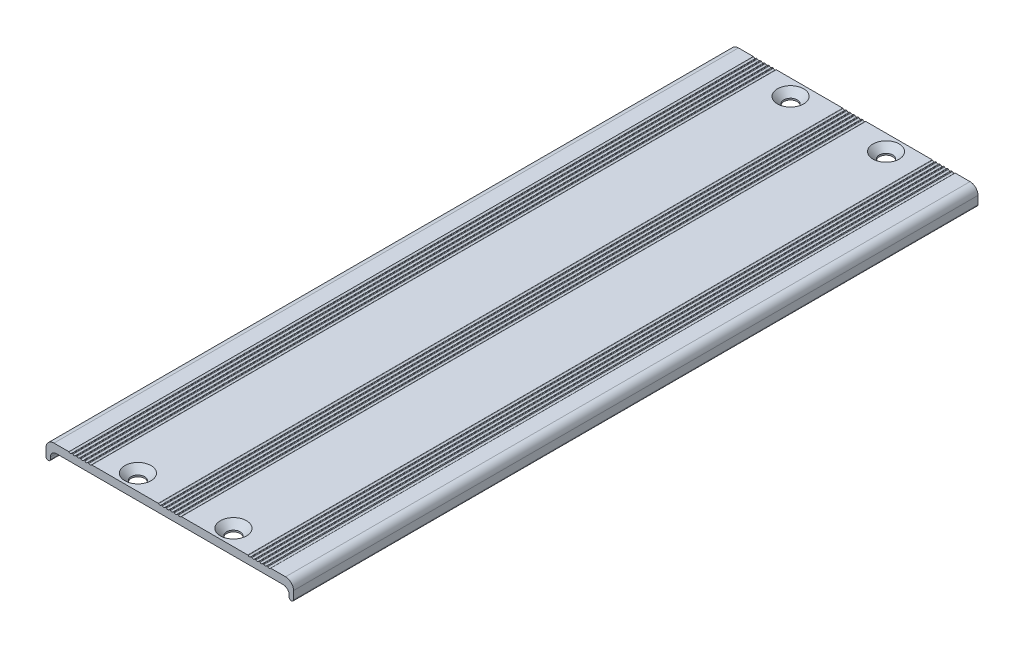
ISO-10303-21;
HEADER;
FILE_DESCRIPTION(('STEP AP214'),'2;1');
FILE_NAME('part.step','',(''),(''),'','','');
FILE_SCHEMA(('AUTOMOTIVE_DESIGN { 1 0 10303 214 1 1 1 1 }'));
ENDSEC;
DATA;
#1=APPLICATION_CONTEXT('core data for automotive mechanical design processes');
#2=APPLICATION_PROTOCOL_DEFINITION('international standard','automotive_design',2000,#1);
#3=PRODUCT_CONTEXT('',#1,'mechanical');
#4=PRODUCT('Part','Part','',(#3));
#5=PRODUCT_RELATED_PRODUCT_CATEGORY('part','',(#4));
#6=PRODUCT_DEFINITION_FORMATION('','',#4);
#7=PRODUCT_DEFINITION_CONTEXT('part definition',#1,'design');
#8=PRODUCT_DEFINITION('design','',#6,#7);
#9=PRODUCT_DEFINITION_SHAPE('','',#8);
#10=(LENGTH_UNIT() NAMED_UNIT(*) SI_UNIT(.MILLI.,.METRE.));
#11=(NAMED_UNIT(*) PLANE_ANGLE_UNIT() SI_UNIT($,.RADIAN.));
#12=(NAMED_UNIT(*) SI_UNIT($,.STERADIAN.) SOLID_ANGLE_UNIT());
#13=UNCERTAINTY_MEASURE_WITH_UNIT(LENGTH_MEASURE(1.E-05),#10,'distance_accuracy_value','');
#14=(GEOMETRIC_REPRESENTATION_CONTEXT(3) GLOBAL_UNCERTAINTY_ASSIGNED_CONTEXT((#13)) GLOBAL_UNIT_ASSIGNED_CONTEXT((#10,
#11,#12)) REPRESENTATION_CONTEXT('',''));
#15=CARTESIAN_POINT('',(0.,0.,0.));
#16=DIRECTION('',(0.,0.,1.));
#17=DIRECTION('',(1.,0.,0.));
#18=AXIS2_PLACEMENT_3D('',#15,#16,#17);
#19=CARTESIAN_POINT('',(1.53322658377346,1.76202509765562,86.));
#20=DIRECTION('',(0.,0.,-1.));
#21=DIRECTION('',(-1.,0.,0.));
#22=AXIS2_PLACEMENT_3D('',#19,#20,#21);
#23=CYLINDRICAL_SURFACE('',#22,0.5);
#24=CARTESIAN_POINT('',(1.53322658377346,1.76202509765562,-86.));
#25=DIRECTION('',(0.,0.,1.));
#26=DIRECTION('',(1.,0.,0.));
#27=AXIS2_PLACEMENT_3D('',#24,#25,#26);
#28=CIRCLE('',#27,0.5);
#29=CARTESIAN_POINT('',(1.03322658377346,1.76202509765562,-86.));
#30=VERTEX_POINT('',#29);
#31=CARTESIAN_POINT('',(1.53322658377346,1.26202509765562,-86.));
#32=VERTEX_POINT('',#31);
#33=EDGE_CURVE('E594',#30,#32,#28,.T.);
#34=ORIENTED_EDGE('',*,*,#33,.T.);
#35=DIRECTION('',(0.,0.,-1.));
#36=VECTOR('',#35,1.);
#37=CARTESIAN_POINT('',(1.53322658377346,1.26202509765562,86.));
#38=LINE('',#37,#36);
#39=CARTESIAN_POINT('',(1.53322658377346,1.26202509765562,86.));
#40=VERTEX_POINT('',#39);
#41=EDGE_CURVE('E11',#40,#32,#38,.T.);
#42=ORIENTED_EDGE('',*,*,#41,.F.);
#43=CARTESIAN_POINT('',(1.53322658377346,1.76202509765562,86.));
#44=DIRECTION('',(0.,0.,1.));
#45=DIRECTION('',(1.,0.,0.));
#46=AXIS2_PLACEMENT_3D('',#43,#44,#45);
#47=CIRCLE('',#46,0.5);
#48=CARTESIAN_POINT('',(1.03322658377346,1.76202509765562,86.));
#49=VERTEX_POINT('',#48);
#50=EDGE_CURVE('E763',#49,#40,#47,.T.);
#51=ORIENTED_EDGE('',*,*,#50,.F.);
#52=DIRECTION('',(0.,0.,-1.));
#53=VECTOR('',#52,1.);
#54=CARTESIAN_POINT('',(1.03322658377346,1.76202509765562,86.));
#55=LINE('',#54,#53);
#56=EDGE_CURVE('E590',#49,#30,#55,.T.);
#57=ORIENTED_EDGE('',*,*,#56,.T.);
#58=EDGE_LOOP('',(#34,#42,#51,#57));
#59=FACE_BOUND('',#58,.T.);
#60=ADVANCED_FACE('F34',(#59),#23,.T.);
#61=CARTESIAN_POINT('',(1.53322658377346,1.26202509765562,86.));
#62=DIRECTION('',(0.,1.,0.));
#63=DIRECTION('',(0.,0.,1.));
#64=AXIS2_PLACEMENT_3D('',#61,#62,#63);
#65=PLANE('',#64);
#66=DIRECTION('',(1.,0.,0.));
#67=VECTOR('',#66,1.);
#68=CARTESIAN_POINT('',(1.53322658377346,1.26202509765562,-86.));
#69=LINE('',#68,#67);
#70=CARTESIAN_POINT('',(1.63322658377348,1.26202509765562,-86.));
#71=VERTEX_POINT('',#70);
#72=EDGE_CURVE('E597',#32,#71,#69,.T.);
#73=ORIENTED_EDGE('',*,*,#72,.T.);
#74=DIRECTION('',(0.,0.,-1.));
#75=VECTOR('',#74,1.);
#76=CARTESIAN_POINT('',(1.63322658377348,1.26202509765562,86.));
#77=LINE('',#76,#75);
#78=CARTESIAN_POINT('',(1.63322658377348,1.26202509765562,86.));
#79=VERTEX_POINT('',#78);
#80=EDGE_CURVE('E43',#79,#71,#77,.T.);
#81=ORIENTED_EDGE('',*,*,#80,.F.);
#82=DIRECTION('',(1.,0.,0.));
#83=VECTOR('',#82,1.);
#84=CARTESIAN_POINT('',(1.53322658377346,1.26202509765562,86.));
#85=LINE('',#84,#83);
#86=EDGE_CURVE('E326',#40,#79,#85,.T.);
#87=ORIENTED_EDGE('',*,*,#86,.F.);
#88=ORIENTED_EDGE('',*,*,#41,.T.);
#89=EDGE_LOOP('',(#73,#81,#87,#88));
#90=FACE_BOUND('',#89,.T.);
#91=ADVANCED_FACE('F1223',(#90),#65,.F.);
#92=CARTESIAN_POINT('',(1.63322658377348,1.76202509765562,86.));
#93=DIRECTION('',(0.,0.,-1.));
#94=DIRECTION('',(-1.,0.,0.));
#95=AXIS2_PLACEMENT_3D('',#92,#93,#94);
#96=CYLINDRICAL_SURFACE('',#95,0.5);
#97=CARTESIAN_POINT('',(1.63322658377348,1.76202509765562,-86.));
#98=DIRECTION('',(0.,0.,1.));
#99=DIRECTION('',(1.,0.,0.));
#100=AXIS2_PLACEMENT_3D('',#97,#98,#99);
#101=CIRCLE('',#100,0.5);
#102=CARTESIAN_POINT('',(2.13322658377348,1.76202509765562,-86.));
#103=VERTEX_POINT('',#102);
#104=EDGE_CURVE('E600',#71,#103,#101,.T.);
#105=ORIENTED_EDGE('',*,*,#104,.T.);
#106=DIRECTION('',(0.,0.,-1.));
#107=VECTOR('',#106,1.);
#108=CARTESIAN_POINT('',(2.13322658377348,1.76202509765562,86.));
#109=LINE('',#108,#107);
#110=CARTESIAN_POINT('',(2.13322658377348,1.76202509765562,86.));
#111=VERTEX_POINT('',#110);
#112=EDGE_CURVE('E1001',#111,#103,#109,.T.);
#113=ORIENTED_EDGE('',*,*,#112,.F.);
#114=CARTESIAN_POINT('',(1.63322658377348,1.76202509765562,86.));
#115=DIRECTION('',(0.,0.,1.));
#116=DIRECTION('',(1.,0.,0.));
#117=AXIS2_PLACEMENT_3D('',#114,#115,#116);
#118=CIRCLE('',#117,0.5);
#119=EDGE_CURVE('E1038',#79,#111,#118,.T.);
#120=ORIENTED_EDGE('',*,*,#119,.F.);
#121=ORIENTED_EDGE('',*,*,#80,.T.);
#122=EDGE_LOOP('',(#105,#113,#120,#121));
#123=FACE_BOUND('',#122,.T.);
#124=ADVANCED_FACE('F1227',(#123),#96,.T.);
#125=CARTESIAN_POINT('',(2.13322658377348,1.76202509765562,86.));
#126=DIRECTION('',(-1.,0.,0.));
#127=DIRECTION('',(0.,0.,1.));
#128=AXIS2_PLACEMENT_3D('',#125,#126,#127);
#129=PLANE('',#128);
#130=DIRECTION('',(0.,1.,0.));
#131=VECTOR('',#130,1.);
#132=CARTESIAN_POINT('',(2.13322658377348,1.76202509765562,-86.));
#133=LINE('',#132,#131);
#134=CARTESIAN_POINT('',(2.13322658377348,2.26202509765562,-86.));
#135=VERTEX_POINT('',#134);
#136=EDGE_CURVE('E602',#103,#135,#133,.T.);
#137=ORIENTED_EDGE('',*,*,#136,.T.);
#138=DIRECTION('',(0.,0.,-1.));
#139=VECTOR('',#138,1.);
#140=CARTESIAN_POINT('',(2.13322658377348,2.26202509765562,86.));
#141=LINE('',#140,#139);
#142=CARTESIAN_POINT('',(2.13322658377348,2.26202509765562,86.));
#143=VERTEX_POINT('',#142);
#144=EDGE_CURVE('E998',#143,#135,#141,.T.);
#145=ORIENTED_EDGE('',*,*,#144,.F.);
#146=DIRECTION('',(0.,1.,0.));
#147=VECTOR('',#146,1.);
#148=CARTESIAN_POINT('',(2.13322658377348,1.76202509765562,86.));
#149=LINE('',#148,#147);
#150=EDGE_CURVE('E1040',#111,#143,#149,.T.);
#151=ORIENTED_EDGE('',*,*,#150,.F.);
#152=ORIENTED_EDGE('',*,*,#112,.T.);
#153=EDGE_LOOP('',(#137,#145,#151,#152));
#154=FACE_BOUND('',#153,.T.);
#155=ADVANCED_FACE('F1231',(#154),#129,.F.);
#156=CARTESIAN_POINT('',(3.63322658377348,2.26202509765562,86.));
#157=DIRECTION('',(0.,0.,-1.));
#158=DIRECTION('',(-1.,0.,0.));
#159=AXIS2_PLACEMENT_3D('',#156,#157,#158);
#160=CYLINDRICAL_SURFACE('',#159,1.5);
#161=CARTESIAN_POINT('',(3.63322658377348,2.26202509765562,-86.));
#162=DIRECTION('',(0.,0.,-1.));
#163=DIRECTION('',(1.,0.,0.));
#164=AXIS2_PLACEMENT_3D('',#161,#162,#163);
#165=CIRCLE('',#164,1.5);
#166=CARTESIAN_POINT('',(3.63322658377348,3.76202509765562,-86.));
#167=VERTEX_POINT('',#166);
#168=EDGE_CURVE('E604',#135,#167,#165,.T.);
#169=ORIENTED_EDGE('',*,*,#168,.T.);
#170=DIRECTION('',(0.,0.,-1.));
#171=VECTOR('',#170,1.);
#172=CARTESIAN_POINT('',(3.63322658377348,3.76202509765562,86.));
#173=LINE('',#172,#171);
#174=CARTESIAN_POINT('',(3.63322658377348,3.76202509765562,86.));
#175=VERTEX_POINT('',#174);
#176=EDGE_CURVE('E995',#175,#167,#173,.T.);
#177=ORIENTED_EDGE('',*,*,#176,.F.);
#178=CARTESIAN_POINT('',(3.63322658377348,2.26202509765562,86.));
#179=DIRECTION('',(0.,0.,-1.));
#180=DIRECTION('',(1.,0.,0.));
#181=AXIS2_PLACEMENT_3D('',#178,#179,#180);
#182=CIRCLE('',#181,1.5);
#183=EDGE_CURVE('E1042',#143,#175,#182,.T.);
#184=ORIENTED_EDGE('',*,*,#183,.F.);
#185=ORIENTED_EDGE('',*,*,#144,.T.);
#186=EDGE_LOOP('',(#169,#177,#184,#185));
#187=FACE_BOUND('',#186,.T.);
#188=ADVANCED_FACE('F1237',(#187),#160,.F.);
#189=CARTESIAN_POINT('',(3.63322658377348,3.76202509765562,86.));
#190=DIRECTION('',(0.,1.,0.));
#191=DIRECTION('',(0.,0.,1.));
#192=AXIS2_PLACEMENT_3D('',#189,#190,#191);
#193=PLANE('',#192);
#194=CARTESIAN_POINT('',(20.1332265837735,3.76202509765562,82.));
#195=DIRECTION('',(0.,1.,0.));
#196=DIRECTION('',(0.,0.,1.));
#197=AXIS2_PLACEMENT_3D('',#194,#195,#196);
#198=CIRCLE('',#197,1.7);
#199=CARTESIAN_POINT('',(20.1332265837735,3.76202509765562,83.7));
#200=VERTEX_POINT('',#199);
#201=EDGE_CURVE('E37',#200,#200,#198,.T.);
#202=ORIENTED_EDGE('',*,*,#201,.T.);
#203=EDGE_LOOP('',(#202));
#204=FACE_BOUND('',#203,.T.);
#205=CARTESIAN_POINT('',(44.1332265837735,3.76202509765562,82.));
#206=DIRECTION('',(0.,1.,0.));
#207=DIRECTION('',(0.,0.,1.));
#208=AXIS2_PLACEMENT_3D('',#205,#206,#207);
#209=CIRCLE('',#208,1.7);
#210=CARTESIAN_POINT('',(44.1332265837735,3.76202509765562,83.7));
#211=VERTEX_POINT('',#210);
#212=EDGE_CURVE('E1013',#211,#211,#209,.T.);
#213=ORIENTED_EDGE('',*,*,#212,.T.);
#214=EDGE_LOOP('',(#213));
#215=FACE_BOUND('',#214,.T.);
#216=CARTESIAN_POINT('',(20.1332265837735,3.76202509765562,-82.));
#217=DIRECTION('',(0.,1.,0.));
#218=DIRECTION('',(0.,0.,1.));
#219=AXIS2_PLACEMENT_3D('',#216,#217,#218);
#220=CIRCLE('',#219,1.7);
#221=CARTESIAN_POINT('',(20.1332265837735,3.76202509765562,-80.3));
#222=VERTEX_POINT('',#221);
#223=EDGE_CURVE('E1009',#222,#222,#220,.T.);
#224=ORIENTED_EDGE('',*,*,#223,.T.);
#225=EDGE_LOOP('',(#224));
#226=FACE_BOUND('',#225,.T.);
#227=CARTESIAN_POINT('',(44.1332265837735,3.76202509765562,-82.));
#228=DIRECTION('',(0.,1.,0.));
#229=DIRECTION('',(0.,0.,1.));
#230=AXIS2_PLACEMENT_3D('',#227,#228,#229);
#231=CIRCLE('',#230,1.7);
#232=CARTESIAN_POINT('',(44.1332265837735,3.76202509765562,-80.3));
#233=VERTEX_POINT('',#232);
#234=EDGE_CURVE('E598',#233,#233,#231,.T.);
#235=ORIENTED_EDGE('',*,*,#234,.T.);
#236=EDGE_LOOP('',(#235));
#237=FACE_BOUND('',#236,.T.);
#238=DIRECTION('',(1.,0.,0.));
#239=VECTOR('',#238,1.);
#240=CARTESIAN_POINT('',(3.63322658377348,3.76202509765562,-86.));
#241=LINE('',#240,#239);
#242=CARTESIAN_POINT('',(60.6332265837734,3.76202509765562,-86.));
#243=VERTEX_POINT('',#242);
#244=EDGE_CURVE('E606',#167,#243,#241,.T.);
#245=ORIENTED_EDGE('',*,*,#244,.T.);
#246=DIRECTION('',(0.,0.,-1.));
#247=VECTOR('',#246,1.);
#248=CARTESIAN_POINT('',(60.6332265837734,3.76202509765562,86.));
#249=LINE('',#248,#247);
#250=CARTESIAN_POINT('',(60.6332265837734,3.76202509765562,86.));
#251=VERTEX_POINT('',#250);
#252=EDGE_CURVE('E992',#251,#243,#249,.T.);
#253=ORIENTED_EDGE('',*,*,#252,.F.);
#254=DIRECTION('',(1.,0.,0.));
#255=VECTOR('',#254,1.);
#256=CARTESIAN_POINT('',(3.63322658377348,3.76202509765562,86.));
#257=LINE('',#256,#255);
#258=EDGE_CURVE('E1044',#175,#251,#257,.T.);
#259=ORIENTED_EDGE('',*,*,#258,.F.);
#260=ORIENTED_EDGE('',*,*,#176,.T.);
#261=EDGE_LOOP('',(#245,#253,#259,#260));
#262=FACE_BOUND('',#261,.T.);
#263=ADVANCED_FACE('F1241',(#204,#215,#226,#237,#262),#193,.F.);
#264=CARTESIAN_POINT('',(60.6332265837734,2.26202509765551,86.));
#265=DIRECTION('',(0.,0.,-1.));
#266=DIRECTION('',(-1.,0.,0.));
#267=AXIS2_PLACEMENT_3D('',#264,#265,#266);
#268=CYLINDRICAL_SURFACE('',#267,1.50000000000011);
#269=CARTESIAN_POINT('',(60.6332265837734,2.26202509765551,-86.));
#270=DIRECTION('',(0.,0.,-1.));
#271=DIRECTION('',(1.,0.,0.));
#272=AXIS2_PLACEMENT_3D('',#269,#270,#271);
#273=CIRCLE('',#272,1.50000000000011);
#274=CARTESIAN_POINT('',(62.1332265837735,2.26202509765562,-86.));
#275=VERTEX_POINT('',#274);
#276=EDGE_CURVE('E608',#243,#275,#273,.T.);
#277=ORIENTED_EDGE('',*,*,#276,.T.);
#278=DIRECTION('',(0.,0.,-1.));
#279=VECTOR('',#278,1.);
#280=CARTESIAN_POINT('',(62.1332265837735,2.26202509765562,86.));
#281=LINE('',#280,#279);
#282=CARTESIAN_POINT('',(62.1332265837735,2.26202509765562,86.));
#283=VERTEX_POINT('',#282);
#284=EDGE_CURVE('E989',#283,#275,#281,.T.);
#285=ORIENTED_EDGE('',*,*,#284,.F.);
#286=CARTESIAN_POINT('',(60.6332265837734,2.26202509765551,86.));
#287=DIRECTION('',(0.,0.,-1.));
#288=DIRECTION('',(1.,0.,0.));
#289=AXIS2_PLACEMENT_3D('',#286,#287,#288);
#290=CIRCLE('',#289,1.50000000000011);
#291=EDGE_CURVE('E1046',#251,#283,#290,.T.);
#292=ORIENTED_EDGE('',*,*,#291,.F.);
#293=ORIENTED_EDGE('',*,*,#252,.T.);
#294=EDGE_LOOP('',(#277,#285,#292,#293));
#295=FACE_BOUND('',#294,.T.);
#296=ADVANCED_FACE('F1245',(#295),#268,.F.);
#297=CARTESIAN_POINT('',(62.1332265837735,1.76202509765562,86.));
#298=DIRECTION('',(1.,0.,0.));
#299=DIRECTION('',(0.,0.,-1.));
#300=AXIS2_PLACEMENT_3D('',#297,#298,#299);
#301=PLANE('',#300);
#302=DIRECTION('',(0.,-1.,0.));
#303=VECTOR('',#302,1.);
#304=CARTESIAN_POINT('',(62.1332265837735,1.76202509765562,-86.));
#305=LINE('',#304,#303);
#306=CARTESIAN_POINT('',(62.1332265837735,1.76202509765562,-86.));
#307=VERTEX_POINT('',#306);
#308=EDGE_CURVE('E610',#275,#307,#305,.T.);
#309=ORIENTED_EDGE('',*,*,#308,.T.);
#310=DIRECTION('',(0.,0.,-1.));
#311=VECTOR('',#310,1.);
#312=CARTESIAN_POINT('',(62.1332265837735,1.76202509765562,86.));
#313=LINE('',#312,#311);
#314=CARTESIAN_POINT('',(62.1332265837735,1.76202509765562,86.));
#315=VERTEX_POINT('',#314);
#316=EDGE_CURVE('E986',#315,#307,#313,.T.);
#317=ORIENTED_EDGE('',*,*,#316,.F.);
#318=DIRECTION('',(0.,-1.,0.));
#319=VECTOR('',#318,1.);
#320=CARTESIAN_POINT('',(62.1332265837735,1.76202509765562,86.));
#321=LINE('',#320,#319);
#322=EDGE_CURVE('E1048',#283,#315,#321,.T.);
#323=ORIENTED_EDGE('',*,*,#322,.F.);
#324=ORIENTED_EDGE('',*,*,#284,.T.);
#325=EDGE_LOOP('',(#309,#317,#323,#324));
#326=FACE_BOUND('',#325,.T.);
#327=ADVANCED_FACE('F1249',(#326),#301,.F.);
#328=CARTESIAN_POINT('',(62.6332265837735,1.76202509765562,86.));
#329=DIRECTION('',(0.,0.,-1.));
#330=DIRECTION('',(-1.,0.,0.));
#331=AXIS2_PLACEMENT_3D('',#328,#329,#330);
#332=CYLINDRICAL_SURFACE('',#331,0.499999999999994);
#333=CARTESIAN_POINT('',(62.6332265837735,1.76202509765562,-86.));
#334=DIRECTION('',(0.,0.,1.));
#335=DIRECTION('',(1.,0.,0.));
#336=AXIS2_PLACEMENT_3D('',#333,#334,#335);
#337=CIRCLE('',#336,0.499999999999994);
#338=CARTESIAN_POINT('',(62.6332265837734,1.26202509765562,-86.));
#339=VERTEX_POINT('',#338);
#340=EDGE_CURVE('E612',#307,#339,#337,.T.);
#341=ORIENTED_EDGE('',*,*,#340,.T.);
#342=DIRECTION('',(0.,0.,-1.));
#343=VECTOR('',#342,1.);
#344=CARTESIAN_POINT('',(62.6332265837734,1.26202509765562,86.));
#345=LINE('',#344,#343);
#346=CARTESIAN_POINT('',(62.6332265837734,1.26202509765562,86.));
#347=VERTEX_POINT('',#346);
#348=EDGE_CURVE('E983',#347,#339,#345,.T.);
#349=ORIENTED_EDGE('',*,*,#348,.F.);
#350=CARTESIAN_POINT('',(62.6332265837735,1.76202509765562,86.));
#351=DIRECTION('',(0.,0.,1.));
#352=DIRECTION('',(1.,0.,0.));
#353=AXIS2_PLACEMENT_3D('',#350,#351,#352);
#354=CIRCLE('',#353,0.499999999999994);
#355=EDGE_CURVE('E1050',#315,#347,#354,.T.);
#356=ORIENTED_EDGE('',*,*,#355,.F.);
#357=ORIENTED_EDGE('',*,*,#316,.T.);
#358=EDGE_LOOP('',(#341,#349,#356,#357));
#359=FACE_BOUND('',#358,.T.);
#360=ADVANCED_FACE('F1253',(#359),#332,.T.);
#361=CARTESIAN_POINT('',(62.6332265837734,1.26202509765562,86.));
#362=DIRECTION('',(0.,1.,0.));
#363=DIRECTION('',(0.,0.,1.));
#364=AXIS2_PLACEMENT_3D('',#361,#362,#363);
#365=PLANE('',#364);
#366=DIRECTION('',(1.,0.,0.));
#367=VECTOR('',#366,1.);
#368=CARTESIAN_POINT('',(62.6332265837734,1.26202509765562,-86.));
#369=LINE('',#368,#367);
#370=CARTESIAN_POINT('',(62.7332265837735,1.26202509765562,-86.));
#371=VERTEX_POINT('',#370);
#372=EDGE_CURVE('E614',#339,#371,#369,.T.);
#373=ORIENTED_EDGE('',*,*,#372,.T.);
#374=DIRECTION('',(0.,0.,-1.));
#375=VECTOR('',#374,1.);
#376=CARTESIAN_POINT('',(62.7332265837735,1.26202509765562,86.));
#377=LINE('',#376,#375);
#378=CARTESIAN_POINT('',(62.7332265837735,1.26202509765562,86.));
#379=VERTEX_POINT('',#378);
#380=EDGE_CURVE('E980',#379,#371,#377,.T.);
#381=ORIENTED_EDGE('',*,*,#380,.F.);
#382=DIRECTION('',(1.,0.,0.));
#383=VECTOR('',#382,1.);
#384=CARTESIAN_POINT('',(62.6332265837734,1.26202509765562,86.));
#385=LINE('',#384,#383);
#386=EDGE_CURVE('E1052',#347,#379,#385,.T.);
#387=ORIENTED_EDGE('',*,*,#386,.F.);
#388=ORIENTED_EDGE('',*,*,#348,.T.);
#389=EDGE_LOOP('',(#373,#381,#387,#388));
#390=FACE_BOUND('',#389,.T.);
#391=ADVANCED_FACE('F1257',(#390),#365,.F.);
#392=CARTESIAN_POINT('',(62.7332265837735,1.76202509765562,86.));
#393=DIRECTION('',(0.,0.,-1.));
#394=DIRECTION('',(-1.,0.,0.));
#395=AXIS2_PLACEMENT_3D('',#392,#393,#394);
#396=CYLINDRICAL_SURFACE('',#395,0.5);
#397=CARTESIAN_POINT('',(62.7332265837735,1.76202509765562,-86.));
#398=DIRECTION('',(0.,0.,1.));
#399=DIRECTION('',(1.,0.,0.));
#400=AXIS2_PLACEMENT_3D('',#397,#398,#399);
#401=CIRCLE('',#400,0.5);
#402=CARTESIAN_POINT('',(63.2332265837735,1.76202509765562,-86.));
#403=VERTEX_POINT('',#402);
#404=EDGE_CURVE('E616',#371,#403,#401,.T.);
#405=ORIENTED_EDGE('',*,*,#404,.T.);
#406=DIRECTION('',(0.,0.,-1.));
#407=VECTOR('',#406,1.);
#408=CARTESIAN_POINT('',(63.2332265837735,1.76202509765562,86.));
#409=LINE('',#408,#407);
#410=CARTESIAN_POINT('',(63.2332265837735,1.76202509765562,86.));
#411=VERTEX_POINT('',#410);
#412=EDGE_CURVE('E977',#411,#403,#409,.T.);
#413=ORIENTED_EDGE('',*,*,#412,.F.);
#414=CARTESIAN_POINT('',(62.7332265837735,1.76202509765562,86.));
#415=DIRECTION('',(0.,0.,1.));
#416=DIRECTION('',(1.,0.,0.));
#417=AXIS2_PLACEMENT_3D('',#414,#415,#416);
#418=CIRCLE('',#417,0.5);
#419=EDGE_CURVE('E1054',#379,#411,#418,.T.);
#420=ORIENTED_EDGE('',*,*,#419,.F.);
#421=ORIENTED_EDGE('',*,*,#380,.T.);
#422=EDGE_LOOP('',(#405,#413,#420,#421));
#423=FACE_BOUND('',#422,.T.);
#424=ADVANCED_FACE('F1261',(#423),#396,.T.);
#425=CARTESIAN_POINT('',(63.2332265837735,3.76202509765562,86.));
#426=DIRECTION('',(-1.,0.,0.));
#427=DIRECTION('',(0.,0.,1.));
#428=AXIS2_PLACEMENT_3D('',#425,#426,#427);
#429=PLANE('',#428);
#430=DIRECTION('',(0.,1.,0.));
#431=VECTOR('',#430,1.);
#432=CARTESIAN_POINT('',(63.2332265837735,3.76202509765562,-86.));
#433=LINE('',#432,#431);
#434=CARTESIAN_POINT('',(63.2332265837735,3.76202509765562,-86.));
#435=VERTEX_POINT('',#434);
#436=EDGE_CURVE('E618',#403,#435,#433,.T.);
#437=ORIENTED_EDGE('',*,*,#436,.T.);
#438=DIRECTION('',(0.,0.,-1.));
#439=VECTOR('',#438,1.);
#440=CARTESIAN_POINT('',(63.2332265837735,3.76202509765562,86.));
#441=LINE('',#440,#439);
#442=CARTESIAN_POINT('',(63.2332265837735,3.76202509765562,86.));
#443=VERTEX_POINT('',#442);
#444=EDGE_CURVE('E974',#443,#435,#441,.T.);
#445=ORIENTED_EDGE('',*,*,#444,.F.);
#446=DIRECTION('',(0.,1.,0.));
#447=VECTOR('',#446,1.);
#448=CARTESIAN_POINT('',(63.2332265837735,3.76202509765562,86.));
#449=LINE('',#448,#447);
#450=EDGE_CURVE('E1056',#411,#443,#449,.T.);
#451=ORIENTED_EDGE('',*,*,#450,.F.);
#452=ORIENTED_EDGE('',*,*,#412,.T.);
#453=EDGE_LOOP('',(#437,#445,#451,#452));
#454=FACE_BOUND('',#453,.T.);
#455=ADVANCED_FACE('F1265',(#454),#429,.F.);
#456=CARTESIAN_POINT('',(61.2332265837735,3.76202509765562,86.));
#457=DIRECTION('',(0.,0.,-1.));
#458=DIRECTION('',(-1.,0.,0.));
#459=AXIS2_PLACEMENT_3D('',#456,#457,#458);
#460=CYLINDRICAL_SURFACE('',#459,2.);
#461=CARTESIAN_POINT('',(61.2332265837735,3.76202509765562,-86.));
#462=DIRECTION('',(0.,0.,1.));
#463=DIRECTION('',(1.,0.,0.));
#464=AXIS2_PLACEMENT_3D('',#461,#462,#463);
#465=CIRCLE('',#464,2.);
#466=CARTESIAN_POINT('',(61.2332265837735,5.76202509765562,-86.));
#467=VERTEX_POINT('',#466);
#468=EDGE_CURVE('E620',#435,#467,#465,.T.);
#469=ORIENTED_EDGE('',*,*,#468,.T.);
#470=DIRECTION('',(0.,0.,-1.));
#471=VECTOR('',#470,1.);
#472=CARTESIAN_POINT('',(61.2332265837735,5.76202509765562,86.));
#473=LINE('',#472,#471);
#474=CARTESIAN_POINT('',(61.2332265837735,5.76202509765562,86.));
#475=VERTEX_POINT('',#474);
#476=EDGE_CURVE('E971',#475,#467,#473,.T.);
#477=ORIENTED_EDGE('',*,*,#476,.F.);
#478=CARTESIAN_POINT('',(61.2332265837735,3.76202509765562,86.));
#479=DIRECTION('',(0.,0.,1.));
#480=DIRECTION('',(1.,0.,0.));
#481=AXIS2_PLACEMENT_3D('',#478,#479,#480);
#482=CIRCLE('',#481,2.);
#483=EDGE_CURVE('E1058',#443,#475,#482,.T.);
#484=ORIENTED_EDGE('',*,*,#483,.F.);
#485=ORIENTED_EDGE('',*,*,#444,.T.);
#486=EDGE_LOOP('',(#469,#477,#484,#485));
#487=FACE_BOUND('',#486,.T.);
#488=ADVANCED_FACE('F1269',(#487),#460,.T.);
#489=CARTESIAN_POINT('',(57.4796367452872,5.76202509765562,86.));
#490=DIRECTION('',(0.,-1.,0.));
#491=DIRECTION('',(0.,0.,-1.));
#492=AXIS2_PLACEMENT_3D('',#489,#490,#491);
#493=PLANE('',#492);
#494=DIRECTION('',(-1.,0.,0.));
#495=VECTOR('',#494,1.);
#496=CARTESIAN_POINT('',(57.4796367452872,5.76202509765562,-86.));
#497=LINE('',#496,#495);
#498=CARTESIAN_POINT('',(57.4796367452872,5.76202509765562,-86.));
#499=VERTEX_POINT('',#498);
#500=EDGE_CURVE('E622',#467,#499,#497,.T.);
#501=ORIENTED_EDGE('',*,*,#500,.T.);
#502=DIRECTION('',(0.,0.,-1.));
#503=VECTOR('',#502,1.);
#504=CARTESIAN_POINT('',(57.4796367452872,5.76202509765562,86.));
#505=LINE('',#504,#503);
#506=CARTESIAN_POINT('',(57.4796367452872,5.76202509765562,86.));
#507=VERTEX_POINT('',#506);
#508=EDGE_CURVE('E968',#507,#499,#505,.T.);
#509=ORIENTED_EDGE('',*,*,#508,.F.);
#510=DIRECTION('',(-1.,0.,0.));
#511=VECTOR('',#510,1.);
#512=CARTESIAN_POINT('',(57.4796367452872,5.76202509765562,86.));
#513=LINE('',#512,#511);
#514=EDGE_CURVE('E1060',#475,#507,#513,.T.);
#515=ORIENTED_EDGE('',*,*,#514,.F.);
#516=ORIENTED_EDGE('',*,*,#476,.T.);
#517=EDGE_LOOP('',(#501,#509,#515,#516));
#518=FACE_BOUND('',#517,.T.);
#519=ADVANCED_FACE('F1273',(#518),#493,.F.);
#520=CARTESIAN_POINT('',(57.1332265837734,5.96202509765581,86.));
#521=DIRECTION('',(0.,0.,-1.));
#522=DIRECTION('',(-1.,0.,0.));
#523=AXIS2_PLACEMENT_3D('',#520,#521,#522);
#524=CYLINDRICAL_SURFACE('',#523,0.400000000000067);
#525=CARTESIAN_POINT('',(57.1332265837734,5.96202509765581,-86.));
#526=DIRECTION('',(0.,0.,-1.));
#527=DIRECTION('',(1.,0.,0.));
#528=AXIS2_PLACEMENT_3D('',#525,#526,#527);
#529=CIRCLE('',#528,0.400000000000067);
#530=CARTESIAN_POINT('',(56.7868164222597,5.76202509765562,-86.));
#531=VERTEX_POINT('',#530);
#532=EDGE_CURVE('E624',#499,#531,#529,.T.);
#533=ORIENTED_EDGE('',*,*,#532,.T.);
#534=DIRECTION('',(0.,0.,-1.));
#535=VECTOR('',#534,1.);
#536=CARTESIAN_POINT('',(56.7868164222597,5.76202509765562,86.));
#537=LINE('',#536,#535);
#538=CARTESIAN_POINT('',(56.7868164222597,5.76202509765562,86.));
#539=VERTEX_POINT('',#538);
#540=EDGE_CURVE('E965',#539,#531,#537,.T.);
#541=ORIENTED_EDGE('',*,*,#540,.F.);
#542=CARTESIAN_POINT('',(57.1332265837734,5.96202509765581,86.));
#543=DIRECTION('',(0.,0.,-1.));
#544=DIRECTION('',(1.,0.,0.));
#545=AXIS2_PLACEMENT_3D('',#542,#543,#544);
#546=CIRCLE('',#545,0.400000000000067);
#547=EDGE_CURVE('E1062',#507,#539,#546,.T.);
#548=ORIENTED_EDGE('',*,*,#547,.F.);
#549=ORIENTED_EDGE('',*,*,#508,.T.);
#550=EDGE_LOOP('',(#533,#541,#548,#549));
#551=FACE_BOUND('',#550,.T.);
#552=ADVANCED_FACE('F1277',(#551),#524,.F.);
#553=CARTESIAN_POINT('',(56.7868164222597,5.76202509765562,86.));
#554=DIRECTION('',(0.,-1.,0.));
#555=DIRECTION('',(0.,0.,-1.));
#556=AXIS2_PLACEMENT_3D('',#553,#554,#555);
#557=PLANE('',#556);
#558=DIRECTION('',(-1.,0.,0.));
#559=VECTOR('',#558,1.);
#560=CARTESIAN_POINT('',(56.7868164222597,5.76202509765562,-86.));
#561=LINE('',#560,#559);
#562=CARTESIAN_POINT('',(56.543104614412,5.76202509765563,-86.));
#563=VERTEX_POINT('',#562);
#564=EDGE_CURVE('E626',#531,#563,#561,.T.);
#565=ORIENTED_EDGE('',*,*,#564,.T.);
#566=DIRECTION('',(0.,0.,-1.));
#567=VECTOR('',#566,1.);
#568=CARTESIAN_POINT('',(56.543104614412,5.76202509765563,86.));
#569=LINE('',#568,#567);
#570=CARTESIAN_POINT('',(56.543104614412,5.76202509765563,86.));
#571=VERTEX_POINT('',#570);
#572=EDGE_CURVE('E962',#571,#563,#569,.T.);
#573=ORIENTED_EDGE('',*,*,#572,.F.);
#574=DIRECTION('',(-1.,0.,0.));
#575=VECTOR('',#574,1.);
#576=CARTESIAN_POINT('',(56.7868164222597,5.76202509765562,86.));
#577=LINE('',#576,#575);
#578=EDGE_CURVE('E1064',#539,#571,#577,.T.);
#579=ORIENTED_EDGE('',*,*,#578,.F.);
#580=ORIENTED_EDGE('',*,*,#540,.T.);
#581=EDGE_LOOP('',(#565,#573,#579,#580));
#582=FACE_BOUND('',#581,.T.);
#583=ADVANCED_FACE('F1281',(#582),#557,.F.);
#584=CARTESIAN_POINT('',(56.543104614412,5.64202509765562,86.));
#585=DIRECTION('',(0.,0.,-1.));
#586=DIRECTION('',(-1.,0.,0.));
#587=AXIS2_PLACEMENT_3D('',#584,#585,#586);
#588=CYLINDRICAL_SURFACE('',#587,0.120000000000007);
#589=CARTESIAN_POINT('',(56.543104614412,5.64202509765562,-86.));
#590=DIRECTION('',(0.,0.,1.));
#591=DIRECTION('',(1.,0.,0.));
#592=AXIS2_PLACEMENT_3D('',#589,#590,#591);
#593=CIRCLE('',#592,0.120000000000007);
#594=CARTESIAN_POINT('',(56.4485173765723,5.71587125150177,-86.));
#595=VERTEX_POINT('',#594);
#596=EDGE_CURVE('E628',#563,#595,#593,.T.);
#597=ORIENTED_EDGE('',*,*,#596,.T.);
#598=DIRECTION('',(0.,0.,-1.));
#599=VECTOR('',#598,1.);
#600=CARTESIAN_POINT('',(56.4485173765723,5.71587125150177,86.));
#601=LINE('',#600,#599);
#602=CARTESIAN_POINT('',(56.4485173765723,5.71587125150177,86.));
#603=VERTEX_POINT('',#602);
#604=EDGE_CURVE('E959',#603,#595,#601,.T.);
#605=ORIENTED_EDGE('',*,*,#604,.F.);
#606=CARTESIAN_POINT('',(56.543104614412,5.64202509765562,86.));
#607=DIRECTION('',(0.,0.,1.));
#608=DIRECTION('',(1.,0.,0.));
#609=AXIS2_PLACEMENT_3D('',#606,#607,#608);
#610=CIRCLE('',#609,0.120000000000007);
#611=EDGE_CURVE('E1066',#571,#603,#610,.T.);
#612=ORIENTED_EDGE('',*,*,#611,.F.);
#613=ORIENTED_EDGE('',*,*,#572,.T.);
#614=EDGE_LOOP('',(#597,#605,#612,#613));
#615=FACE_BOUND('',#614,.T.);
#616=ADVANCED_FACE('F1285',(#615),#588,.T.);
#617=CARTESIAN_POINT('',(56.1332265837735,5.96202509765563,86.));
#618=DIRECTION('',(0.,0.,-1.));
#619=DIRECTION('',(-1.,0.,0.));
#620=AXIS2_PLACEMENT_3D('',#617,#618,#619);
#621=CYLINDRICAL_SURFACE('',#620,0.400000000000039);
#622=CARTESIAN_POINT('',(56.1332265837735,5.96202509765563,-86.));
#623=DIRECTION('',(0.,0.,-1.));
#624=DIRECTION('',(1.,0.,0.));
#625=AXIS2_PLACEMENT_3D('',#622,#623,#624);
#626=CIRCLE('',#625,0.400000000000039);
#627=CARTESIAN_POINT('',(55.8179357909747,5.71587125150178,-86.));
#628=VERTEX_POINT('',#627);
#629=EDGE_CURVE('E630',#595,#628,#626,.T.);
#630=ORIENTED_EDGE('',*,*,#629,.T.);
#631=DIRECTION('',(0.,0.,-1.));
#632=VECTOR('',#631,1.);
#633=CARTESIAN_POINT('',(55.8179357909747,5.71587125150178,86.));
#634=LINE('',#633,#632);
#635=CARTESIAN_POINT('',(55.8179357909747,5.71587125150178,86.));
#636=VERTEX_POINT('',#635);
#637=EDGE_CURVE('E956',#636,#628,#634,.T.);
#638=ORIENTED_EDGE('',*,*,#637,.F.);
#639=CARTESIAN_POINT('',(56.1332265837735,5.96202509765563,86.));
#640=DIRECTION('',(0.,0.,-1.));
#641=DIRECTION('',(1.,0.,0.));
#642=AXIS2_PLACEMENT_3D('',#639,#640,#641);
#643=CIRCLE('',#642,0.400000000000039);
#644=EDGE_CURVE('E1068',#603,#636,#643,.T.);
#645=ORIENTED_EDGE('',*,*,#644,.F.);
#646=ORIENTED_EDGE('',*,*,#604,.T.);
#647=EDGE_LOOP('',(#630,#638,#645,#646));
#648=FACE_BOUND('',#647,.T.);
#649=ADVANCED_FACE('F1289',(#648),#621,.F.);
#650=CARTESIAN_POINT('',(55.7233485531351,5.64202509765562,86.));
#651=DIRECTION('',(0.,0.,-1.));
#652=DIRECTION('',(-1.,0.,0.));
#653=AXIS2_PLACEMENT_3D('',#650,#651,#652);
#654=CYLINDRICAL_SURFACE('',#653,0.120000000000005);
#655=CARTESIAN_POINT('',(55.7233485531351,5.64202509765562,-86.));
#656=DIRECTION('',(0.,0.,1.));
#657=DIRECTION('',(1.,0.,0.));
#658=AXIS2_PLACEMENT_3D('',#655,#656,#657);
#659=CIRCLE('',#658,0.120000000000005);
#660=CARTESIAN_POINT('',(55.7233485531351,5.76202509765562,-86.));
#661=VERTEX_POINT('',#660);
#662=EDGE_CURVE('E632',#628,#661,#659,.T.);
#663=ORIENTED_EDGE('',*,*,#662,.T.);
#664=DIRECTION('',(0.,0.,-1.));
#665=VECTOR('',#664,1.);
#666=CARTESIAN_POINT('',(55.7233485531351,5.76202509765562,86.));
#667=LINE('',#666,#665);
#668=CARTESIAN_POINT('',(55.7233485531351,5.76202509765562,86.));
#669=VERTEX_POINT('',#668);
#670=EDGE_CURVE('E953',#669,#661,#667,.T.);
#671=ORIENTED_EDGE('',*,*,#670,.F.);
#672=CARTESIAN_POINT('',(55.7233485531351,5.64202509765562,86.));
#673=DIRECTION('',(0.,0.,1.));
#674=DIRECTION('',(1.,0.,0.));
#675=AXIS2_PLACEMENT_3D('',#672,#673,#674);
#676=CIRCLE('',#675,0.120000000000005);
#677=EDGE_CURVE('E1070',#636,#669,#676,.T.);
#678=ORIENTED_EDGE('',*,*,#677,.F.);
#679=ORIENTED_EDGE('',*,*,#637,.T.);
#680=EDGE_LOOP('',(#663,#671,#678,#679));
#681=FACE_BOUND('',#680,.T.);
#682=ADVANCED_FACE('F1293',(#681),#654,.T.);
#683=CARTESIAN_POINT('',(55.7233485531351,5.76202509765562,86.));
#684=DIRECTION('',(0.,-1.,0.));
#685=DIRECTION('',(0.,0.,-1.));
#686=AXIS2_PLACEMENT_3D('',#683,#684,#685);
#687=PLANE('',#686);
#688=DIRECTION('',(-1.,0.,0.));
#689=VECTOR('',#688,1.);
#690=CARTESIAN_POINT('',(55.7233485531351,5.76202509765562,-86.));
#691=LINE('',#690,#689);
#692=CARTESIAN_POINT('',(55.543104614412,5.76202509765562,-86.));
#693=VERTEX_POINT('',#692);
#694=EDGE_CURVE('E634',#661,#693,#691,.T.);
#695=ORIENTED_EDGE('',*,*,#694,.T.);
#696=DIRECTION('',(0.,0.,-1.));
#697=VECTOR('',#696,1.);
#698=CARTESIAN_POINT('',(55.543104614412,5.76202509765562,86.));
#699=LINE('',#698,#697);
#700=CARTESIAN_POINT('',(55.543104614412,5.76202509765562,86.));
#701=VERTEX_POINT('',#700);
#702=EDGE_CURVE('E950',#701,#693,#699,.T.);
#703=ORIENTED_EDGE('',*,*,#702,.F.);
#704=DIRECTION('',(-1.,0.,0.));
#705=VECTOR('',#704,1.);
#706=CARTESIAN_POINT('',(55.7233485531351,5.76202509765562,86.));
#707=LINE('',#706,#705);
#708=EDGE_CURVE('E1072',#669,#701,#707,.T.);
#709=ORIENTED_EDGE('',*,*,#708,.F.);
#710=ORIENTED_EDGE('',*,*,#670,.T.);
#711=EDGE_LOOP('',(#695,#703,#709,#710));
#712=FACE_BOUND('',#711,.T.);
#713=ADVANCED_FACE('F1297',(#712),#687,.F.);
#714=CARTESIAN_POINT('',(55.543104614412,5.64202509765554,86.));
#715=DIRECTION('',(0.,0.,-1.));
#716=DIRECTION('',(-1.,0.,0.));
#717=AXIS2_PLACEMENT_3D('',#714,#715,#716);
#718=CYLINDRICAL_SURFACE('',#717,0.12000000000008);
#719=CARTESIAN_POINT('',(55.543104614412,5.64202509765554,-86.));
#720=DIRECTION('',(0.,0.,1.));
#721=DIRECTION('',(1.,0.,0.));
#722=AXIS2_PLACEMENT_3D('',#719,#720,#721);
#723=CIRCLE('',#722,0.12000000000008);
#724=CARTESIAN_POINT('',(55.4485173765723,5.7158712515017,-86.));
#725=VERTEX_POINT('',#724);
#726=EDGE_CURVE('E636',#693,#725,#723,.T.);
#727=ORIENTED_EDGE('',*,*,#726,.T.);
#728=DIRECTION('',(0.,0.,-1.));
#729=VECTOR('',#728,1.);
#730=CARTESIAN_POINT('',(55.4485173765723,5.7158712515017,86.));
#731=LINE('',#730,#729);
#732=CARTESIAN_POINT('',(55.4485173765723,5.7158712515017,86.));
#733=VERTEX_POINT('',#732);
#734=EDGE_CURVE('E947',#733,#725,#731,.T.);
#735=ORIENTED_EDGE('',*,*,#734,.F.);
#736=CARTESIAN_POINT('',(55.543104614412,5.64202509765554,86.));
#737=DIRECTION('',(0.,0.,1.));
#738=DIRECTION('',(1.,0.,0.));
#739=AXIS2_PLACEMENT_3D('',#736,#737,#738);
#740=CIRCLE('',#739,0.12000000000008);
#741=EDGE_CURVE('E1074',#701,#733,#740,.T.);
#742=ORIENTED_EDGE('',*,*,#741,.F.);
#743=ORIENTED_EDGE('',*,*,#702,.T.);
#744=EDGE_LOOP('',(#727,#735,#742,#743));
#745=FACE_BOUND('',#744,.T.);
#746=ADVANCED_FACE('F1301',(#745),#718,.T.);
#747=CARTESIAN_POINT('',(55.1332265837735,5.96202509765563,86.));
#748=DIRECTION('',(0.,0.,-1.));
#749=DIRECTION('',(-1.,0.,0.));
#750=AXIS2_PLACEMENT_3D('',#747,#748,#749);
#751=CYLINDRICAL_SURFACE('',#750,0.400000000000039);
#752=CARTESIAN_POINT('',(55.1332265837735,5.96202509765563,-86.));
#753=DIRECTION('',(0.,0.,-1.));
#754=DIRECTION('',(1.,0.,0.));
#755=AXIS2_PLACEMENT_3D('',#752,#753,#754);
#756=CIRCLE('',#755,0.400000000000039);
#757=CARTESIAN_POINT('',(54.8179357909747,5.71587125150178,-86.));
#758=VERTEX_POINT('',#757);
#759=EDGE_CURVE('E638',#725,#758,#756,.T.);
#760=ORIENTED_EDGE('',*,*,#759,.T.);
#761=DIRECTION('',(0.,0.,-1.));
#762=VECTOR('',#761,1.);
#763=CARTESIAN_POINT('',(54.8179357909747,5.71587125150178,86.));
#764=LINE('',#763,#762);
#765=CARTESIAN_POINT('',(54.8179357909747,5.71587125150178,86.));
#766=VERTEX_POINT('',#765);
#767=EDGE_CURVE('E944',#766,#758,#764,.T.);
#768=ORIENTED_EDGE('',*,*,#767,.F.);
#769=CARTESIAN_POINT('',(55.1332265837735,5.96202509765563,86.));
#770=DIRECTION('',(0.,0.,-1.));
#771=DIRECTION('',(1.,0.,0.));
#772=AXIS2_PLACEMENT_3D('',#769,#770,#771);
#773=CIRCLE('',#772,0.400000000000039);
#774=EDGE_CURVE('E1076',#733,#766,#773,.T.);
#775=ORIENTED_EDGE('',*,*,#774,.F.);
#776=ORIENTED_EDGE('',*,*,#734,.T.);
#777=EDGE_LOOP('',(#760,#768,#775,#776));
#778=FACE_BOUND('',#777,.T.);
#779=ADVANCED_FACE('F1305',(#778),#751,.F.);
#780=CARTESIAN_POINT('',(54.7233485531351,5.64202509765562,86.));
#781=DIRECTION('',(0.,0.,-1.));
#782=DIRECTION('',(-1.,0.,0.));
#783=AXIS2_PLACEMENT_3D('',#780,#781,#782);
#784=CYLINDRICAL_SURFACE('',#783,0.120000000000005);
#785=CARTESIAN_POINT('',(54.7233485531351,5.64202509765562,-86.));
#786=DIRECTION('',(0.,0.,1.));
#787=DIRECTION('',(1.,0.,0.));
#788=AXIS2_PLACEMENT_3D('',#785,#786,#787);
#789=CIRCLE('',#788,0.120000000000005);
#790=CARTESIAN_POINT('',(54.7233485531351,5.76202509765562,-86.));
#791=VERTEX_POINT('',#790);
#792=EDGE_CURVE('E640',#758,#791,#789,.T.);
#793=ORIENTED_EDGE('',*,*,#792,.T.);
#794=DIRECTION('',(0.,0.,-1.));
#795=VECTOR('',#794,1.);
#796=CARTESIAN_POINT('',(54.7233485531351,5.76202509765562,86.));
#797=LINE('',#796,#795);
#798=CARTESIAN_POINT('',(54.7233485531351,5.76202509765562,86.));
#799=VERTEX_POINT('',#798);
#800=EDGE_CURVE('E941',#799,#791,#797,.T.);
#801=ORIENTED_EDGE('',*,*,#800,.F.);
#802=CARTESIAN_POINT('',(54.7233485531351,5.64202509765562,86.));
#803=DIRECTION('',(0.,0.,1.));
#804=DIRECTION('',(1.,0.,0.));
#805=AXIS2_PLACEMENT_3D('',#802,#803,#804);
#806=CIRCLE('',#805,0.120000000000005);
#807=EDGE_CURVE('E1078',#766,#799,#806,.T.);
#808=ORIENTED_EDGE('',*,*,#807,.F.);
#809=ORIENTED_EDGE('',*,*,#767,.T.);
#810=EDGE_LOOP('',(#793,#801,#808,#809));
#811=FACE_BOUND('',#810,.T.);
#812=ADVANCED_FACE('F1309',(#811),#784,.T.);
#813=CARTESIAN_POINT('',(54.7233485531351,5.76202509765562,86.));
#814=DIRECTION('',(0.,-1.,0.));
#815=DIRECTION('',(0.,0.,-1.));
#816=AXIS2_PLACEMENT_3D('',#813,#814,#815);
#817=PLANE('',#816);
#818=DIRECTION('',(-1.,0.,0.));
#819=VECTOR('',#818,1.);
#820=CARTESIAN_POINT('',(54.7233485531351,5.76202509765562,-86.));
#821=LINE('',#820,#819);
#822=CARTESIAN_POINT('',(54.543104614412,5.76202509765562,-86.));
#823=VERTEX_POINT('',#822);
#824=EDGE_CURVE('E642',#791,#823,#821,.T.);
#825=ORIENTED_EDGE('',*,*,#824,.T.);
#826=DIRECTION('',(0.,0.,-1.));
#827=VECTOR('',#826,1.);
#828=CARTESIAN_POINT('',(54.543104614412,5.76202509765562,86.));
#829=LINE('',#828,#827);
#830=CARTESIAN_POINT('',(54.543104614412,5.76202509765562,86.));
#831=VERTEX_POINT('',#830);
#832=EDGE_CURVE('E938',#831,#823,#829,.T.);
#833=ORIENTED_EDGE('',*,*,#832,.F.);
#834=DIRECTION('',(-1.,0.,0.));
#835=VECTOR('',#834,1.);
#836=CARTESIAN_POINT('',(54.7233485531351,5.76202509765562,86.));
#837=LINE('',#836,#835);
#838=EDGE_CURVE('E1080',#799,#831,#837,.T.);
#839=ORIENTED_EDGE('',*,*,#838,.F.);
#840=ORIENTED_EDGE('',*,*,#800,.T.);
#841=EDGE_LOOP('',(#825,#833,#839,#840));
#842=FACE_BOUND('',#841,.T.);
#843=ADVANCED_FACE('F1313',(#842),#817,.F.);
#844=CARTESIAN_POINT('',(54.543104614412,5.64202509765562,86.));
#845=DIRECTION('',(0.,0.,-1.));
#846=DIRECTION('',(-1.,0.,0.));
#847=AXIS2_PLACEMENT_3D('',#844,#845,#846);
#848=CYLINDRICAL_SURFACE('',#847,0.120000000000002);
#849=CARTESIAN_POINT('',(54.543104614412,5.64202509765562,-86.));
#850=DIRECTION('',(0.,0.,1.));
#851=DIRECTION('',(1.,0.,0.));
#852=AXIS2_PLACEMENT_3D('',#849,#850,#851);
#853=CIRCLE('',#852,0.120000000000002);
#854=CARTESIAN_POINT('',(54.4485173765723,5.71587125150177,-86.));
#855=VERTEX_POINT('',#854);
#856=EDGE_CURVE('E644',#823,#855,#853,.T.);
#857=ORIENTED_EDGE('',*,*,#856,.T.);
#858=DIRECTION('',(0.,0.,-1.));
#859=VECTOR('',#858,1.);
#860=CARTESIAN_POINT('',(54.4485173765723,5.71587125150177,86.));
#861=LINE('',#860,#859);
#862=CARTESIAN_POINT('',(54.4485173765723,5.71587125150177,86.));
#863=VERTEX_POINT('',#862);
#864=EDGE_CURVE('E935',#863,#855,#861,.T.);
#865=ORIENTED_EDGE('',*,*,#864,.F.);
#866=CARTESIAN_POINT('',(54.543104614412,5.64202509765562,86.));
#867=DIRECTION('',(0.,0.,1.));
#868=DIRECTION('',(1.,0.,0.));
#869=AXIS2_PLACEMENT_3D('',#866,#867,#868);
#870=CIRCLE('',#869,0.120000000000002);
#871=EDGE_CURVE('E1082',#831,#863,#870,.T.);
#872=ORIENTED_EDGE('',*,*,#871,.F.);
#873=ORIENTED_EDGE('',*,*,#832,.T.);
#874=EDGE_LOOP('',(#857,#865,#872,#873));
#875=FACE_BOUND('',#874,.T.);
#876=ADVANCED_FACE('F1317',(#875),#848,.T.);
#877=CARTESIAN_POINT('',(54.1332265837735,5.96202509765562,86.));
#878=DIRECTION('',(0.,0.,-1.));
#879=DIRECTION('',(-1.,0.,0.));
#880=AXIS2_PLACEMENT_3D('',#877,#878,#879);
#881=CYLINDRICAL_SURFACE('',#880,0.400000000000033);
#882=CARTESIAN_POINT('',(54.1332265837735,5.96202509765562,-86.));
#883=DIRECTION('',(0.,0.,-1.));
#884=DIRECTION('',(1.,0.,0.));
#885=AXIS2_PLACEMENT_3D('',#882,#883,#884);
#886=CIRCLE('',#885,0.400000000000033);
#887=CARTESIAN_POINT('',(53.8179357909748,5.71587125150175,-86.));
#888=VERTEX_POINT('',#887);
#889=EDGE_CURVE('E646',#855,#888,#886,.T.);
#890=ORIENTED_EDGE('',*,*,#889,.T.);
#891=DIRECTION('',(0.,0.,-1.));
#892=VECTOR('',#891,1.);
#893=CARTESIAN_POINT('',(53.8179357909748,5.71587125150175,86.));
#894=LINE('',#893,#892);
#895=CARTESIAN_POINT('',(53.8179357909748,5.71587125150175,86.));
#896=VERTEX_POINT('',#895);
#897=EDGE_CURVE('E932',#896,#888,#894,.T.);
#898=ORIENTED_EDGE('',*,*,#897,.F.);
#899=CARTESIAN_POINT('',(54.1332265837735,5.96202509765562,86.));
#900=DIRECTION('',(0.,0.,-1.));
#901=DIRECTION('',(1.,0.,0.));
#902=AXIS2_PLACEMENT_3D('',#899,#900,#901);
#903=CIRCLE('',#902,0.400000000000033);
#904=EDGE_CURVE('E1084',#863,#896,#903,.T.);
#905=ORIENTED_EDGE('',*,*,#904,.F.);
#906=ORIENTED_EDGE('',*,*,#864,.T.);
#907=EDGE_LOOP('',(#890,#898,#905,#906));
#908=FACE_BOUND('',#907,.T.);
#909=ADVANCED_FACE('F1321',(#908),#881,.F.);
#910=CARTESIAN_POINT('',(53.7233485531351,5.64202509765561,86.));
#911=DIRECTION('',(0.,0.,-1.));
#912=DIRECTION('',(-1.,0.,0.));
#913=AXIS2_PLACEMENT_3D('',#910,#911,#912);
#914=CYLINDRICAL_SURFACE('',#913,0.12000000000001);
#915=CARTESIAN_POINT('',(53.7233485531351,5.64202509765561,-86.));
#916=DIRECTION('',(0.,0.,1.));
#917=DIRECTION('',(1.,0.,0.));
#918=AXIS2_PLACEMENT_3D('',#915,#916,#917);
#919=CIRCLE('',#918,0.12000000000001);
#920=CARTESIAN_POINT('',(53.7233485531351,5.76202509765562,-86.));
#921=VERTEX_POINT('',#920);
#922=EDGE_CURVE('E648',#888,#921,#919,.T.);
#923=ORIENTED_EDGE('',*,*,#922,.T.);
#924=DIRECTION('',(0.,0.,-1.));
#925=VECTOR('',#924,1.);
#926=CARTESIAN_POINT('',(53.7233485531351,5.76202509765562,86.));
#927=LINE('',#926,#925);
#928=CARTESIAN_POINT('',(53.7233485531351,5.76202509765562,86.));
#929=VERTEX_POINT('',#928);
#930=EDGE_CURVE('E929',#929,#921,#927,.T.);
#931=ORIENTED_EDGE('',*,*,#930,.F.);
#932=CARTESIAN_POINT('',(53.7233485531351,5.64202509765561,86.));
#933=DIRECTION('',(0.,0.,1.));
#934=DIRECTION('',(1.,0.,0.));
#935=AXIS2_PLACEMENT_3D('',#932,#933,#934);
#936=CIRCLE('',#935,0.12000000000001);
#937=EDGE_CURVE('E1086',#896,#929,#936,.T.);
#938=ORIENTED_EDGE('',*,*,#937,.F.);
#939=ORIENTED_EDGE('',*,*,#897,.T.);
#940=EDGE_LOOP('',(#923,#931,#938,#939));
#941=FACE_BOUND('',#940,.T.);
#942=ADVANCED_FACE('F1325',(#941),#914,.T.);
#943=CARTESIAN_POINT('',(53.7233485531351,5.76202509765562,86.));
#944=DIRECTION('',(0.,-1.,0.));
#945=DIRECTION('',(0.,0.,-1.));
#946=AXIS2_PLACEMENT_3D('',#943,#944,#945);
#947=PLANE('',#946);
#948=DIRECTION('',(-1.,0.,0.));
#949=VECTOR('',#948,1.);
#950=CARTESIAN_POINT('',(53.7233485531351,5.76202509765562,-86.));
#951=LINE('',#950,#949);
#952=CARTESIAN_POINT('',(53.543104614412,5.76202509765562,-86.));
#953=VERTEX_POINT('',#952);
#954=EDGE_CURVE('E650',#921,#953,#951,.T.);
#955=ORIENTED_EDGE('',*,*,#954,.T.);
#956=DIRECTION('',(0.,0.,-1.));
#957=VECTOR('',#956,1.);
#958=CARTESIAN_POINT('',(53.543104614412,5.76202509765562,86.));
#959=LINE('',#958,#957);
#960=CARTESIAN_POINT('',(53.543104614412,5.76202509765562,86.));
#961=VERTEX_POINT('',#960);
#962=EDGE_CURVE('E926',#961,#953,#959,.T.);
#963=ORIENTED_EDGE('',*,*,#962,.F.);
#964=DIRECTION('',(-1.,0.,0.));
#965=VECTOR('',#964,1.);
#966=CARTESIAN_POINT('',(53.7233485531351,5.76202509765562,86.));
#967=LINE('',#966,#965);
#968=EDGE_CURVE('E1088',#929,#961,#967,.T.);
#969=ORIENTED_EDGE('',*,*,#968,.F.);
#970=ORIENTED_EDGE('',*,*,#930,.T.);
#971=EDGE_LOOP('',(#955,#963,#969,#970));
#972=FACE_BOUND('',#971,.T.);
#973=ADVANCED_FACE('F1329',(#972),#947,.F.);
#974=CARTESIAN_POINT('',(53.543104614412,5.64202509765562,86.));
#975=DIRECTION('',(0.,0.,-1.));
#976=DIRECTION('',(-1.,0.,0.));
#977=AXIS2_PLACEMENT_3D('',#974,#975,#976);
#978=CYLINDRICAL_SURFACE('',#977,0.120000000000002);
#979=CARTESIAN_POINT('',(53.543104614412,5.64202509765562,-86.));
#980=DIRECTION('',(0.,0.,1.));
#981=DIRECTION('',(1.,0.,0.));
#982=AXIS2_PLACEMENT_3D('',#979,#980,#981);
#983=CIRCLE('',#982,0.120000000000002);
#984=CARTESIAN_POINT('',(53.4485173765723,5.71587125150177,-86.));
#985=VERTEX_POINT('',#984);
#986=EDGE_CURVE('E652',#953,#985,#983,.T.);
#987=ORIENTED_EDGE('',*,*,#986,.T.);
#988=DIRECTION('',(0.,0.,-1.));
#989=VECTOR('',#988,1.);
#990=CARTESIAN_POINT('',(53.4485173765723,5.71587125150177,86.));
#991=LINE('',#990,#989);
#992=CARTESIAN_POINT('',(53.4485173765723,5.71587125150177,86.));
#993=VERTEX_POINT('',#992);
#994=EDGE_CURVE('E923',#993,#985,#991,.T.);
#995=ORIENTED_EDGE('',*,*,#994,.F.);
#996=CARTESIAN_POINT('',(53.543104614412,5.64202509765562,86.));
#997=DIRECTION('',(0.,0.,1.));
#998=DIRECTION('',(1.,0.,0.));
#999=AXIS2_PLACEMENT_3D('',#996,#997,#998);
#1000=CIRCLE('',#999,0.120000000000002);
#1001=EDGE_CURVE('E1090',#961,#993,#1000,.T.);
#1002=ORIENTED_EDGE('',*,*,#1001,.F.);
#1003=ORIENTED_EDGE('',*,*,#962,.T.);
#1004=EDGE_LOOP('',(#987,#995,#1002,#1003));
#1005=FACE_BOUND('',#1004,.T.);
#1006=ADVANCED_FACE('F1333',(#1005),#978,.T.);
#1007=CARTESIAN_POINT('',(53.1332265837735,5.96202509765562,86.));
#1008=DIRECTION('',(0.,0.,-1.));
#1009=DIRECTION('',(-1.,0.,0.));
#1010=AXIS2_PLACEMENT_3D('',#1007,#1008,#1009);
#1011=CYLINDRICAL_SURFACE('',#1010,0.400000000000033);
#1012=CARTESIAN_POINT('',(53.1332265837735,5.96202509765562,-86.));
#1013=DIRECTION('',(0.,0.,-1.));
#1014=DIRECTION('',(1.,0.,0.));
#1015=AXIS2_PLACEMENT_3D('',#1012,#1013,#1014);
#1016=CIRCLE('',#1015,0.400000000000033);
#1017=CARTESIAN_POINT('',(52.8179357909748,5.71587125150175,-86.));
#1018=VERTEX_POINT('',#1017);
#1019=EDGE_CURVE('E654',#985,#1018,#1016,.T.);
#1020=ORIENTED_EDGE('',*,*,#1019,.T.);
#1021=DIRECTION('',(0.,0.,-1.));
#1022=VECTOR('',#1021,1.);
#1023=CARTESIAN_POINT('',(52.8179357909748,5.71587125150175,86.));
#1024=LINE('',#1023,#1022);
#1025=CARTESIAN_POINT('',(52.8179357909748,5.71587125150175,86.));
#1026=VERTEX_POINT('',#1025);
#1027=EDGE_CURVE('E920',#1026,#1018,#1024,.T.);
#1028=ORIENTED_EDGE('',*,*,#1027,.F.);
#1029=CARTESIAN_POINT('',(53.1332265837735,5.96202509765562,86.));
#1030=DIRECTION('',(0.,0.,-1.));
#1031=DIRECTION('',(1.,0.,0.));
#1032=AXIS2_PLACEMENT_3D('',#1029,#1030,#1031);
#1033=CIRCLE('',#1032,0.400000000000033);
#1034=EDGE_CURVE('E1092',#993,#1026,#1033,.T.);
#1035=ORIENTED_EDGE('',*,*,#1034,.F.);
#1036=ORIENTED_EDGE('',*,*,#994,.T.);
#1037=EDGE_LOOP('',(#1020,#1028,#1035,#1036));
#1038=FACE_BOUND('',#1037,.T.);
#1039=ADVANCED_FACE('F1337',(#1038),#1011,.F.);
#1040=CARTESIAN_POINT('',(52.7233485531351,5.64202509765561,86.));
#1041=DIRECTION('',(0.,0.,-1.));
#1042=DIRECTION('',(-1.,0.,0.));
#1043=AXIS2_PLACEMENT_3D('',#1040,#1041,#1042);
#1044=CYLINDRICAL_SURFACE('',#1043,0.12000000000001);
#1045=CARTESIAN_POINT('',(52.7233485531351,5.64202509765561,-86.));
#1046=DIRECTION('',(0.,0.,1.));
#1047=DIRECTION('',(1.,0.,0.));
#1048=AXIS2_PLACEMENT_3D('',#1045,#1046,#1047);
#1049=CIRCLE('',#1048,0.12000000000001);
#1050=CARTESIAN_POINT('',(52.7233485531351,5.76202509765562,-86.));
#1051=VERTEX_POINT('',#1050);
#1052=EDGE_CURVE('E656',#1018,#1051,#1049,.T.);
#1053=ORIENTED_EDGE('',*,*,#1052,.T.);
#1054=DIRECTION('',(0.,0.,-1.));
#1055=VECTOR('',#1054,1.);
#1056=CARTESIAN_POINT('',(52.7233485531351,5.76202509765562,86.));
#1057=LINE('',#1056,#1055);
#1058=CARTESIAN_POINT('',(52.7233485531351,5.76202509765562,86.));
#1059=VERTEX_POINT('',#1058);
#1060=EDGE_CURVE('E917',#1059,#1051,#1057,.T.);
#1061=ORIENTED_EDGE('',*,*,#1060,.F.);
#1062=CARTESIAN_POINT('',(52.7233485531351,5.64202509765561,86.));
#1063=DIRECTION('',(0.,0.,1.));
#1064=DIRECTION('',(1.,0.,0.));
#1065=AXIS2_PLACEMENT_3D('',#1062,#1063,#1064);
#1066=CIRCLE('',#1065,0.12000000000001);
#1067=EDGE_CURVE('E1094',#1026,#1059,#1066,.T.);
#1068=ORIENTED_EDGE('',*,*,#1067,.F.);
#1069=ORIENTED_EDGE('',*,*,#1027,.T.);
#1070=EDGE_LOOP('',(#1053,#1061,#1068,#1069));
#1071=FACE_BOUND('',#1070,.T.);
#1072=ADVANCED_FACE('F1341',(#1071),#1044,.T.);
#1073=CARTESIAN_POINT('',(52.7233485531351,5.76202509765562,86.));
#1074=DIRECTION('',(0.,-1.,0.));
#1075=DIRECTION('',(0.,0.,-1.));
#1076=AXIS2_PLACEMENT_3D('',#1073,#1074,#1075);
#1077=PLANE('',#1076);
#1078=DIRECTION('',(-1.,0.,0.));
#1079=VECTOR('',#1078,1.);
#1080=CARTESIAN_POINT('',(52.7233485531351,5.76202509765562,-86.));
#1081=LINE('',#1080,#1079);
#1082=CARTESIAN_POINT('',(52.543104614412,5.76202509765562,-86.));
#1083=VERTEX_POINT('',#1082);
#1084=EDGE_CURVE('E658',#1051,#1083,#1081,.T.);
#1085=ORIENTED_EDGE('',*,*,#1084,.T.);
#1086=DIRECTION('',(0.,0.,-1.));
#1087=VECTOR('',#1086,1.);
#1088=CARTESIAN_POINT('',(52.543104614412,5.76202509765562,86.));
#1089=LINE('',#1088,#1087);
#1090=CARTESIAN_POINT('',(52.543104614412,5.76202509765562,86.));
#1091=VERTEX_POINT('',#1090);
#1092=EDGE_CURVE('E914',#1091,#1083,#1089,.T.);
#1093=ORIENTED_EDGE('',*,*,#1092,.F.);
#1094=DIRECTION('',(-1.,0.,0.));
#1095=VECTOR('',#1094,1.);
#1096=CARTESIAN_POINT('',(52.7233485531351,5.76202509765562,86.));
#1097=LINE('',#1096,#1095);
#1098=EDGE_CURVE('E1096',#1059,#1091,#1097,.T.);
#1099=ORIENTED_EDGE('',*,*,#1098,.F.);
#1100=ORIENTED_EDGE('',*,*,#1060,.T.);
#1101=EDGE_LOOP('',(#1085,#1093,#1099,#1100));
#1102=FACE_BOUND('',#1101,.T.);
#1103=ADVANCED_FACE('F1345',(#1102),#1077,.F.);
#1104=CARTESIAN_POINT('',(52.543104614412,5.64202509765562,86.));
#1105=DIRECTION('',(0.,0.,-1.));
#1106=DIRECTION('',(-1.,0.,0.));
#1107=AXIS2_PLACEMENT_3D('',#1104,#1105,#1106);
#1108=CYLINDRICAL_SURFACE('',#1107,0.120000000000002);
#1109=CARTESIAN_POINT('',(52.543104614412,5.64202509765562,-86.));
#1110=DIRECTION('',(0.,0.,1.));
#1111=DIRECTION('',(1.,0.,0.));
#1112=AXIS2_PLACEMENT_3D('',#1109,#1110,#1111);
#1113=CIRCLE('',#1112,0.120000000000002);
#1114=CARTESIAN_POINT('',(52.4485173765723,5.71587125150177,-86.));
#1115=VERTEX_POINT('',#1114);
#1116=EDGE_CURVE('E660',#1083,#1115,#1113,.T.);
#1117=ORIENTED_EDGE('',*,*,#1116,.T.);
#1118=DIRECTION('',(0.,0.,-1.));
#1119=VECTOR('',#1118,1.);
#1120=CARTESIAN_POINT('',(52.4485173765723,5.71587125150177,86.));
#1121=LINE('',#1120,#1119);
#1122=CARTESIAN_POINT('',(52.4485173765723,5.71587125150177,86.));
#1123=VERTEX_POINT('',#1122);
#1124=EDGE_CURVE('E911',#1123,#1115,#1121,.T.);
#1125=ORIENTED_EDGE('',*,*,#1124,.F.);
#1126=CARTESIAN_POINT('',(52.543104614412,5.64202509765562,86.));
#1127=DIRECTION('',(0.,0.,1.));
#1128=DIRECTION('',(1.,0.,0.));
#1129=AXIS2_PLACEMENT_3D('',#1126,#1127,#1128);
#1130=CIRCLE('',#1129,0.120000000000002);
#1131=EDGE_CURVE('E1098',#1091,#1123,#1130,.T.);
#1132=ORIENTED_EDGE('',*,*,#1131,.F.);
#1133=ORIENTED_EDGE('',*,*,#1092,.T.);
#1134=EDGE_LOOP('',(#1117,#1125,#1132,#1133));
#1135=FACE_BOUND('',#1134,.T.);
#1136=ADVANCED_FACE('F1349',(#1135),#1108,.T.);
#1137=CARTESIAN_POINT('',(52.1332265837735,5.96202509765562,86.));
#1138=DIRECTION('',(0.,0.,-1.));
#1139=DIRECTION('',(-1.,0.,0.));
#1140=AXIS2_PLACEMENT_3D('',#1137,#1138,#1139);
#1141=CYLINDRICAL_SURFACE('',#1140,0.400000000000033);
#1142=CARTESIAN_POINT('',(52.1332265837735,5.96202509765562,-86.));
#1143=DIRECTION('',(0.,0.,-1.));
#1144=DIRECTION('',(1.,0.,0.));
#1145=AXIS2_PLACEMENT_3D('',#1142,#1143,#1144);
#1146=CIRCLE('',#1145,0.400000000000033);
#1147=CARTESIAN_POINT('',(51.8179357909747,5.71587125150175,-86.));
#1148=VERTEX_POINT('',#1147);
#1149=EDGE_CURVE('E662',#1115,#1148,#1146,.T.);
#1150=ORIENTED_EDGE('',*,*,#1149,.T.);
#1151=DIRECTION('',(0.,0.,-1.));
#1152=VECTOR('',#1151,1.);
#1153=CARTESIAN_POINT('',(51.8179357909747,5.71587125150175,86.));
#1154=LINE('',#1153,#1152);
#1155=CARTESIAN_POINT('',(51.8179357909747,5.71587125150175,86.));
#1156=VERTEX_POINT('',#1155);
#1157=EDGE_CURVE('E908',#1156,#1148,#1154,.T.);
#1158=ORIENTED_EDGE('',*,*,#1157,.F.);
#1159=CARTESIAN_POINT('',(52.1332265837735,5.96202509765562,86.));
#1160=DIRECTION('',(0.,0.,-1.));
#1161=DIRECTION('',(1.,0.,0.));
#1162=AXIS2_PLACEMENT_3D('',#1159,#1160,#1161);
#1163=CIRCLE('',#1162,0.400000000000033);
#1164=EDGE_CURVE('E1100',#1123,#1156,#1163,.T.);
#1165=ORIENTED_EDGE('',*,*,#1164,.F.);
#1166=ORIENTED_EDGE('',*,*,#1124,.T.);
#1167=EDGE_LOOP('',(#1150,#1158,#1165,#1166));
#1168=FACE_BOUND('',#1167,.T.);
#1169=ADVANCED_FACE('F1353',(#1168),#1141,.F.);
#1170=CARTESIAN_POINT('',(51.7233485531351,5.64202509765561,86.));
#1171=DIRECTION('',(0.,0.,-1.));
#1172=DIRECTION('',(-1.,0.,0.));
#1173=AXIS2_PLACEMENT_3D('',#1170,#1171,#1172);
#1174=CYLINDRICAL_SURFACE('',#1173,0.12000000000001);
#1175=CARTESIAN_POINT('',(51.7233485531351,5.64202509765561,-86.));
#1176=DIRECTION('',(0.,0.,1.));
#1177=DIRECTION('',(1.,0.,0.));
#1178=AXIS2_PLACEMENT_3D('',#1175,#1176,#1177);
#1179=CIRCLE('',#1178,0.12000000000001);
#1180=CARTESIAN_POINT('',(51.7233485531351,5.76202509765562,-86.));
#1181=VERTEX_POINT('',#1180);
#1182=EDGE_CURVE('E664',#1148,#1181,#1179,.T.);
#1183=ORIENTED_EDGE('',*,*,#1182,.T.);
#1184=DIRECTION('',(0.,0.,-1.));
#1185=VECTOR('',#1184,1.);
#1186=CARTESIAN_POINT('',(51.7233485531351,5.76202509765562,86.));
#1187=LINE('',#1186,#1185);
#1188=CARTESIAN_POINT('',(51.7233485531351,5.76202509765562,86.));
#1189=VERTEX_POINT('',#1188);
#1190=EDGE_CURVE('E905',#1189,#1181,#1187,.T.);
#1191=ORIENTED_EDGE('',*,*,#1190,.F.);
#1192=CARTESIAN_POINT('',(51.7233485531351,5.64202509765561,86.));
#1193=DIRECTION('',(0.,0.,1.));
#1194=DIRECTION('',(1.,0.,0.));
#1195=AXIS2_PLACEMENT_3D('',#1192,#1193,#1194);
#1196=CIRCLE('',#1195,0.12000000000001);
#1197=EDGE_CURVE('E1102',#1156,#1189,#1196,.T.);
#1198=ORIENTED_EDGE('',*,*,#1197,.F.);
#1199=ORIENTED_EDGE('',*,*,#1157,.T.);
#1200=EDGE_LOOP('',(#1183,#1191,#1198,#1199));
#1201=FACE_BOUND('',#1200,.T.);
#1202=ADVANCED_FACE('F1357',(#1201),#1174,.T.);
#1203=CARTESIAN_POINT('',(35.0431046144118,5.76202509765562,86.));
#1204=DIRECTION('',(0.,-1.,0.));
#1205=DIRECTION('',(0.,0.,-1.));
#1206=AXIS2_PLACEMENT_3D('',#1203,#1204,#1205);
#1207=PLANE('',#1206);
#1208=CARTESIAN_POINT('',(44.1332265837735,5.76202509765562,82.));
#1209=DIRECTION('',(0.,1.,0.));
#1210=DIRECTION('',(0.,0.,1.));
#1211=AXIS2_PLACEMENT_3D('',#1208,#1209,#1210);
#1212=CIRCLE('',#1211,3.3);
#1213=CARTESIAN_POINT('',(44.1332265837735,5.76202509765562,85.3));
#1214=VERTEX_POINT('',#1213);
#1215=EDGE_CURVE('E1022',#1214,#1214,#1212,.T.);
#1216=ORIENTED_EDGE('',*,*,#1215,.F.);
#1217=EDGE_LOOP('',(#1216));
#1218=FACE_BOUND('',#1217,.T.);
#1219=CARTESIAN_POINT('',(44.1332265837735,5.76202509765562,-82.));
#1220=DIRECTION('',(0.,1.,0.));
#1221=DIRECTION('',(0.,0.,1.));
#1222=AXIS2_PLACEMENT_3D('',#1219,#1220,#1221);
#1223=CIRCLE('',#1222,3.3);
#1224=CARTESIAN_POINT('',(44.1332265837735,5.76202509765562,-78.7));
#1225=VERTEX_POINT('',#1224);
#1226=EDGE_CURVE('E1011',#1225,#1225,#1223,.T.);
#1227=ORIENTED_EDGE('',*,*,#1226,.F.);
#1228=EDGE_LOOP('',(#1227));
#1229=FACE_BOUND('',#1228,.T.);
#1230=DIRECTION('',(-1.,0.,0.));
#1231=VECTOR('',#1230,1.);
#1232=CARTESIAN_POINT('',(35.0431046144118,5.76202509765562,-86.));
#1233=LINE('',#1232,#1231);
#1234=CARTESIAN_POINT('',(35.0431046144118,5.76202509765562,-86.));
#1235=VERTEX_POINT('',#1234);
#1236=EDGE_CURVE('E666',#1181,#1235,#1233,.T.);
#1237=ORIENTED_EDGE('',*,*,#1236,.T.);
#1238=DIRECTION('',(0.,0.,-1.));
#1239=VECTOR('',#1238,1.);
#1240=CARTESIAN_POINT('',(35.0431046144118,5.76202509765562,86.));
#1241=LINE('',#1240,#1239);
#1242=CARTESIAN_POINT('',(35.0431046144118,5.76202509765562,86.));
#1243=VERTEX_POINT('',#1242);
#1244=EDGE_CURVE('E902',#1243,#1235,#1241,.T.);
#1245=ORIENTED_EDGE('',*,*,#1244,.F.);
#1246=DIRECTION('',(-1.,0.,0.));
#1247=VECTOR('',#1246,1.);
#1248=CARTESIAN_POINT('',(35.0431046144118,5.76202509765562,86.));
#1249=LINE('',#1248,#1247);
#1250=EDGE_CURVE('E1104',#1189,#1243,#1249,.T.);
#1251=ORIENTED_EDGE('',*,*,#1250,.F.);
#1252=ORIENTED_EDGE('',*,*,#1190,.T.);
#1253=EDGE_LOOP('',(#1237,#1245,#1251,#1252));
#1254=FACE_BOUND('',#1253,.T.);
#1255=ADVANCED_FACE('F1361',(#1218,#1229,#1254),#1207,.F.);
#1256=CARTESIAN_POINT('',(35.0431046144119,5.64202509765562,86.));
#1257=DIRECTION('',(0.,0.,-1.));
#1258=DIRECTION('',(-1.,0.,0.));
#1259=AXIS2_PLACEMENT_3D('',#1256,#1257,#1258);
#1260=CYLINDRICAL_SURFACE('',#1259,0.120000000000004);
#1261=CARTESIAN_POINT('',(35.0431046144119,5.64202509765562,-86.));
#1262=DIRECTION('',(0.,0.,1.));
#1263=DIRECTION('',(1.,0.,0.));
#1264=AXIS2_PLACEMENT_3D('',#1261,#1262,#1263);
#1265=CIRCLE('',#1264,0.120000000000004);
#1266=CARTESIAN_POINT('',(34.9485173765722,5.71587125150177,-86.));
#1267=VERTEX_POINT('',#1266);
#1268=EDGE_CURVE('E668',#1235,#1267,#1265,.T.);
#1269=ORIENTED_EDGE('',*,*,#1268,.T.);
#1270=DIRECTION('',(0.,0.,-1.));
#1271=VECTOR('',#1270,1.);
#1272=CARTESIAN_POINT('',(34.9485173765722,5.71587125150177,86.));
#1273=LINE('',#1272,#1271);
#1274=CARTESIAN_POINT('',(34.9485173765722,5.71587125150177,86.));
#1275=VERTEX_POINT('',#1274);
#1276=EDGE_CURVE('E899',#1275,#1267,#1273,.T.);
#1277=ORIENTED_EDGE('',*,*,#1276,.F.);
#1278=CARTESIAN_POINT('',(35.0431046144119,5.64202509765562,86.));
#1279=DIRECTION('',(0.,0.,1.));
#1280=DIRECTION('',(1.,0.,0.));
#1281=AXIS2_PLACEMENT_3D('',#1278,#1279,#1280);
#1282=CIRCLE('',#1281,0.120000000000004);
#1283=EDGE_CURVE('E1106',#1243,#1275,#1282,.T.);
#1284=ORIENTED_EDGE('',*,*,#1283,.F.);
#1285=ORIENTED_EDGE('',*,*,#1244,.T.);
#1286=EDGE_LOOP('',(#1269,#1277,#1284,#1285));
#1287=FACE_BOUND('',#1286,.T.);
#1288=ADVANCED_FACE('F1365',(#1287),#1260,.T.);
#1289=CARTESIAN_POINT('',(34.6332265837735,5.9620250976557,86.));
#1290=DIRECTION('',(0.,0.,-1.));
#1291=DIRECTION('',(-1.,0.,0.));
#1292=AXIS2_PLACEMENT_3D('',#1289,#1290,#1291);
#1293=CYLINDRICAL_SURFACE('',#1292,0.400000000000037);
#1294=CARTESIAN_POINT('',(34.6332265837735,5.9620250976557,-86.));
#1295=DIRECTION('',(0.,0.,-1.));
#1296=DIRECTION('',(1.,0.,0.));
#1297=AXIS2_PLACEMENT_3D('',#1294,#1295,#1296);
#1298=CIRCLE('',#1297,0.400000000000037);
#1299=CARTESIAN_POINT('',(34.3179357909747,5.71587125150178,-86.));
#1300=VERTEX_POINT('',#1299);
#1301=EDGE_CURVE('E670',#1267,#1300,#1298,.T.);
#1302=ORIENTED_EDGE('',*,*,#1301,.T.);
#1303=DIRECTION('',(0.,0.,-1.));
#1304=VECTOR('',#1303,1.);
#1305=CARTESIAN_POINT('',(34.3179357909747,5.71587125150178,86.));
#1306=LINE('',#1305,#1304);
#1307=CARTESIAN_POINT('',(34.3179357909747,5.71587125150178,86.));
#1308=VERTEX_POINT('',#1307);
#1309=EDGE_CURVE('E896',#1308,#1300,#1306,.T.);
#1310=ORIENTED_EDGE('',*,*,#1309,.F.);
#1311=CARTESIAN_POINT('',(34.6332265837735,5.9620250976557,86.));
#1312=DIRECTION('',(0.,0.,-1.));
#1313=DIRECTION('',(1.,0.,0.));
#1314=AXIS2_PLACEMENT_3D('',#1311,#1312,#1313);
#1315=CIRCLE('',#1314,0.400000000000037);
#1316=EDGE_CURVE('E1108',#1275,#1308,#1315,.T.);
#1317=ORIENTED_EDGE('',*,*,#1316,.F.);
#1318=ORIENTED_EDGE('',*,*,#1276,.T.);
#1319=EDGE_LOOP('',(#1302,#1310,#1317,#1318));
#1320=FACE_BOUND('',#1319,.T.);
#1321=ADVANCED_FACE('F1369',(#1320),#1293,.F.);
#1322=CARTESIAN_POINT('',(34.2233485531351,5.64202509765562,86.));
#1323=DIRECTION('',(0.,0.,-1.));
#1324=DIRECTION('',(-1.,0.,0.));
#1325=AXIS2_PLACEMENT_3D('',#1322,#1323,#1324);
#1326=CYLINDRICAL_SURFACE('',#1325,0.120000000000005);
#1327=CARTESIAN_POINT('',(34.2233485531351,5.64202509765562,-86.));
#1328=DIRECTION('',(0.,0.,1.));
#1329=DIRECTION('',(1.,0.,0.));
#1330=AXIS2_PLACEMENT_3D('',#1327,#1328,#1329);
#1331=CIRCLE('',#1330,0.120000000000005);
#1332=CARTESIAN_POINT('',(34.2233485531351,5.76202509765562,-86.));
#1333=VERTEX_POINT('',#1332);
#1334=EDGE_CURVE('E672',#1300,#1333,#1331,.T.);
#1335=ORIENTED_EDGE('',*,*,#1334,.T.);
#1336=DIRECTION('',(0.,0.,-1.));
#1337=VECTOR('',#1336,1.);
#1338=CARTESIAN_POINT('',(34.2233485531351,5.76202509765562,86.));
#1339=LINE('',#1338,#1337);
#1340=CARTESIAN_POINT('',(34.2233485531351,5.76202509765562,86.));
#1341=VERTEX_POINT('',#1340);
#1342=EDGE_CURVE('E893',#1341,#1333,#1339,.T.);
#1343=ORIENTED_EDGE('',*,*,#1342,.F.);
#1344=CARTESIAN_POINT('',(34.2233485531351,5.64202509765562,86.));
#1345=DIRECTION('',(0.,0.,1.));
#1346=DIRECTION('',(1.,0.,0.));
#1347=AXIS2_PLACEMENT_3D('',#1344,#1345,#1346);
#1348=CIRCLE('',#1347,0.120000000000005);
#1349=EDGE_CURVE('E1110',#1308,#1341,#1348,.T.);
#1350=ORIENTED_EDGE('',*,*,#1349,.F.);
#1351=ORIENTED_EDGE('',*,*,#1309,.T.);
#1352=EDGE_LOOP('',(#1335,#1343,#1350,#1351));
#1353=FACE_BOUND('',#1352,.T.);
#1354=ADVANCED_FACE('F1373',(#1353),#1326,.T.);
#1355=CARTESIAN_POINT('',(34.2233485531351,5.76202509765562,86.));
#1356=DIRECTION('',(0.,-1.,0.));
#1357=DIRECTION('',(0.,0.,-1.));
#1358=AXIS2_PLACEMENT_3D('',#1355,#1356,#1357);
#1359=PLANE('',#1358);
#1360=DIRECTION('',(-1.,0.,0.));
#1361=VECTOR('',#1360,1.);
#1362=CARTESIAN_POINT('',(34.2233485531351,5.76202509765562,-86.));
#1363=LINE('',#1362,#1361);
#1364=CARTESIAN_POINT('',(34.0431046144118,5.76202509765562,-86.));
#1365=VERTEX_POINT('',#1364);
#1366=EDGE_CURVE('E674',#1333,#1365,#1363,.T.);
#1367=ORIENTED_EDGE('',*,*,#1366,.T.);
#1368=DIRECTION('',(0.,0.,-1.));
#1369=VECTOR('',#1368,1.);
#1370=CARTESIAN_POINT('',(34.0431046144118,5.76202509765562,86.));
#1371=LINE('',#1370,#1369);
#1372=CARTESIAN_POINT('',(34.0431046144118,5.76202509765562,86.));
#1373=VERTEX_POINT('',#1372);
#1374=EDGE_CURVE('E890',#1373,#1365,#1371,.T.);
#1375=ORIENTED_EDGE('',*,*,#1374,.F.);
#1376=DIRECTION('',(-1.,0.,0.));
#1377=VECTOR('',#1376,1.);
#1378=CARTESIAN_POINT('',(34.2233485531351,5.76202509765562,86.));
#1379=LINE('',#1378,#1377);
#1380=EDGE_CURVE('E1112',#1341,#1373,#1379,.T.);
#1381=ORIENTED_EDGE('',*,*,#1380,.F.);
#1382=ORIENTED_EDGE('',*,*,#1342,.T.);
#1383=EDGE_LOOP('',(#1367,#1375,#1381,#1382));
#1384=FACE_BOUND('',#1383,.T.);
#1385=ADVANCED_FACE('F1377',(#1384),#1359,.F.);
#1386=CARTESIAN_POINT('',(34.0431046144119,5.64202509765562,86.));
#1387=DIRECTION('',(0.,0.,-1.));
#1388=DIRECTION('',(-1.,0.,0.));
#1389=AXIS2_PLACEMENT_3D('',#1386,#1387,#1388);
#1390=CYLINDRICAL_SURFACE('',#1389,0.120000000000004);
#1391=CARTESIAN_POINT('',(34.0431046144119,5.64202509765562,-86.));
#1392=DIRECTION('',(0.,0.,1.));
#1393=DIRECTION('',(1.,0.,0.));
#1394=AXIS2_PLACEMENT_3D('',#1391,#1392,#1393);
#1395=CIRCLE('',#1394,0.120000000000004);
#1396=CARTESIAN_POINT('',(33.9485173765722,5.71587125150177,-86.));
#1397=VERTEX_POINT('',#1396);
#1398=EDGE_CURVE('E676',#1365,#1397,#1395,.T.);
#1399=ORIENTED_EDGE('',*,*,#1398,.T.);
#1400=DIRECTION('',(0.,0.,-1.));
#1401=VECTOR('',#1400,1.);
#1402=CARTESIAN_POINT('',(33.9485173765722,5.71587125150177,86.));
#1403=LINE('',#1402,#1401);
#1404=CARTESIAN_POINT('',(33.9485173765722,5.71587125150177,86.));
#1405=VERTEX_POINT('',#1404);
#1406=EDGE_CURVE('E887',#1405,#1397,#1403,.T.);
#1407=ORIENTED_EDGE('',*,*,#1406,.F.);
#1408=CARTESIAN_POINT('',(34.0431046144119,5.64202509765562,86.));
#1409=DIRECTION('',(0.,0.,1.));
#1410=DIRECTION('',(1.,0.,0.));
#1411=AXIS2_PLACEMENT_3D('',#1408,#1409,#1410);
#1412=CIRCLE('',#1411,0.120000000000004);
#1413=EDGE_CURVE('E1114',#1373,#1405,#1412,.T.);
#1414=ORIENTED_EDGE('',*,*,#1413,.F.);
#1415=ORIENTED_EDGE('',*,*,#1374,.T.);
#1416=EDGE_LOOP('',(#1399,#1407,#1414,#1415));
#1417=FACE_BOUND('',#1416,.T.);
#1418=ADVANCED_FACE('F1381',(#1417),#1390,.T.);
#1419=CARTESIAN_POINT('',(33.6332265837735,5.9620250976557,86.));
#1420=DIRECTION('',(0.,0.,-1.));
#1421=DIRECTION('',(-1.,0.,0.));
#1422=AXIS2_PLACEMENT_3D('',#1419,#1420,#1421);
#1423=CYLINDRICAL_SURFACE('',#1422,0.400000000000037);
#1424=CARTESIAN_POINT('',(33.6332265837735,5.9620250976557,-86.));
#1425=DIRECTION('',(0.,0.,-1.));
#1426=DIRECTION('',(1.,0.,0.));
#1427=AXIS2_PLACEMENT_3D('',#1424,#1425,#1426);
#1428=CIRCLE('',#1427,0.400000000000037);
#1429=CARTESIAN_POINT('',(33.3179357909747,5.71587125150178,-86.));
#1430=VERTEX_POINT('',#1429);
#1431=EDGE_CURVE('E678',#1397,#1430,#1428,.T.);
#1432=ORIENTED_EDGE('',*,*,#1431,.T.);
#1433=DIRECTION('',(0.,0.,-1.));
#1434=VECTOR('',#1433,1.);
#1435=CARTESIAN_POINT('',(33.3179357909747,5.71587125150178,86.));
#1436=LINE('',#1435,#1434);
#1437=CARTESIAN_POINT('',(33.3179357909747,5.71587125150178,86.));
#1438=VERTEX_POINT('',#1437);
#1439=EDGE_CURVE('E884',#1438,#1430,#1436,.T.);
#1440=ORIENTED_EDGE('',*,*,#1439,.F.);
#1441=CARTESIAN_POINT('',(33.6332265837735,5.9620250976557,86.));
#1442=DIRECTION('',(0.,0.,-1.));
#1443=DIRECTION('',(1.,0.,0.));
#1444=AXIS2_PLACEMENT_3D('',#1441,#1442,#1443);
#1445=CIRCLE('',#1444,0.400000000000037);
#1446=EDGE_CURVE('E1116',#1405,#1438,#1445,.T.);
#1447=ORIENTED_EDGE('',*,*,#1446,.F.);
#1448=ORIENTED_EDGE('',*,*,#1406,.T.);
#1449=EDGE_LOOP('',(#1432,#1440,#1447,#1448));
#1450=FACE_BOUND('',#1449,.T.);
#1451=ADVANCED_FACE('F1385',(#1450),#1423,.F.);
#1452=CARTESIAN_POINT('',(33.2233485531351,5.64202509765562,86.));
#1453=DIRECTION('',(0.,0.,-1.));
#1454=DIRECTION('',(-1.,0.,0.));
#1455=AXIS2_PLACEMENT_3D('',#1452,#1453,#1454);
#1456=CYLINDRICAL_SURFACE('',#1455,0.120000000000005);
#1457=CARTESIAN_POINT('',(33.2233485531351,5.64202509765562,-86.));
#1458=DIRECTION('',(0.,0.,1.));
#1459=DIRECTION('',(1.,0.,0.));
#1460=AXIS2_PLACEMENT_3D('',#1457,#1458,#1459);
#1461=CIRCLE('',#1460,0.120000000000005);
#1462=CARTESIAN_POINT('',(33.2233485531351,5.76202509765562,-86.));
#1463=VERTEX_POINT('',#1462);
#1464=EDGE_CURVE('E680',#1430,#1463,#1461,.T.);
#1465=ORIENTED_EDGE('',*,*,#1464,.T.);
#1466=DIRECTION('',(0.,0.,-1.));
#1467=VECTOR('',#1466,1.);
#1468=CARTESIAN_POINT('',(33.2233485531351,5.76202509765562,86.));
#1469=LINE('',#1468,#1467);
#1470=CARTESIAN_POINT('',(33.2233485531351,5.76202509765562,86.));
#1471=VERTEX_POINT('',#1470);
#1472=EDGE_CURVE('E881',#1471,#1463,#1469,.T.);
#1473=ORIENTED_EDGE('',*,*,#1472,.F.);
#1474=CARTESIAN_POINT('',(33.2233485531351,5.64202509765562,86.));
#1475=DIRECTION('',(0.,0.,1.));
#1476=DIRECTION('',(1.,0.,0.));
#1477=AXIS2_PLACEMENT_3D('',#1474,#1475,#1476);
#1478=CIRCLE('',#1477,0.120000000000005);
#1479=EDGE_CURVE('E1118',#1438,#1471,#1478,.T.);
#1480=ORIENTED_EDGE('',*,*,#1479,.F.);
#1481=ORIENTED_EDGE('',*,*,#1439,.T.);
#1482=EDGE_LOOP('',(#1465,#1473,#1480,#1481));
#1483=FACE_BOUND('',#1482,.T.);
#1484=ADVANCED_FACE('F1389',(#1483),#1456,.T.);
#1485=CARTESIAN_POINT('',(33.2233485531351,5.76202509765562,86.));
#1486=DIRECTION('',(0.,-1.,0.));
#1487=DIRECTION('',(0.,0.,-1.));
#1488=AXIS2_PLACEMENT_3D('',#1485,#1486,#1487);
#1489=PLANE('',#1488);
#1490=DIRECTION('',(-1.,0.,0.));
#1491=VECTOR('',#1490,1.);
#1492=CARTESIAN_POINT('',(33.2233485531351,5.76202509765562,-86.));
#1493=LINE('',#1492,#1491);
#1494=CARTESIAN_POINT('',(33.0431046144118,5.76202509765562,-86.));
#1495=VERTEX_POINT('',#1494);
#1496=EDGE_CURVE('E682',#1463,#1495,#1493,.T.);
#1497=ORIENTED_EDGE('',*,*,#1496,.T.);
#1498=DIRECTION('',(0.,0.,-1.));
#1499=VECTOR('',#1498,1.);
#1500=CARTESIAN_POINT('',(33.0431046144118,5.76202509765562,86.));
#1501=LINE('',#1500,#1499);
#1502=CARTESIAN_POINT('',(33.0431046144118,5.76202509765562,86.));
#1503=VERTEX_POINT('',#1502);
#1504=EDGE_CURVE('E878',#1503,#1495,#1501,.T.);
#1505=ORIENTED_EDGE('',*,*,#1504,.F.);
#1506=DIRECTION('',(-1.,0.,0.));
#1507=VECTOR('',#1506,1.);
#1508=CARTESIAN_POINT('',(33.2233485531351,5.76202509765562,86.));
#1509=LINE('',#1508,#1507);
#1510=EDGE_CURVE('E1120',#1471,#1503,#1509,.T.);
#1511=ORIENTED_EDGE('',*,*,#1510,.F.);
#1512=ORIENTED_EDGE('',*,*,#1472,.T.);
#1513=EDGE_LOOP('',(#1497,#1505,#1511,#1512));
#1514=FACE_BOUND('',#1513,.T.);
#1515=ADVANCED_FACE('F1393',(#1514),#1489,.F.);
#1516=CARTESIAN_POINT('',(33.0431046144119,5.64202509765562,86.));
#1517=DIRECTION('',(0.,0.,-1.));
#1518=DIRECTION('',(-1.,0.,0.));
#1519=AXIS2_PLACEMENT_3D('',#1516,#1517,#1518);
#1520=CYLINDRICAL_SURFACE('',#1519,0.120000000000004);
#1521=CARTESIAN_POINT('',(33.0431046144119,5.64202509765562,-86.));
#1522=DIRECTION('',(0.,0.,1.));
#1523=DIRECTION('',(1.,0.,0.));
#1524=AXIS2_PLACEMENT_3D('',#1521,#1522,#1523);
#1525=CIRCLE('',#1524,0.120000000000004);
#1526=CARTESIAN_POINT('',(32.9485173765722,5.71587125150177,-86.));
#1527=VERTEX_POINT('',#1526);
#1528=EDGE_CURVE('E684',#1495,#1527,#1525,.T.);
#1529=ORIENTED_EDGE('',*,*,#1528,.T.);
#1530=DIRECTION('',(0.,0.,-1.));
#1531=VECTOR('',#1530,1.);
#1532=CARTESIAN_POINT('',(32.9485173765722,5.71587125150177,86.));
#1533=LINE('',#1532,#1531);
#1534=CARTESIAN_POINT('',(32.9485173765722,5.71587125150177,86.));
#1535=VERTEX_POINT('',#1534);
#1536=EDGE_CURVE('E875',#1535,#1527,#1533,.T.);
#1537=ORIENTED_EDGE('',*,*,#1536,.F.);
#1538=CARTESIAN_POINT('',(33.0431046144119,5.64202509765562,86.));
#1539=DIRECTION('',(0.,0.,1.));
#1540=DIRECTION('',(1.,0.,0.));
#1541=AXIS2_PLACEMENT_3D('',#1538,#1539,#1540);
#1542=CIRCLE('',#1541,0.120000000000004);
#1543=EDGE_CURVE('E1122',#1503,#1535,#1542,.T.);
#1544=ORIENTED_EDGE('',*,*,#1543,.F.);
#1545=ORIENTED_EDGE('',*,*,#1504,.T.);
#1546=EDGE_LOOP('',(#1529,#1537,#1544,#1545));
#1547=FACE_BOUND('',#1546,.T.);
#1548=ADVANCED_FACE('F1397',(#1547),#1520,.T.);
#1549=CARTESIAN_POINT('',(32.6332265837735,5.9620250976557,86.));
#1550=DIRECTION('',(0.,0.,-1.));
#1551=DIRECTION('',(-1.,0.,0.));
#1552=AXIS2_PLACEMENT_3D('',#1549,#1550,#1551);
#1553=CYLINDRICAL_SURFACE('',#1552,0.400000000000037);
#1554=CARTESIAN_POINT('',(32.6332265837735,5.9620250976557,-86.));
#1555=DIRECTION('',(0.,0.,-1.));
#1556=DIRECTION('',(1.,0.,0.));
#1557=AXIS2_PLACEMENT_3D('',#1554,#1555,#1556);
#1558=CIRCLE('',#1557,0.400000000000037);
#1559=CARTESIAN_POINT('',(32.3179357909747,5.71587125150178,-86.));
#1560=VERTEX_POINT('',#1559);
#1561=EDGE_CURVE('E686',#1527,#1560,#1558,.T.);
#1562=ORIENTED_EDGE('',*,*,#1561,.T.);
#1563=DIRECTION('',(0.,0.,-1.));
#1564=VECTOR('',#1563,1.);
#1565=CARTESIAN_POINT('',(32.3179357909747,5.71587125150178,86.));
#1566=LINE('',#1565,#1564);
#1567=CARTESIAN_POINT('',(32.3179357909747,5.71587125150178,86.));
#1568=VERTEX_POINT('',#1567);
#1569=EDGE_CURVE('E872',#1568,#1560,#1566,.T.);
#1570=ORIENTED_EDGE('',*,*,#1569,.F.);
#1571=CARTESIAN_POINT('',(32.6332265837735,5.9620250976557,86.));
#1572=DIRECTION('',(0.,0.,-1.));
#1573=DIRECTION('',(1.,0.,0.));
#1574=AXIS2_PLACEMENT_3D('',#1571,#1572,#1573);
#1575=CIRCLE('',#1574,0.400000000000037);
#1576=EDGE_CURVE('E1124',#1535,#1568,#1575,.T.);
#1577=ORIENTED_EDGE('',*,*,#1576,.F.);
#1578=ORIENTED_EDGE('',*,*,#1536,.T.);
#1579=EDGE_LOOP('',(#1562,#1570,#1577,#1578));
#1580=FACE_BOUND('',#1579,.T.);
#1581=ADVANCED_FACE('F1401',(#1580),#1553,.F.);
#1582=CARTESIAN_POINT('',(32.2233485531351,5.64202509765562,86.));
#1583=DIRECTION('',(0.,0.,-1.));
#1584=DIRECTION('',(-1.,0.,0.));
#1585=AXIS2_PLACEMENT_3D('',#1582,#1583,#1584);
#1586=CYLINDRICAL_SURFACE('',#1585,0.120000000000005);
#1587=CARTESIAN_POINT('',(32.2233485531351,5.64202509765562,-86.));
#1588=DIRECTION('',(0.,0.,1.));
#1589=DIRECTION('',(1.,0.,0.));
#1590=AXIS2_PLACEMENT_3D('',#1587,#1588,#1589);
#1591=CIRCLE('',#1590,0.120000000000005);
#1592=CARTESIAN_POINT('',(32.2233485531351,5.76202509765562,-86.));
#1593=VERTEX_POINT('',#1592);
#1594=EDGE_CURVE('E688',#1560,#1593,#1591,.T.);
#1595=ORIENTED_EDGE('',*,*,#1594,.T.);
#1596=DIRECTION('',(0.,0.,-1.));
#1597=VECTOR('',#1596,1.);
#1598=CARTESIAN_POINT('',(32.2233485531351,5.76202509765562,86.));
#1599=LINE('',#1598,#1597);
#1600=CARTESIAN_POINT('',(32.2233485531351,5.76202509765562,86.));
#1601=VERTEX_POINT('',#1600);
#1602=EDGE_CURVE('E869',#1601,#1593,#1599,.T.);
#1603=ORIENTED_EDGE('',*,*,#1602,.F.);
#1604=CARTESIAN_POINT('',(32.2233485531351,5.64202509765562,86.));
#1605=DIRECTION('',(0.,0.,1.));
#1606=DIRECTION('',(1.,0.,0.));
#1607=AXIS2_PLACEMENT_3D('',#1604,#1605,#1606);
#1608=CIRCLE('',#1607,0.120000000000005);
#1609=EDGE_CURVE('E1126',#1568,#1601,#1608,.T.);
#1610=ORIENTED_EDGE('',*,*,#1609,.F.);
#1611=ORIENTED_EDGE('',*,*,#1569,.T.);
#1612=EDGE_LOOP('',(#1595,#1603,#1610,#1611));
#1613=FACE_BOUND('',#1612,.T.);
#1614=ADVANCED_FACE('F1405',(#1613),#1586,.T.);
#1615=CARTESIAN_POINT('',(32.2233485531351,5.76202509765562,86.));
#1616=DIRECTION('',(0.,-1.,0.));
#1617=DIRECTION('',(0.,0.,-1.));
#1618=AXIS2_PLACEMENT_3D('',#1615,#1616,#1617);
#1619=PLANE('',#1618);
#1620=DIRECTION('',(-1.,0.,0.));
#1621=VECTOR('',#1620,1.);
#1622=CARTESIAN_POINT('',(32.2233485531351,5.76202509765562,-86.));
#1623=LINE('',#1622,#1621);
#1624=CARTESIAN_POINT('',(32.0431046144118,5.76202509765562,-86.));
#1625=VERTEX_POINT('',#1624);
#1626=EDGE_CURVE('E690',#1593,#1625,#1623,.T.);
#1627=ORIENTED_EDGE('',*,*,#1626,.T.);
#1628=DIRECTION('',(0.,0.,-1.));
#1629=VECTOR('',#1628,1.);
#1630=CARTESIAN_POINT('',(32.0431046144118,5.76202509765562,86.));
#1631=LINE('',#1630,#1629);
#1632=CARTESIAN_POINT('',(32.0431046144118,5.76202509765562,86.));
#1633=VERTEX_POINT('',#1632);
#1634=EDGE_CURVE('E866',#1633,#1625,#1631,.T.);
#1635=ORIENTED_EDGE('',*,*,#1634,.F.);
#1636=DIRECTION('',(-1.,0.,0.));
#1637=VECTOR('',#1636,1.);
#1638=CARTESIAN_POINT('',(32.2233485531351,5.76202509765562,86.));
#1639=LINE('',#1638,#1637);
#1640=EDGE_CURVE('E1128',#1601,#1633,#1639,.T.);
#1641=ORIENTED_EDGE('',*,*,#1640,.F.);
#1642=ORIENTED_EDGE('',*,*,#1602,.T.);
#1643=EDGE_LOOP('',(#1627,#1635,#1641,#1642));
#1644=FACE_BOUND('',#1643,.T.);
#1645=ADVANCED_FACE('F1409',(#1644),#1619,.F.);
#1646=CARTESIAN_POINT('',(32.0431046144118,5.64202509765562,86.));
#1647=DIRECTION('',(0.,0.,-1.));
#1648=DIRECTION('',(-1.,0.,0.));
#1649=AXIS2_PLACEMENT_3D('',#1646,#1647,#1648);
#1650=CYLINDRICAL_SURFACE('',#1649,0.120000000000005);
#1651=CARTESIAN_POINT('',(32.0431046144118,5.64202509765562,-86.));
#1652=DIRECTION('',(0.,0.,1.));
#1653=DIRECTION('',(1.,0.,0.));
#1654=AXIS2_PLACEMENT_3D('',#1651,#1652,#1653);
#1655=CIRCLE('',#1654,0.120000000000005);
#1656=CARTESIAN_POINT('',(31.9485173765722,5.71587125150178,-86.));
#1657=VERTEX_POINT('',#1656);
#1658=EDGE_CURVE('E692',#1625,#1657,#1655,.T.);
#1659=ORIENTED_EDGE('',*,*,#1658,.T.);
#1660=DIRECTION('',(0.,0.,-1.));
#1661=VECTOR('',#1660,1.);
#1662=CARTESIAN_POINT('',(31.9485173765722,5.71587125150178,86.));
#1663=LINE('',#1662,#1661);
#1664=CARTESIAN_POINT('',(31.9485173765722,5.71587125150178,86.));
#1665=VERTEX_POINT('',#1664);
#1666=EDGE_CURVE('E863',#1665,#1657,#1663,.T.);
#1667=ORIENTED_EDGE('',*,*,#1666,.F.);
#1668=CARTESIAN_POINT('',(32.0431046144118,5.64202509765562,86.));
#1669=DIRECTION('',(0.,0.,1.));
#1670=DIRECTION('',(1.,0.,0.));
#1671=AXIS2_PLACEMENT_3D('',#1668,#1669,#1670);
#1672=CIRCLE('',#1671,0.120000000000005);
#1673=EDGE_CURVE('E1130',#1633,#1665,#1672,.T.);
#1674=ORIENTED_EDGE('',*,*,#1673,.F.);
#1675=ORIENTED_EDGE('',*,*,#1634,.T.);
#1676=EDGE_LOOP('',(#1659,#1667,#1674,#1675));
#1677=FACE_BOUND('',#1676,.T.);
#1678=ADVANCED_FACE('F1413',(#1677),#1650,.T.);
#1679=CARTESIAN_POINT('',(31.6332265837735,5.9620250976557,86.));
#1680=DIRECTION('',(0.,0.,-1.));
#1681=DIRECTION('',(-1.,0.,0.));
#1682=AXIS2_PLACEMENT_3D('',#1679,#1680,#1681);
#1683=CYLINDRICAL_SURFACE('',#1682,0.400000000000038);
#1684=CARTESIAN_POINT('',(31.6332265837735,5.9620250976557,-86.));
#1685=DIRECTION('',(0.,0.,-1.));
#1686=DIRECTION('',(1.,0.,0.));
#1687=AXIS2_PLACEMENT_3D('',#1684,#1685,#1686);
#1688=CIRCLE('',#1687,0.400000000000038);
#1689=CARTESIAN_POINT('',(31.3179357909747,5.71587125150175,-86.));
#1690=VERTEX_POINT('',#1689);
#1691=EDGE_CURVE('E694',#1657,#1690,#1688,.T.);
#1692=ORIENTED_EDGE('',*,*,#1691,.T.);
#1693=DIRECTION('',(0.,0.,-1.));
#1694=VECTOR('',#1693,1.);
#1695=CARTESIAN_POINT('',(31.3179357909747,5.71587125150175,86.));
#1696=LINE('',#1695,#1694);
#1697=CARTESIAN_POINT('',(31.3179357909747,5.71587125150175,86.));
#1698=VERTEX_POINT('',#1697);
#1699=EDGE_CURVE('E860',#1698,#1690,#1696,.T.);
#1700=ORIENTED_EDGE('',*,*,#1699,.F.);
#1701=CARTESIAN_POINT('',(31.6332265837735,5.9620250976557,86.));
#1702=DIRECTION('',(0.,0.,-1.));
#1703=DIRECTION('',(1.,0.,0.));
#1704=AXIS2_PLACEMENT_3D('',#1701,#1702,#1703);
#1705=CIRCLE('',#1704,0.400000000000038);
#1706=EDGE_CURVE('E1132',#1665,#1698,#1705,.T.);
#1707=ORIENTED_EDGE('',*,*,#1706,.F.);
#1708=ORIENTED_EDGE('',*,*,#1666,.T.);
#1709=EDGE_LOOP('',(#1692,#1700,#1707,#1708));
#1710=FACE_BOUND('',#1709,.T.);
#1711=ADVANCED_FACE('F1417',(#1710),#1683,.F.);
#1712=CARTESIAN_POINT('',(31.2233485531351,5.64202509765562,86.));
#1713=DIRECTION('',(0.,0.,-1.));
#1714=DIRECTION('',(-1.,0.,0.));
#1715=AXIS2_PLACEMENT_3D('',#1712,#1713,#1714);
#1716=CYLINDRICAL_SURFACE('',#1715,0.120000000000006);
#1717=CARTESIAN_POINT('',(31.2233485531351,5.64202509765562,-86.));
#1718=DIRECTION('',(0.,0.,1.));
#1719=DIRECTION('',(1.,0.,0.));
#1720=AXIS2_PLACEMENT_3D('',#1717,#1718,#1719);
#1721=CIRCLE('',#1720,0.120000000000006);
#1722=CARTESIAN_POINT('',(31.2233485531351,5.76202509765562,-86.));
#1723=VERTEX_POINT('',#1722);
#1724=EDGE_CURVE('E696',#1690,#1723,#1721,.T.);
#1725=ORIENTED_EDGE('',*,*,#1724,.T.);
#1726=DIRECTION('',(0.,0.,-1.));
#1727=VECTOR('',#1726,1.);
#1728=CARTESIAN_POINT('',(31.2233485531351,5.76202509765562,86.));
#1729=LINE('',#1728,#1727);
#1730=CARTESIAN_POINT('',(31.2233485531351,5.76202509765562,86.));
#1731=VERTEX_POINT('',#1730);
#1732=EDGE_CURVE('E857',#1731,#1723,#1729,.T.);
#1733=ORIENTED_EDGE('',*,*,#1732,.F.);
#1734=CARTESIAN_POINT('',(31.2233485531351,5.64202509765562,86.));
#1735=DIRECTION('',(0.,0.,1.));
#1736=DIRECTION('',(1.,0.,0.));
#1737=AXIS2_PLACEMENT_3D('',#1734,#1735,#1736);
#1738=CIRCLE('',#1737,0.120000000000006);
#1739=EDGE_CURVE('E1134',#1698,#1731,#1738,.T.);
#1740=ORIENTED_EDGE('',*,*,#1739,.F.);
#1741=ORIENTED_EDGE('',*,*,#1699,.T.);
#1742=EDGE_LOOP('',(#1725,#1733,#1740,#1741));
#1743=FACE_BOUND('',#1742,.T.);
#1744=ADVANCED_FACE('F1421',(#1743),#1716,.T.);
#1745=CARTESIAN_POINT('',(31.2233485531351,5.76202509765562,86.));
#1746=DIRECTION('',(0.,-1.,0.));
#1747=DIRECTION('',(0.,0.,-1.));
#1748=AXIS2_PLACEMENT_3D('',#1745,#1746,#1747);
#1749=PLANE('',#1748);
#1750=DIRECTION('',(-1.,0.,0.));
#1751=VECTOR('',#1750,1.);
#1752=CARTESIAN_POINT('',(31.2233485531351,5.76202509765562,-86.));
#1753=LINE('',#1752,#1751);
#1754=CARTESIAN_POINT('',(31.0431046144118,5.76202509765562,-86.));
#1755=VERTEX_POINT('',#1754);
#1756=EDGE_CURVE('E698',#1723,#1755,#1753,.T.);
#1757=ORIENTED_EDGE('',*,*,#1756,.T.);
#1758=DIRECTION('',(0.,0.,-1.));
#1759=VECTOR('',#1758,1.);
#1760=CARTESIAN_POINT('',(31.0431046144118,5.76202509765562,86.));
#1761=LINE('',#1760,#1759);
#1762=CARTESIAN_POINT('',(31.0431046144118,5.76202509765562,86.));
#1763=VERTEX_POINT('',#1762);
#1764=EDGE_CURVE('E854',#1763,#1755,#1761,.T.);
#1765=ORIENTED_EDGE('',*,*,#1764,.F.);
#1766=DIRECTION('',(-1.,0.,0.));
#1767=VECTOR('',#1766,1.);
#1768=CARTESIAN_POINT('',(31.2233485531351,5.76202509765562,86.));
#1769=LINE('',#1768,#1767);
#1770=EDGE_CURVE('E1136',#1731,#1763,#1769,.T.);
#1771=ORIENTED_EDGE('',*,*,#1770,.F.);
#1772=ORIENTED_EDGE('',*,*,#1732,.T.);
#1773=EDGE_LOOP('',(#1757,#1765,#1771,#1772));
#1774=FACE_BOUND('',#1773,.T.);
#1775=ADVANCED_FACE('F1425',(#1774),#1749,.F.);
#1776=CARTESIAN_POINT('',(31.0431046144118,5.64202509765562,86.));
#1777=DIRECTION('',(0.,0.,-1.));
#1778=DIRECTION('',(-1.,0.,0.));
#1779=AXIS2_PLACEMENT_3D('',#1776,#1777,#1778);
#1780=CYLINDRICAL_SURFACE('',#1779,0.120000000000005);
#1781=CARTESIAN_POINT('',(31.0431046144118,5.64202509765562,-86.));
#1782=DIRECTION('',(0.,0.,1.));
#1783=DIRECTION('',(1.,0.,0.));
#1784=AXIS2_PLACEMENT_3D('',#1781,#1782,#1783);
#1785=CIRCLE('',#1784,0.120000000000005);
#1786=CARTESIAN_POINT('',(30.9485173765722,5.71587125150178,-86.));
#1787=VERTEX_POINT('',#1786);
#1788=EDGE_CURVE('E700',#1755,#1787,#1785,.T.);
#1789=ORIENTED_EDGE('',*,*,#1788,.T.);
#1790=DIRECTION('',(0.,0.,-1.));
#1791=VECTOR('',#1790,1.);
#1792=CARTESIAN_POINT('',(30.9485173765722,5.71587125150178,86.));
#1793=LINE('',#1792,#1791);
#1794=CARTESIAN_POINT('',(30.9485173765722,5.71587125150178,86.));
#1795=VERTEX_POINT('',#1794);
#1796=EDGE_CURVE('E851',#1795,#1787,#1793,.T.);
#1797=ORIENTED_EDGE('',*,*,#1796,.F.);
#1798=CARTESIAN_POINT('',(31.0431046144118,5.64202509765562,86.));
#1799=DIRECTION('',(0.,0.,1.));
#1800=DIRECTION('',(1.,0.,0.));
#1801=AXIS2_PLACEMENT_3D('',#1798,#1799,#1800);
#1802=CIRCLE('',#1801,0.120000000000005);
#1803=EDGE_CURVE('E1138',#1763,#1795,#1802,.T.);
#1804=ORIENTED_EDGE('',*,*,#1803,.F.);
#1805=ORIENTED_EDGE('',*,*,#1764,.T.);
#1806=EDGE_LOOP('',(#1789,#1797,#1804,#1805));
#1807=FACE_BOUND('',#1806,.T.);
#1808=ADVANCED_FACE('F1429',(#1807),#1780,.T.);
#1809=CARTESIAN_POINT('',(30.6332265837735,5.9620250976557,86.));
#1810=DIRECTION('',(0.,0.,-1.));
#1811=DIRECTION('',(-1.,0.,0.));
#1812=AXIS2_PLACEMENT_3D('',#1809,#1810,#1811);
#1813=CYLINDRICAL_SURFACE('',#1812,0.400000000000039);
#1814=CARTESIAN_POINT('',(30.6332265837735,5.9620250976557,-86.));
#1815=DIRECTION('',(0.,0.,-1.));
#1816=DIRECTION('',(1.,0.,0.));
#1817=AXIS2_PLACEMENT_3D('',#1814,#1815,#1816);
#1818=CIRCLE('',#1817,0.400000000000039);
#1819=CARTESIAN_POINT('',(30.3179357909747,5.71587125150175,-86.));
#1820=VERTEX_POINT('',#1819);
#1821=EDGE_CURVE('E702',#1787,#1820,#1818,.T.);
#1822=ORIENTED_EDGE('',*,*,#1821,.T.);
#1823=DIRECTION('',(0.,0.,-1.));
#1824=VECTOR('',#1823,1.);
#1825=CARTESIAN_POINT('',(30.3179357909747,5.71587125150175,86.));
#1826=LINE('',#1825,#1824);
#1827=CARTESIAN_POINT('',(30.3179357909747,5.71587125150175,86.));
#1828=VERTEX_POINT('',#1827);
#1829=EDGE_CURVE('E848',#1828,#1820,#1826,.T.);
#1830=ORIENTED_EDGE('',*,*,#1829,.F.);
#1831=CARTESIAN_POINT('',(30.6332265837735,5.9620250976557,86.));
#1832=DIRECTION('',(0.,0.,-1.));
#1833=DIRECTION('',(1.,0.,0.));
#1834=AXIS2_PLACEMENT_3D('',#1831,#1832,#1833);
#1835=CIRCLE('',#1834,0.400000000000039);
#1836=EDGE_CURVE('E1140',#1795,#1828,#1835,.T.);
#1837=ORIENTED_EDGE('',*,*,#1836,.F.);
#1838=ORIENTED_EDGE('',*,*,#1796,.T.);
#1839=EDGE_LOOP('',(#1822,#1830,#1837,#1838));
#1840=FACE_BOUND('',#1839,.T.);
#1841=ADVANCED_FACE('F1433',(#1840),#1813,.F.);
#1842=CARTESIAN_POINT('',(30.2233485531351,5.64202509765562,86.));
#1843=DIRECTION('',(0.,0.,-1.));
#1844=DIRECTION('',(-1.,0.,0.));
#1845=AXIS2_PLACEMENT_3D('',#1842,#1843,#1844);
#1846=CYLINDRICAL_SURFACE('',#1845,0.120000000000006);
#1847=CARTESIAN_POINT('',(30.2233485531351,5.64202509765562,-86.));
#1848=DIRECTION('',(0.,0.,1.));
#1849=DIRECTION('',(1.,0.,0.));
#1850=AXIS2_PLACEMENT_3D('',#1847,#1848,#1849);
#1851=CIRCLE('',#1850,0.120000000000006);
#1852=CARTESIAN_POINT('',(30.2233485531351,5.76202509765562,-86.));
#1853=VERTEX_POINT('',#1852);
#1854=EDGE_CURVE('E704',#1820,#1853,#1851,.T.);
#1855=ORIENTED_EDGE('',*,*,#1854,.T.);
#1856=DIRECTION('',(0.,0.,-1.));
#1857=VECTOR('',#1856,1.);
#1858=CARTESIAN_POINT('',(30.2233485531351,5.76202509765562,86.));
#1859=LINE('',#1858,#1857);
#1860=CARTESIAN_POINT('',(30.2233485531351,5.76202509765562,86.));
#1861=VERTEX_POINT('',#1860);
#1862=EDGE_CURVE('E845',#1861,#1853,#1859,.T.);
#1863=ORIENTED_EDGE('',*,*,#1862,.F.);
#1864=CARTESIAN_POINT('',(30.2233485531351,5.64202509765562,86.));
#1865=DIRECTION('',(0.,0.,1.));
#1866=DIRECTION('',(1.,0.,0.));
#1867=AXIS2_PLACEMENT_3D('',#1864,#1865,#1866);
#1868=CIRCLE('',#1867,0.120000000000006);
#1869=EDGE_CURVE('E1142',#1828,#1861,#1868,.T.);
#1870=ORIENTED_EDGE('',*,*,#1869,.F.);
#1871=ORIENTED_EDGE('',*,*,#1829,.T.);
#1872=EDGE_LOOP('',(#1855,#1863,#1870,#1871));
#1873=FACE_BOUND('',#1872,.T.);
#1874=ADVANCED_FACE('F1437',(#1873),#1846,.T.);
#1875=CARTESIAN_POINT('',(30.2233485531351,5.76202509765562,86.));
#1876=DIRECTION('',(0.,-1.,0.));
#1877=DIRECTION('',(0.,0.,-1.));
#1878=AXIS2_PLACEMENT_3D('',#1875,#1876,#1877);
#1879=PLANE('',#1878);
#1880=DIRECTION('',(-1.,0.,0.));
#1881=VECTOR('',#1880,1.);
#1882=CARTESIAN_POINT('',(30.2233485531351,5.76202509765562,-86.));
#1883=LINE('',#1882,#1881);
#1884=CARTESIAN_POINT('',(30.0431046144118,5.76202509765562,-86.));
#1885=VERTEX_POINT('',#1884);
#1886=EDGE_CURVE('E706',#1853,#1885,#1883,.T.);
#1887=ORIENTED_EDGE('',*,*,#1886,.T.);
#1888=DIRECTION('',(0.,0.,-1.));
#1889=VECTOR('',#1888,1.);
#1890=CARTESIAN_POINT('',(30.0431046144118,5.76202509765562,86.));
#1891=LINE('',#1890,#1889);
#1892=CARTESIAN_POINT('',(30.0431046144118,5.76202509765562,86.));
#1893=VERTEX_POINT('',#1892);
#1894=EDGE_CURVE('E842',#1893,#1885,#1891,.T.);
#1895=ORIENTED_EDGE('',*,*,#1894,.F.);
#1896=DIRECTION('',(-1.,0.,0.));
#1897=VECTOR('',#1896,1.);
#1898=CARTESIAN_POINT('',(30.2233485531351,5.76202509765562,86.));
#1899=LINE('',#1898,#1897);
#1900=EDGE_CURVE('E1144',#1861,#1893,#1899,.T.);
#1901=ORIENTED_EDGE('',*,*,#1900,.F.);
#1902=ORIENTED_EDGE('',*,*,#1862,.T.);
#1903=EDGE_LOOP('',(#1887,#1895,#1901,#1902));
#1904=FACE_BOUND('',#1903,.T.);
#1905=ADVANCED_FACE('F1441',(#1904),#1879,.F.);
#1906=CARTESIAN_POINT('',(30.0431046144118,5.64202509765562,86.));
#1907=DIRECTION('',(0.,0.,-1.));
#1908=DIRECTION('',(-1.,0.,0.));
#1909=AXIS2_PLACEMENT_3D('',#1906,#1907,#1908);
#1910=CYLINDRICAL_SURFACE('',#1909,0.120000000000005);
#1911=CARTESIAN_POINT('',(30.0431046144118,5.64202509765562,-86.));
#1912=DIRECTION('',(0.,0.,1.));
#1913=DIRECTION('',(1.,0.,0.));
#1914=AXIS2_PLACEMENT_3D('',#1911,#1912,#1913);
#1915=CIRCLE('',#1914,0.120000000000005);
#1916=CARTESIAN_POINT('',(29.9485173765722,5.71587125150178,-86.));
#1917=VERTEX_POINT('',#1916);
#1918=EDGE_CURVE('E708',#1885,#1917,#1915,.T.);
#1919=ORIENTED_EDGE('',*,*,#1918,.T.);
#1920=DIRECTION('',(0.,0.,-1.));
#1921=VECTOR('',#1920,1.);
#1922=CARTESIAN_POINT('',(29.9485173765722,5.71587125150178,86.));
#1923=LINE('',#1922,#1921);
#1924=CARTESIAN_POINT('',(29.9485173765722,5.71587125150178,86.));
#1925=VERTEX_POINT('',#1924);
#1926=EDGE_CURVE('E839',#1925,#1917,#1923,.T.);
#1927=ORIENTED_EDGE('',*,*,#1926,.F.);
#1928=CARTESIAN_POINT('',(30.0431046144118,5.64202509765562,86.));
#1929=DIRECTION('',(0.,0.,1.));
#1930=DIRECTION('',(1.,0.,0.));
#1931=AXIS2_PLACEMENT_3D('',#1928,#1929,#1930);
#1932=CIRCLE('',#1931,0.120000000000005);
#1933=EDGE_CURVE('E1146',#1893,#1925,#1932,.T.);
#1934=ORIENTED_EDGE('',*,*,#1933,.F.);
#1935=ORIENTED_EDGE('',*,*,#1894,.T.);
#1936=EDGE_LOOP('',(#1919,#1927,#1934,#1935));
#1937=FACE_BOUND('',#1936,.T.);
#1938=ADVANCED_FACE('F1445',(#1937),#1910,.T.);
#1939=CARTESIAN_POINT('',(29.6332265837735,5.9620250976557,86.));
#1940=DIRECTION('',(0.,0.,-1.));
#1941=DIRECTION('',(-1.,0.,0.));
#1942=AXIS2_PLACEMENT_3D('',#1939,#1940,#1941);
#1943=CYLINDRICAL_SURFACE('',#1942,0.400000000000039);
#1944=CARTESIAN_POINT('',(29.6332265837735,5.9620250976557,-86.));
#1945=DIRECTION('',(0.,0.,-1.));
#1946=DIRECTION('',(1.,0.,0.));
#1947=AXIS2_PLACEMENT_3D('',#1944,#1945,#1946);
#1948=CIRCLE('',#1947,0.400000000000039);
#1949=CARTESIAN_POINT('',(29.3179357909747,5.71587125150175,-86.));
#1950=VERTEX_POINT('',#1949);
#1951=EDGE_CURVE('E710',#1917,#1950,#1948,.T.);
#1952=ORIENTED_EDGE('',*,*,#1951,.T.);
#1953=DIRECTION('',(0.,0.,-1.));
#1954=VECTOR('',#1953,1.);
#1955=CARTESIAN_POINT('',(29.3179357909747,5.71587125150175,86.));
#1956=LINE('',#1955,#1954);
#1957=CARTESIAN_POINT('',(29.3179357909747,5.71587125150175,86.));
#1958=VERTEX_POINT('',#1957);
#1959=EDGE_CURVE('E836',#1958,#1950,#1956,.T.);
#1960=ORIENTED_EDGE('',*,*,#1959,.F.);
#1961=CARTESIAN_POINT('',(29.6332265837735,5.9620250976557,86.));
#1962=DIRECTION('',(0.,0.,-1.));
#1963=DIRECTION('',(1.,0.,0.));
#1964=AXIS2_PLACEMENT_3D('',#1961,#1962,#1963);
#1965=CIRCLE('',#1964,0.400000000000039);
#1966=EDGE_CURVE('E1148',#1925,#1958,#1965,.T.);
#1967=ORIENTED_EDGE('',*,*,#1966,.F.);
#1968=ORIENTED_EDGE('',*,*,#1926,.T.);
#1969=EDGE_LOOP('',(#1952,#1960,#1967,#1968));
#1970=FACE_BOUND('',#1969,.T.);
#1971=ADVANCED_FACE('F1449',(#1970),#1943,.F.);
#1972=CARTESIAN_POINT('',(29.2233485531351,5.64202509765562,86.));
#1973=DIRECTION('',(0.,0.,-1.));
#1974=DIRECTION('',(-1.,0.,0.));
#1975=AXIS2_PLACEMENT_3D('',#1972,#1973,#1974);
#1976=CYLINDRICAL_SURFACE('',#1975,0.120000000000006);
#1977=CARTESIAN_POINT('',(29.2233485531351,5.64202509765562,-86.));
#1978=DIRECTION('',(0.,0.,1.));
#1979=DIRECTION('',(1.,0.,0.));
#1980=AXIS2_PLACEMENT_3D('',#1977,#1978,#1979);
#1981=CIRCLE('',#1980,0.120000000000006);
#1982=CARTESIAN_POINT('',(29.2233485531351,5.76202509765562,-86.));
#1983=VERTEX_POINT('',#1982);
#1984=EDGE_CURVE('E712',#1950,#1983,#1981,.T.);
#1985=ORIENTED_EDGE('',*,*,#1984,.T.);
#1986=DIRECTION('',(0.,0.,-1.));
#1987=VECTOR('',#1986,1.);
#1988=CARTESIAN_POINT('',(29.2233485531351,5.76202509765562,86.));
#1989=LINE('',#1988,#1987);
#1990=CARTESIAN_POINT('',(29.2233485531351,5.76202509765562,86.));
#1991=VERTEX_POINT('',#1990);
#1992=EDGE_CURVE('E833',#1991,#1983,#1989,.T.);
#1993=ORIENTED_EDGE('',*,*,#1992,.F.);
#1994=CARTESIAN_POINT('',(29.2233485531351,5.64202509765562,86.));
#1995=DIRECTION('',(0.,0.,1.));
#1996=DIRECTION('',(1.,0.,0.));
#1997=AXIS2_PLACEMENT_3D('',#1994,#1995,#1996);
#1998=CIRCLE('',#1997,0.120000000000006);
#1999=EDGE_CURVE('E1150',#1958,#1991,#1998,.T.);
#2000=ORIENTED_EDGE('',*,*,#1999,.F.);
#2001=ORIENTED_EDGE('',*,*,#1959,.T.);
#2002=EDGE_LOOP('',(#1985,#1993,#2000,#2001));
#2003=FACE_BOUND('',#2002,.T.);
#2004=ADVANCED_FACE('F1453',(#2003),#1976,.T.);
#2005=CARTESIAN_POINT('',(12.5431046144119,5.76202509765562,86.));
#2006=DIRECTION('',(0.,-1.,0.));
#2007=DIRECTION('',(0.,0.,-1.));
#2008=AXIS2_PLACEMENT_3D('',#2005,#2006,#2007);
#2009=PLANE('',#2008);
#2010=CARTESIAN_POINT('',(20.1332265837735,5.76202509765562,82.));
#2011=DIRECTION('',(0.,1.,0.));
#2012=DIRECTION('',(0.,0.,1.));
#2013=AXIS2_PLACEMENT_3D('',#2010,#2011,#2012);
#2014=CIRCLE('',#2013,3.3);
#2015=CARTESIAN_POINT('',(20.1332265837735,5.76202509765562,85.3));
#2016=VERTEX_POINT('',#2015);
#2017=EDGE_CURVE('E1685',#2016,#2016,#2014,.T.);
#2018=ORIENTED_EDGE('',*,*,#2017,.F.);
#2019=EDGE_LOOP('',(#2018));
#2020=FACE_BOUND('',#2019,.T.);
#2021=CARTESIAN_POINT('',(20.1332265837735,5.76202509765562,-82.));
#2022=DIRECTION('',(0.,1.,0.));
#2023=DIRECTION('',(0.,0.,1.));
#2024=AXIS2_PLACEMENT_3D('',#2021,#2022,#2023);
#2025=CIRCLE('',#2024,3.3);
#2026=CARTESIAN_POINT('',(20.1332265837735,5.76202509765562,-78.7));
#2027=VERTEX_POINT('',#2026);
#2028=EDGE_CURVE('E1015',#2027,#2027,#2025,.T.);
#2029=ORIENTED_EDGE('',*,*,#2028,.F.);
#2030=EDGE_LOOP('',(#2029));
#2031=FACE_BOUND('',#2030,.T.);
#2032=DIRECTION('',(-1.,0.,0.));
#2033=VECTOR('',#2032,1.);
#2034=CARTESIAN_POINT('',(12.5431046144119,5.76202509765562,-86.));
#2035=LINE('',#2034,#2033);
#2036=CARTESIAN_POINT('',(12.5431046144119,5.76202509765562,-86.));
#2037=VERTEX_POINT('',#2036);
#2038=EDGE_CURVE('E714',#1983,#2037,#2035,.T.);
#2039=ORIENTED_EDGE('',*,*,#2038,.T.);
#2040=DIRECTION('',(0.,0.,-1.));
#2041=VECTOR('',#2040,1.);
#2042=CARTESIAN_POINT('',(12.5431046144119,5.76202509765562,86.));
#2043=LINE('',#2042,#2041);
#2044=CARTESIAN_POINT('',(12.5431046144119,5.76202509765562,86.));
#2045=VERTEX_POINT('',#2044);
#2046=EDGE_CURVE('E830',#2045,#2037,#2043,.T.);
#2047=ORIENTED_EDGE('',*,*,#2046,.F.);
#2048=DIRECTION('',(-1.,0.,0.));
#2049=VECTOR('',#2048,1.);
#2050=CARTESIAN_POINT('',(12.5431046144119,5.76202509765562,86.));
#2051=LINE('',#2050,#2049);
#2052=EDGE_CURVE('E1152',#1991,#2045,#2051,.T.);
#2053=ORIENTED_EDGE('',*,*,#2052,.F.);
#2054=ORIENTED_EDGE('',*,*,#1992,.T.);
#2055=EDGE_LOOP('',(#2039,#2047,#2053,#2054));
#2056=FACE_BOUND('',#2055,.T.);
#2057=ADVANCED_FACE('F1457',(#2020,#2031,#2056),#2009,.F.);
#2058=CARTESIAN_POINT('',(12.5431046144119,5.64202509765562,86.));
#2059=DIRECTION('',(0.,0.,-1.));
#2060=DIRECTION('',(-1.,0.,0.));
#2061=AXIS2_PLACEMENT_3D('',#2058,#2059,#2060);
#2062=CYLINDRICAL_SURFACE('',#2061,0.120000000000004);
#2063=CARTESIAN_POINT('',(12.5431046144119,5.64202509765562,-86.));
#2064=DIRECTION('',(0.,0.,1.));
#2065=DIRECTION('',(1.,0.,0.));
#2066=AXIS2_PLACEMENT_3D('',#2063,#2064,#2065);
#2067=CIRCLE('',#2066,0.120000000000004);
#2068=CARTESIAN_POINT('',(12.4485173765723,5.71587125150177,-86.));
#2069=VERTEX_POINT('',#2068);
#2070=EDGE_CURVE('E716',#2037,#2069,#2067,.T.);
#2071=ORIENTED_EDGE('',*,*,#2070,.T.);
#2072=DIRECTION('',(0.,0.,-1.));
#2073=VECTOR('',#2072,1.);
#2074=CARTESIAN_POINT('',(12.4485173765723,5.71587125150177,86.));
#2075=LINE('',#2074,#2073);
#2076=CARTESIAN_POINT('',(12.4485173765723,5.71587125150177,86.));
#2077=VERTEX_POINT('',#2076);
#2078=EDGE_CURVE('E827',#2077,#2069,#2075,.T.);
#2079=ORIENTED_EDGE('',*,*,#2078,.F.);
#2080=CARTESIAN_POINT('',(12.5431046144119,5.64202509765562,86.));
#2081=DIRECTION('',(0.,0.,1.));
#2082=DIRECTION('',(1.,0.,0.));
#2083=AXIS2_PLACEMENT_3D('',#2080,#2081,#2082);
#2084=CIRCLE('',#2083,0.120000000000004);
#2085=EDGE_CURVE('E1154',#2045,#2077,#2084,.T.);
#2086=ORIENTED_EDGE('',*,*,#2085,.F.);
#2087=ORIENTED_EDGE('',*,*,#2046,.T.);
#2088=EDGE_LOOP('',(#2071,#2079,#2086,#2087));
#2089=FACE_BOUND('',#2088,.T.);
#2090=ADVANCED_FACE('F1461',(#2089),#2062,.T.);
#2091=CARTESIAN_POINT('',(12.1332265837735,5.96202509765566,86.));
#2092=DIRECTION('',(0.,0.,-1.));
#2093=DIRECTION('',(-1.,0.,0.));
#2094=AXIS2_PLACEMENT_3D('',#2091,#2092,#2093);
#2095=CYLINDRICAL_SURFACE('',#2094,0.400000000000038);
#2096=CARTESIAN_POINT('',(12.1332265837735,5.96202509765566,-86.));
#2097=DIRECTION('',(0.,0.,-1.));
#2098=DIRECTION('',(1.,0.,0.));
#2099=AXIS2_PLACEMENT_3D('',#2096,#2097,#2098);
#2100=CIRCLE('',#2099,0.400000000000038);
#2101=CARTESIAN_POINT('',(11.8179357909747,5.71587125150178,-86.));
#2102=VERTEX_POINT('',#2101);
#2103=EDGE_CURVE('E718',#2069,#2102,#2100,.T.);
#2104=ORIENTED_EDGE('',*,*,#2103,.T.);
#2105=DIRECTION('',(0.,0.,-1.));
#2106=VECTOR('',#2105,1.);
#2107=CARTESIAN_POINT('',(11.8179357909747,5.71587125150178,86.));
#2108=LINE('',#2107,#2106);
#2109=CARTESIAN_POINT('',(11.8179357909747,5.71587125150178,86.));
#2110=VERTEX_POINT('',#2109);
#2111=EDGE_CURVE('E824',#2110,#2102,#2108,.T.);
#2112=ORIENTED_EDGE('',*,*,#2111,.F.);
#2113=CARTESIAN_POINT('',(12.1332265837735,5.96202509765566,86.));
#2114=DIRECTION('',(0.,0.,-1.));
#2115=DIRECTION('',(1.,0.,0.));
#2116=AXIS2_PLACEMENT_3D('',#2113,#2114,#2115);
#2117=CIRCLE('',#2116,0.400000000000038);
#2118=EDGE_CURVE('E1156',#2077,#2110,#2117,.T.);
#2119=ORIENTED_EDGE('',*,*,#2118,.F.);
#2120=ORIENTED_EDGE('',*,*,#2078,.T.);
#2121=EDGE_LOOP('',(#2104,#2112,#2119,#2120));
#2122=FACE_BOUND('',#2121,.T.);
#2123=ADVANCED_FACE('F1465',(#2122),#2095,.F.);
#2124=CARTESIAN_POINT('',(11.7233485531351,5.64202509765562,86.));
#2125=DIRECTION('',(0.,0.,-1.));
#2126=DIRECTION('',(-1.,0.,0.));
#2127=AXIS2_PLACEMENT_3D('',#2124,#2125,#2126);
#2128=CYLINDRICAL_SURFACE('',#2127,0.120000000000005);
#2129=CARTESIAN_POINT('',(11.7233485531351,5.64202509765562,-86.));
#2130=DIRECTION('',(0.,0.,1.));
#2131=DIRECTION('',(1.,0.,0.));
#2132=AXIS2_PLACEMENT_3D('',#2129,#2130,#2131);
#2133=CIRCLE('',#2132,0.120000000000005);
#2134=CARTESIAN_POINT('',(11.7233485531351,5.76202509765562,-86.));
#2135=VERTEX_POINT('',#2134);
#2136=EDGE_CURVE('E720',#2102,#2135,#2133,.T.);
#2137=ORIENTED_EDGE('',*,*,#2136,.T.);
#2138=DIRECTION('',(0.,0.,-1.));
#2139=VECTOR('',#2138,1.);
#2140=CARTESIAN_POINT('',(11.7233485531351,5.76202509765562,86.));
#2141=LINE('',#2140,#2139);
#2142=CARTESIAN_POINT('',(11.7233485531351,5.76202509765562,86.));
#2143=VERTEX_POINT('',#2142);
#2144=EDGE_CURVE('E821',#2143,#2135,#2141,.T.);
#2145=ORIENTED_EDGE('',*,*,#2144,.F.);
#2146=CARTESIAN_POINT('',(11.7233485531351,5.64202509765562,86.));
#2147=DIRECTION('',(0.,0.,1.));
#2148=DIRECTION('',(1.,0.,0.));
#2149=AXIS2_PLACEMENT_3D('',#2146,#2147,#2148);
#2150=CIRCLE('',#2149,0.120000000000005);
#2151=EDGE_CURVE('E1158',#2110,#2143,#2150,.T.);
#2152=ORIENTED_EDGE('',*,*,#2151,.F.);
#2153=ORIENTED_EDGE('',*,*,#2111,.T.);
#2154=EDGE_LOOP('',(#2137,#2145,#2152,#2153));
#2155=FACE_BOUND('',#2154,.T.);
#2156=ADVANCED_FACE('F1469',(#2155),#2128,.T.);
#2157=CARTESIAN_POINT('',(11.7233485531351,5.76202509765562,86.));
#2158=DIRECTION('',(0.,-1.,0.));
#2159=DIRECTION('',(0.,0.,-1.));
#2160=AXIS2_PLACEMENT_3D('',#2157,#2158,#2159);
#2161=PLANE('',#2160);
#2162=DIRECTION('',(-1.,0.,0.));
#2163=VECTOR('',#2162,1.);
#2164=CARTESIAN_POINT('',(11.7233485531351,5.76202509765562,-86.));
#2165=LINE('',#2164,#2163);
#2166=CARTESIAN_POINT('',(11.5431046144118,5.76202509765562,-86.));
#2167=VERTEX_POINT('',#2166);
#2168=EDGE_CURVE('E722',#2135,#2167,#2165,.T.);
#2169=ORIENTED_EDGE('',*,*,#2168,.T.);
#2170=DIRECTION('',(0.,0.,-1.));
#2171=VECTOR('',#2170,1.);
#2172=CARTESIAN_POINT('',(11.5431046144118,5.76202509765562,86.));
#2173=LINE('',#2172,#2171);
#2174=CARTESIAN_POINT('',(11.5431046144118,5.76202509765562,86.));
#2175=VERTEX_POINT('',#2174);
#2176=EDGE_CURVE('E818',#2175,#2167,#2173,.T.);
#2177=ORIENTED_EDGE('',*,*,#2176,.F.);
#2178=DIRECTION('',(-1.,0.,0.));
#2179=VECTOR('',#2178,1.);
#2180=CARTESIAN_POINT('',(11.7233485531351,5.76202509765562,86.));
#2181=LINE('',#2180,#2179);
#2182=EDGE_CURVE('E1160',#2143,#2175,#2181,.T.);
#2183=ORIENTED_EDGE('',*,*,#2182,.F.);
#2184=ORIENTED_EDGE('',*,*,#2144,.T.);
#2185=EDGE_LOOP('',(#2169,#2177,#2183,#2184));
#2186=FACE_BOUND('',#2185,.T.);
#2187=ADVANCED_FACE('F1473',(#2186),#2161,.F.);
#2188=CARTESIAN_POINT('',(11.5431046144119,5.64202509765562,86.));
#2189=DIRECTION('',(0.,0.,-1.));
#2190=DIRECTION('',(-1.,0.,0.));
#2191=AXIS2_PLACEMENT_3D('',#2188,#2189,#2190);
#2192=CYLINDRICAL_SURFACE('',#2191,0.120000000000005);
#2193=CARTESIAN_POINT('',(11.5431046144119,5.64202509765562,-86.));
#2194=DIRECTION('',(0.,0.,1.));
#2195=DIRECTION('',(1.,0.,0.));
#2196=AXIS2_PLACEMENT_3D('',#2193,#2194,#2195);
#2197=CIRCLE('',#2196,0.120000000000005);
#2198=CARTESIAN_POINT('',(11.4485173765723,5.71587125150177,-86.));
#2199=VERTEX_POINT('',#2198);
#2200=EDGE_CURVE('E724',#2167,#2199,#2197,.T.);
#2201=ORIENTED_EDGE('',*,*,#2200,.T.);
#2202=DIRECTION('',(0.,0.,-1.));
#2203=VECTOR('',#2202,1.);
#2204=CARTESIAN_POINT('',(11.4485173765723,5.71587125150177,86.));
#2205=LINE('',#2204,#2203);
#2206=CARTESIAN_POINT('',(11.4485173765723,5.71587125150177,86.));
#2207=VERTEX_POINT('',#2206);
#2208=EDGE_CURVE('E815',#2207,#2199,#2205,.T.);
#2209=ORIENTED_EDGE('',*,*,#2208,.F.);
#2210=CARTESIAN_POINT('',(11.5431046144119,5.64202509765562,86.));
#2211=DIRECTION('',(0.,0.,1.));
#2212=DIRECTION('',(1.,0.,0.));
#2213=AXIS2_PLACEMENT_3D('',#2210,#2211,#2212);
#2214=CIRCLE('',#2213,0.120000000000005);
#2215=EDGE_CURVE('E1162',#2175,#2207,#2214,.T.);
#2216=ORIENTED_EDGE('',*,*,#2215,.F.);
#2217=ORIENTED_EDGE('',*,*,#2176,.T.);
#2218=EDGE_LOOP('',(#2201,#2209,#2216,#2217));
#2219=FACE_BOUND('',#2218,.T.);
#2220=ADVANCED_FACE('F1477',(#2219),#2192,.T.);
#2221=CARTESIAN_POINT('',(11.1332265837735,5.96202509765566,86.));
#2222=DIRECTION('',(0.,0.,-1.));
#2223=DIRECTION('',(-1.,0.,0.));
#2224=AXIS2_PLACEMENT_3D('',#2221,#2222,#2223);
#2225=CYLINDRICAL_SURFACE('',#2224,0.400000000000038);
#2226=CARTESIAN_POINT('',(11.1332265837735,5.96202509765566,-86.));
#2227=DIRECTION('',(0.,0.,-1.));
#2228=DIRECTION('',(1.,0.,0.));
#2229=AXIS2_PLACEMENT_3D('',#2226,#2227,#2228);
#2230=CIRCLE('',#2229,0.400000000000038);
#2231=CARTESIAN_POINT('',(10.8179357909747,5.71587125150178,-86.));
#2232=VERTEX_POINT('',#2231);
#2233=EDGE_CURVE('E726',#2199,#2232,#2230,.T.);
#2234=ORIENTED_EDGE('',*,*,#2233,.T.);
#2235=DIRECTION('',(0.,0.,-1.));
#2236=VECTOR('',#2235,1.);
#2237=CARTESIAN_POINT('',(10.8179357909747,5.71587125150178,86.));
#2238=LINE('',#2237,#2236);
#2239=CARTESIAN_POINT('',(10.8179357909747,5.71587125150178,86.));
#2240=VERTEX_POINT('',#2239);
#2241=EDGE_CURVE('E812',#2240,#2232,#2238,.T.);
#2242=ORIENTED_EDGE('',*,*,#2241,.F.);
#2243=CARTESIAN_POINT('',(11.1332265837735,5.96202509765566,86.));
#2244=DIRECTION('',(0.,0.,-1.));
#2245=DIRECTION('',(1.,0.,0.));
#2246=AXIS2_PLACEMENT_3D('',#2243,#2244,#2245);
#2247=CIRCLE('',#2246,0.400000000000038);
#2248=EDGE_CURVE('E1164',#2207,#2240,#2247,.T.);
#2249=ORIENTED_EDGE('',*,*,#2248,.F.);
#2250=ORIENTED_EDGE('',*,*,#2208,.T.);
#2251=EDGE_LOOP('',(#2234,#2242,#2249,#2250));
#2252=FACE_BOUND('',#2251,.T.);
#2253=ADVANCED_FACE('F1481',(#2252),#2225,.F.);
#2254=CARTESIAN_POINT('',(10.7233485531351,5.64202509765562,86.));
#2255=DIRECTION('',(0.,0.,-1.));
#2256=DIRECTION('',(-1.,0.,0.));
#2257=AXIS2_PLACEMENT_3D('',#2254,#2255,#2256);
#2258=CYLINDRICAL_SURFACE('',#2257,0.120000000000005);
#2259=CARTESIAN_POINT('',(10.7233485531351,5.64202509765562,-86.));
#2260=DIRECTION('',(0.,0.,1.));
#2261=DIRECTION('',(1.,0.,0.));
#2262=AXIS2_PLACEMENT_3D('',#2259,#2260,#2261);
#2263=CIRCLE('',#2262,0.120000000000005);
#2264=CARTESIAN_POINT('',(10.7233485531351,5.76202509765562,-86.));
#2265=VERTEX_POINT('',#2264);
#2266=EDGE_CURVE('E728',#2232,#2265,#2263,.T.);
#2267=ORIENTED_EDGE('',*,*,#2266,.T.);
#2268=DIRECTION('',(0.,0.,-1.));
#2269=VECTOR('',#2268,1.);
#2270=CARTESIAN_POINT('',(10.7233485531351,5.76202509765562,86.));
#2271=LINE('',#2270,#2269);
#2272=CARTESIAN_POINT('',(10.7233485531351,5.76202509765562,86.));
#2273=VERTEX_POINT('',#2272);
#2274=EDGE_CURVE('E809',#2273,#2265,#2271,.T.);
#2275=ORIENTED_EDGE('',*,*,#2274,.F.);
#2276=CARTESIAN_POINT('',(10.7233485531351,5.64202509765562,86.));
#2277=DIRECTION('',(0.,0.,1.));
#2278=DIRECTION('',(1.,0.,0.));
#2279=AXIS2_PLACEMENT_3D('',#2276,#2277,#2278);
#2280=CIRCLE('',#2279,0.120000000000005);
#2281=EDGE_CURVE('E1166',#2240,#2273,#2280,.T.);
#2282=ORIENTED_EDGE('',*,*,#2281,.F.);
#2283=ORIENTED_EDGE('',*,*,#2241,.T.);
#2284=EDGE_LOOP('',(#2267,#2275,#2282,#2283));
#2285=FACE_BOUND('',#2284,.T.);
#2286=ADVANCED_FACE('F1485',(#2285),#2258,.T.);
#2287=CARTESIAN_POINT('',(10.7233485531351,5.76202509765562,86.));
#2288=DIRECTION('',(0.,-1.,0.));
#2289=DIRECTION('',(0.,0.,-1.));
#2290=AXIS2_PLACEMENT_3D('',#2287,#2288,#2289);
#2291=PLANE('',#2290);
#2292=DIRECTION('',(-1.,0.,0.));
#2293=VECTOR('',#2292,1.);
#2294=CARTESIAN_POINT('',(10.7233485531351,5.76202509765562,-86.));
#2295=LINE('',#2294,#2293);
#2296=CARTESIAN_POINT('',(10.5431046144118,5.76202509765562,-86.));
#2297=VERTEX_POINT('',#2296);
#2298=EDGE_CURVE('E730',#2265,#2297,#2295,.T.);
#2299=ORIENTED_EDGE('',*,*,#2298,.T.);
#2300=DIRECTION('',(0.,0.,-1.));
#2301=VECTOR('',#2300,1.);
#2302=CARTESIAN_POINT('',(10.5431046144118,5.76202509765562,86.));
#2303=LINE('',#2302,#2301);
#2304=CARTESIAN_POINT('',(10.5431046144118,5.76202509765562,86.));
#2305=VERTEX_POINT('',#2304);
#2306=EDGE_CURVE('E806',#2305,#2297,#2303,.T.);
#2307=ORIENTED_EDGE('',*,*,#2306,.F.);
#2308=DIRECTION('',(-1.,0.,0.));
#2309=VECTOR('',#2308,1.);
#2310=CARTESIAN_POINT('',(10.7233485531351,5.76202509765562,86.));
#2311=LINE('',#2310,#2309);
#2312=EDGE_CURVE('E1168',#2273,#2305,#2311,.T.);
#2313=ORIENTED_EDGE('',*,*,#2312,.F.);
#2314=ORIENTED_EDGE('',*,*,#2274,.T.);
#2315=EDGE_LOOP('',(#2299,#2307,#2313,#2314));
#2316=FACE_BOUND('',#2315,.T.);
#2317=ADVANCED_FACE('F1489',(#2316),#2291,.F.);
#2318=CARTESIAN_POINT('',(10.5431046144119,5.64202509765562,86.));
#2319=DIRECTION('',(0.,0.,-1.));
#2320=DIRECTION('',(-1.,0.,0.));
#2321=AXIS2_PLACEMENT_3D('',#2318,#2319,#2320);
#2322=CYLINDRICAL_SURFACE('',#2321,0.120000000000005);
#2323=CARTESIAN_POINT('',(10.5431046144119,5.64202509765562,-86.));
#2324=DIRECTION('',(0.,0.,1.));
#2325=DIRECTION('',(1.,0.,0.));
#2326=AXIS2_PLACEMENT_3D('',#2323,#2324,#2325);
#2327=CIRCLE('',#2326,0.120000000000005);
#2328=CARTESIAN_POINT('',(10.4485173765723,5.71587125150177,-86.));
#2329=VERTEX_POINT('',#2328);
#2330=EDGE_CURVE('E732',#2297,#2329,#2327,.T.);
#2331=ORIENTED_EDGE('',*,*,#2330,.T.);
#2332=DIRECTION('',(0.,0.,-1.));
#2333=VECTOR('',#2332,1.);
#2334=CARTESIAN_POINT('',(10.4485173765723,5.71587125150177,86.));
#2335=LINE('',#2334,#2333);
#2336=CARTESIAN_POINT('',(10.4485173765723,5.71587125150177,86.));
#2337=VERTEX_POINT('',#2336);
#2338=EDGE_CURVE('E803',#2337,#2329,#2335,.T.);
#2339=ORIENTED_EDGE('',*,*,#2338,.F.);
#2340=CARTESIAN_POINT('',(10.5431046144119,5.64202509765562,86.));
#2341=DIRECTION('',(0.,0.,1.));
#2342=DIRECTION('',(1.,0.,0.));
#2343=AXIS2_PLACEMENT_3D('',#2340,#2341,#2342);
#2344=CIRCLE('',#2343,0.120000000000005);
#2345=EDGE_CURVE('E1170',#2305,#2337,#2344,.T.);
#2346=ORIENTED_EDGE('',*,*,#2345,.F.);
#2347=ORIENTED_EDGE('',*,*,#2306,.T.);
#2348=EDGE_LOOP('',(#2331,#2339,#2346,#2347));
#2349=FACE_BOUND('',#2348,.T.);
#2350=ADVANCED_FACE('F1493',(#2349),#2322,.T.);
#2351=CARTESIAN_POINT('',(10.1332265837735,5.96202509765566,86.));
#2352=DIRECTION('',(0.,0.,-1.));
#2353=DIRECTION('',(-1.,0.,0.));
#2354=AXIS2_PLACEMENT_3D('',#2351,#2352,#2353);
#2355=CYLINDRICAL_SURFACE('',#2354,0.400000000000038);
#2356=CARTESIAN_POINT('',(10.1332265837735,5.96202509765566,-86.));
#2357=DIRECTION('',(0.,0.,-1.));
#2358=DIRECTION('',(1.,0.,0.));
#2359=AXIS2_PLACEMENT_3D('',#2356,#2357,#2358);
#2360=CIRCLE('',#2359,0.400000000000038);
#2361=CARTESIAN_POINT('',(9.81793579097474,5.71587125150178,-86.));
#2362=VERTEX_POINT('',#2361);
#2363=EDGE_CURVE('E734',#2329,#2362,#2360,.T.);
#2364=ORIENTED_EDGE('',*,*,#2363,.T.);
#2365=DIRECTION('',(0.,0.,-1.));
#2366=VECTOR('',#2365,1.);
#2367=CARTESIAN_POINT('',(9.81793579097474,5.71587125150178,86.));
#2368=LINE('',#2367,#2366);
#2369=CARTESIAN_POINT('',(9.81793579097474,5.71587125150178,86.));
#2370=VERTEX_POINT('',#2369);
#2371=EDGE_CURVE('E800',#2370,#2362,#2368,.T.);
#2372=ORIENTED_EDGE('',*,*,#2371,.F.);
#2373=CARTESIAN_POINT('',(10.1332265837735,5.96202509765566,86.));
#2374=DIRECTION('',(0.,0.,-1.));
#2375=DIRECTION('',(1.,0.,0.));
#2376=AXIS2_PLACEMENT_3D('',#2373,#2374,#2375);
#2377=CIRCLE('',#2376,0.400000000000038);
#2378=EDGE_CURVE('E1172',#2337,#2370,#2377,.T.);
#2379=ORIENTED_EDGE('',*,*,#2378,.F.);
#2380=ORIENTED_EDGE('',*,*,#2338,.T.);
#2381=EDGE_LOOP('',(#2364,#2372,#2379,#2380));
#2382=FACE_BOUND('',#2381,.T.);
#2383=ADVANCED_FACE('F1497',(#2382),#2355,.F.);
#2384=CARTESIAN_POINT('',(9.72334855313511,5.64202509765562,86.));
#2385=DIRECTION('',(0.,0.,-1.));
#2386=DIRECTION('',(-1.,0.,0.));
#2387=AXIS2_PLACEMENT_3D('',#2384,#2385,#2386);
#2388=CYLINDRICAL_SURFACE('',#2387,0.120000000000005);
#2389=CARTESIAN_POINT('',(9.72334855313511,5.64202509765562,-86.));
#2390=DIRECTION('',(0.,0.,1.));
#2391=DIRECTION('',(1.,0.,0.));
#2392=AXIS2_PLACEMENT_3D('',#2389,#2390,#2391);
#2393=CIRCLE('',#2392,0.120000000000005);
#2394=CARTESIAN_POINT('',(9.72334855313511,5.76202509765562,-86.));
#2395=VERTEX_POINT('',#2394);
#2396=EDGE_CURVE('E736',#2362,#2395,#2393,.T.);
#2397=ORIENTED_EDGE('',*,*,#2396,.T.);
#2398=DIRECTION('',(0.,0.,-1.));
#2399=VECTOR('',#2398,1.);
#2400=CARTESIAN_POINT('',(9.72334855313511,5.76202509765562,86.));
#2401=LINE('',#2400,#2399);
#2402=CARTESIAN_POINT('',(9.72334855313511,5.76202509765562,86.));
#2403=VERTEX_POINT('',#2402);
#2404=EDGE_CURVE('E797',#2403,#2395,#2401,.T.);
#2405=ORIENTED_EDGE('',*,*,#2404,.F.);
#2406=CARTESIAN_POINT('',(9.72334855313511,5.64202509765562,86.));
#2407=DIRECTION('',(0.,0.,1.));
#2408=DIRECTION('',(1.,0.,0.));
#2409=AXIS2_PLACEMENT_3D('',#2406,#2407,#2408);
#2410=CIRCLE('',#2409,0.120000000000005);
#2411=EDGE_CURVE('E1174',#2370,#2403,#2410,.T.);
#2412=ORIENTED_EDGE('',*,*,#2411,.F.);
#2413=ORIENTED_EDGE('',*,*,#2371,.T.);
#2414=EDGE_LOOP('',(#2397,#2405,#2412,#2413));
#2415=FACE_BOUND('',#2414,.T.);
#2416=ADVANCED_FACE('F1501',(#2415),#2388,.T.);
#2417=CARTESIAN_POINT('',(9.72334855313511,5.76202509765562,86.));
#2418=DIRECTION('',(0.,-1.,0.));
#2419=DIRECTION('',(0.,0.,-1.));
#2420=AXIS2_PLACEMENT_3D('',#2417,#2418,#2419);
#2421=PLANE('',#2420);
#2422=DIRECTION('',(-1.,0.,0.));
#2423=VECTOR('',#2422,1.);
#2424=CARTESIAN_POINT('',(9.72334855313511,5.76202509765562,-86.));
#2425=LINE('',#2424,#2423);
#2426=CARTESIAN_POINT('',(9.54310461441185,5.76202509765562,-86.));
#2427=VERTEX_POINT('',#2426);
#2428=EDGE_CURVE('E738',#2395,#2427,#2425,.T.);
#2429=ORIENTED_EDGE('',*,*,#2428,.T.);
#2430=DIRECTION('',(0.,0.,-1.));
#2431=VECTOR('',#2430,1.);
#2432=CARTESIAN_POINT('',(9.54310461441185,5.76202509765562,86.));
#2433=LINE('',#2432,#2431);
#2434=CARTESIAN_POINT('',(9.54310461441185,5.76202509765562,86.));
#2435=VERTEX_POINT('',#2434);
#2436=EDGE_CURVE('E794',#2435,#2427,#2433,.T.);
#2437=ORIENTED_EDGE('',*,*,#2436,.F.);
#2438=DIRECTION('',(-1.,0.,0.));
#2439=VECTOR('',#2438,1.);
#2440=CARTESIAN_POINT('',(9.72334855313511,5.76202509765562,86.));
#2441=LINE('',#2440,#2439);
#2442=EDGE_CURVE('E1176',#2403,#2435,#2441,.T.);
#2443=ORIENTED_EDGE('',*,*,#2442,.F.);
#2444=ORIENTED_EDGE('',*,*,#2404,.T.);
#2445=EDGE_LOOP('',(#2429,#2437,#2443,#2444));
#2446=FACE_BOUND('',#2445,.T.);
#2447=ADVANCED_FACE('F1505',(#2446),#2421,.F.);
#2448=CARTESIAN_POINT('',(9.54310461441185,5.64202509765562,86.));
#2449=DIRECTION('',(0.,0.,-1.));
#2450=DIRECTION('',(-1.,0.,0.));
#2451=AXIS2_PLACEMENT_3D('',#2448,#2449,#2450);
#2452=CYLINDRICAL_SURFACE('',#2451,0.120000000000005);
#2453=CARTESIAN_POINT('',(9.54310461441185,5.64202509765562,-86.));
#2454=DIRECTION('',(0.,0.,1.));
#2455=DIRECTION('',(1.,0.,0.));
#2456=AXIS2_PLACEMENT_3D('',#2453,#2454,#2455);
#2457=CIRCLE('',#2456,0.120000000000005);
#2458=CARTESIAN_POINT('',(9.44851737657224,5.71587125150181,-86.));
#2459=VERTEX_POINT('',#2458);
#2460=EDGE_CURVE('E740',#2427,#2459,#2457,.T.);
#2461=ORIENTED_EDGE('',*,*,#2460,.T.);
#2462=DIRECTION('',(0.,0.,-1.));
#2463=VECTOR('',#2462,1.);
#2464=CARTESIAN_POINT('',(9.44851737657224,5.71587125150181,86.));
#2465=LINE('',#2464,#2463);
#2466=CARTESIAN_POINT('',(9.44851737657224,5.71587125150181,86.));
#2467=VERTEX_POINT('',#2466);
#2468=EDGE_CURVE('E791',#2467,#2459,#2465,.T.);
#2469=ORIENTED_EDGE('',*,*,#2468,.F.);
#2470=CARTESIAN_POINT('',(9.54310461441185,5.64202509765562,86.));
#2471=DIRECTION('',(0.,0.,1.));
#2472=DIRECTION('',(1.,0.,0.));
#2473=AXIS2_PLACEMENT_3D('',#2470,#2471,#2472);
#2474=CIRCLE('',#2473,0.120000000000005);
#2475=EDGE_CURVE('E1178',#2435,#2467,#2474,.T.);
#2476=ORIENTED_EDGE('',*,*,#2475,.F.);
#2477=ORIENTED_EDGE('',*,*,#2436,.T.);
#2478=EDGE_LOOP('',(#2461,#2469,#2476,#2477));
#2479=FACE_BOUND('',#2478,.T.);
#2480=ADVANCED_FACE('F1509',(#2479),#2452,.T.);
#2481=CARTESIAN_POINT('',(9.13322658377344,5.96202509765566,86.));
#2482=DIRECTION('',(0.,0.,-1.));
#2483=DIRECTION('',(-1.,0.,0.));
#2484=AXIS2_PLACEMENT_3D('',#2481,#2482,#2483);
#2485=CYLINDRICAL_SURFACE('',#2484,0.400000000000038);
#2486=CARTESIAN_POINT('',(9.13322658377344,5.96202509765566,-86.));
#2487=DIRECTION('',(0.,0.,-1.));
#2488=DIRECTION('',(1.,0.,0.));
#2489=AXIS2_PLACEMENT_3D('',#2486,#2487,#2488);
#2490=CIRCLE('',#2489,0.400000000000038);
#2491=CARTESIAN_POINT('',(8.8179357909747,5.71587125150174,-86.));
#2492=VERTEX_POINT('',#2491);
#2493=EDGE_CURVE('E742',#2459,#2492,#2490,.T.);
#2494=ORIENTED_EDGE('',*,*,#2493,.T.);
#2495=DIRECTION('',(0.,0.,-1.));
#2496=VECTOR('',#2495,1.);
#2497=CARTESIAN_POINT('',(8.8179357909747,5.71587125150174,86.));
#2498=LINE('',#2497,#2496);
#2499=CARTESIAN_POINT('',(8.8179357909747,5.71587125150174,86.));
#2500=VERTEX_POINT('',#2499);
#2501=EDGE_CURVE('E788',#2500,#2492,#2498,.T.);
#2502=ORIENTED_EDGE('',*,*,#2501,.F.);
#2503=CARTESIAN_POINT('',(9.13322658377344,5.96202509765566,86.));
#2504=DIRECTION('',(0.,0.,-1.));
#2505=DIRECTION('',(1.,0.,0.));
#2506=AXIS2_PLACEMENT_3D('',#2503,#2504,#2505);
#2507=CIRCLE('',#2506,0.400000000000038);
#2508=EDGE_CURVE('E1180',#2467,#2500,#2507,.T.);
#2509=ORIENTED_EDGE('',*,*,#2508,.F.);
#2510=ORIENTED_EDGE('',*,*,#2468,.T.);
#2511=EDGE_LOOP('',(#2494,#2502,#2509,#2510));
#2512=FACE_BOUND('',#2511,.T.);
#2513=ADVANCED_FACE('F1513',(#2512),#2485,.F.);
#2514=CARTESIAN_POINT('',(8.72334855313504,5.64202509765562,86.));
#2515=DIRECTION('',(0.,0.,-1.));
#2516=DIRECTION('',(-1.,0.,0.));
#2517=AXIS2_PLACEMENT_3D('',#2514,#2515,#2516);
#2518=CYLINDRICAL_SURFACE('',#2517,0.120000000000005);
#2519=CARTESIAN_POINT('',(8.72334855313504,5.64202509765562,-86.));
#2520=DIRECTION('',(0.,0.,1.));
#2521=DIRECTION('',(1.,0.,0.));
#2522=AXIS2_PLACEMENT_3D('',#2519,#2520,#2521);
#2523=CIRCLE('',#2522,0.120000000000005);
#2524=CARTESIAN_POINT('',(8.72334855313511,5.76202509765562,-86.));
#2525=VERTEX_POINT('',#2524);
#2526=EDGE_CURVE('E744',#2492,#2525,#2523,.T.);
#2527=ORIENTED_EDGE('',*,*,#2526,.T.);
#2528=DIRECTION('',(0.,0.,-1.));
#2529=VECTOR('',#2528,1.);
#2530=CARTESIAN_POINT('',(8.72334855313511,5.76202509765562,86.));
#2531=LINE('',#2530,#2529);
#2532=CARTESIAN_POINT('',(8.72334855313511,5.76202509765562,86.));
#2533=VERTEX_POINT('',#2532);
#2534=EDGE_CURVE('E785',#2533,#2525,#2531,.T.);
#2535=ORIENTED_EDGE('',*,*,#2534,.F.);
#2536=CARTESIAN_POINT('',(8.72334855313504,5.64202509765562,86.));
#2537=DIRECTION('',(0.,0.,1.));
#2538=DIRECTION('',(1.,0.,0.));
#2539=AXIS2_PLACEMENT_3D('',#2536,#2537,#2538);
#2540=CIRCLE('',#2539,0.120000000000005);
#2541=EDGE_CURVE('E1182',#2500,#2533,#2540,.T.);
#2542=ORIENTED_EDGE('',*,*,#2541,.F.);
#2543=ORIENTED_EDGE('',*,*,#2501,.T.);
#2544=EDGE_LOOP('',(#2527,#2535,#2542,#2543));
#2545=FACE_BOUND('',#2544,.T.);
#2546=ADVANCED_FACE('F1517',(#2545),#2518,.T.);
#2547=CARTESIAN_POINT('',(8.72334855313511,5.76202509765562,86.));
#2548=DIRECTION('',(0.,-1.,0.));
#2549=DIRECTION('',(0.,0.,-1.));
#2550=AXIS2_PLACEMENT_3D('',#2547,#2548,#2549);
#2551=PLANE('',#2550);
#2552=DIRECTION('',(-1.,0.,0.));
#2553=VECTOR('',#2552,1.);
#2554=CARTESIAN_POINT('',(8.72334855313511,5.76202509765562,-86.));
#2555=LINE('',#2554,#2553);
#2556=CARTESIAN_POINT('',(8.54310461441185,5.76202509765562,-86.));
#2557=VERTEX_POINT('',#2556);
#2558=EDGE_CURVE('E746',#2525,#2557,#2555,.T.);
#2559=ORIENTED_EDGE('',*,*,#2558,.T.);
#2560=DIRECTION('',(0.,0.,-1.));
#2561=VECTOR('',#2560,1.);
#2562=CARTESIAN_POINT('',(8.54310461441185,5.76202509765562,86.));
#2563=LINE('',#2562,#2561);
#2564=CARTESIAN_POINT('',(8.54310461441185,5.76202509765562,86.));
#2565=VERTEX_POINT('',#2564);
#2566=EDGE_CURVE('E782',#2565,#2557,#2563,.T.);
#2567=ORIENTED_EDGE('',*,*,#2566,.F.);
#2568=DIRECTION('',(-1.,0.,0.));
#2569=VECTOR('',#2568,1.);
#2570=CARTESIAN_POINT('',(8.72334855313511,5.76202509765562,86.));
#2571=LINE('',#2570,#2569);
#2572=EDGE_CURVE('E1184',#2533,#2565,#2571,.T.);
#2573=ORIENTED_EDGE('',*,*,#2572,.F.);
#2574=ORIENTED_EDGE('',*,*,#2534,.T.);
#2575=EDGE_LOOP('',(#2559,#2567,#2573,#2574));
#2576=FACE_BOUND('',#2575,.T.);
#2577=ADVANCED_FACE('F1521',(#2576),#2551,.F.);
#2578=CARTESIAN_POINT('',(8.54310461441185,5.64202509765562,86.));
#2579=DIRECTION('',(0.,0.,-1.));
#2580=DIRECTION('',(-1.,0.,0.));
#2581=AXIS2_PLACEMENT_3D('',#2578,#2579,#2580);
#2582=CYLINDRICAL_SURFACE('',#2581,0.120000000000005);
#2583=CARTESIAN_POINT('',(8.54310461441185,5.64202509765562,-86.));
#2584=DIRECTION('',(0.,0.,1.));
#2585=DIRECTION('',(1.,0.,0.));
#2586=AXIS2_PLACEMENT_3D('',#2583,#2584,#2585);
#2587=CIRCLE('',#2586,0.120000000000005);
#2588=CARTESIAN_POINT('',(8.44851737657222,5.71587125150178,-86.));
#2589=VERTEX_POINT('',#2588);
#2590=EDGE_CURVE('E748',#2557,#2589,#2587,.T.);
#2591=ORIENTED_EDGE('',*,*,#2590,.T.);
#2592=DIRECTION('',(0.,0.,-1.));
#2593=VECTOR('',#2592,1.);
#2594=CARTESIAN_POINT('',(8.44851737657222,5.71587125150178,86.));
#2595=LINE('',#2594,#2593);
#2596=CARTESIAN_POINT('',(8.44851737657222,5.71587125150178,86.));
#2597=VERTEX_POINT('',#2596);
#2598=EDGE_CURVE('E779',#2597,#2589,#2595,.T.);
#2599=ORIENTED_EDGE('',*,*,#2598,.F.);
#2600=CARTESIAN_POINT('',(8.54310461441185,5.64202509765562,86.));
#2601=DIRECTION('',(0.,0.,1.));
#2602=DIRECTION('',(1.,0.,0.));
#2603=AXIS2_PLACEMENT_3D('',#2600,#2601,#2602);
#2604=CIRCLE('',#2603,0.120000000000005);
#2605=EDGE_CURVE('E1186',#2565,#2597,#2604,.T.);
#2606=ORIENTED_EDGE('',*,*,#2605,.F.);
#2607=ORIENTED_EDGE('',*,*,#2566,.T.);
#2608=EDGE_LOOP('',(#2591,#2599,#2606,#2607));
#2609=FACE_BOUND('',#2608,.T.);
#2610=ADVANCED_FACE('F1525',(#2609),#2582,.T.);
#2611=CARTESIAN_POINT('',(8.13322658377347,5.96202509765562,86.));
#2612=DIRECTION('',(0.,0.,-1.));
#2613=DIRECTION('',(-1.,0.,0.));
#2614=AXIS2_PLACEMENT_3D('',#2611,#2612,#2613);
#2615=CYLINDRICAL_SURFACE('',#2614,0.399999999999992);
#2616=CARTESIAN_POINT('',(8.13322658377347,5.96202509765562,-86.));
#2617=DIRECTION('',(0.,0.,-1.));
#2618=DIRECTION('',(1.,0.,0.));
#2619=AXIS2_PLACEMENT_3D('',#2616,#2617,#2618);
#2620=CIRCLE('',#2619,0.399999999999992);
#2621=CARTESIAN_POINT('',(7.81793579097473,5.71587125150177,-86.));
#2622=VERTEX_POINT('',#2621);
#2623=EDGE_CURVE('E750',#2589,#2622,#2620,.T.);
#2624=ORIENTED_EDGE('',*,*,#2623,.T.);
#2625=DIRECTION('',(0.,0.,-1.));
#2626=VECTOR('',#2625,1.);
#2627=CARTESIAN_POINT('',(7.81793579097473,5.71587125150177,86.));
#2628=LINE('',#2627,#2626);
#2629=CARTESIAN_POINT('',(7.81793579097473,5.71587125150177,86.));
#2630=VERTEX_POINT('',#2629);
#2631=EDGE_CURVE('E776',#2630,#2622,#2628,.T.);
#2632=ORIENTED_EDGE('',*,*,#2631,.F.);
#2633=CARTESIAN_POINT('',(8.13322658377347,5.96202509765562,86.));
#2634=DIRECTION('',(0.,0.,-1.));
#2635=DIRECTION('',(1.,0.,0.));
#2636=AXIS2_PLACEMENT_3D('',#2633,#2634,#2635);
#2637=CIRCLE('',#2636,0.399999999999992);
#2638=EDGE_CURVE('E1188',#2597,#2630,#2637,.T.);
#2639=ORIENTED_EDGE('',*,*,#2638,.F.);
#2640=ORIENTED_EDGE('',*,*,#2598,.T.);
#2641=EDGE_LOOP('',(#2624,#2632,#2639,#2640));
#2642=FACE_BOUND('',#2641,.T.);
#2643=ADVANCED_FACE('F1529',(#2642),#2615,.F.);
#2644=CARTESIAN_POINT('',(7.72334855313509,5.64202509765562,86.));
#2645=DIRECTION('',(0.,0.,-1.));
#2646=DIRECTION('',(-1.,0.,0.));
#2647=AXIS2_PLACEMENT_3D('',#2644,#2645,#2646);
#2648=CYLINDRICAL_SURFACE('',#2647,0.120000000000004);
#2649=CARTESIAN_POINT('',(7.72334855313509,5.64202509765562,-86.));
#2650=DIRECTION('',(0.,0.,1.));
#2651=DIRECTION('',(1.,0.,0.));
#2652=AXIS2_PLACEMENT_3D('',#2649,#2650,#2651);
#2653=CIRCLE('',#2652,0.120000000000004);
#2654=CARTESIAN_POINT('',(7.72334855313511,5.76202509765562,-86.));
#2655=VERTEX_POINT('',#2654);
#2656=EDGE_CURVE('E752',#2622,#2655,#2653,.T.);
#2657=ORIENTED_EDGE('',*,*,#2656,.T.);
#2658=DIRECTION('',(0.,0.,-1.));
#2659=VECTOR('',#2658,1.);
#2660=CARTESIAN_POINT('',(7.72334855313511,5.76202509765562,86.));
#2661=LINE('',#2660,#2659);
#2662=CARTESIAN_POINT('',(7.72334855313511,5.76202509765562,86.));
#2663=VERTEX_POINT('',#2662);
#2664=EDGE_CURVE('E773',#2663,#2655,#2661,.T.);
#2665=ORIENTED_EDGE('',*,*,#2664,.F.);
#2666=CARTESIAN_POINT('',(7.72334855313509,5.64202509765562,86.));
#2667=DIRECTION('',(0.,0.,1.));
#2668=DIRECTION('',(1.,0.,0.));
#2669=AXIS2_PLACEMENT_3D('',#2666,#2667,#2668);
#2670=CIRCLE('',#2669,0.120000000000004);
#2671=EDGE_CURVE('E1190',#2630,#2663,#2670,.T.);
#2672=ORIENTED_EDGE('',*,*,#2671,.F.);
#2673=ORIENTED_EDGE('',*,*,#2631,.T.);
#2674=EDGE_LOOP('',(#2657,#2665,#2672,#2673));
#2675=FACE_BOUND('',#2674,.T.);
#2676=ADVANCED_FACE('F1533',(#2675),#2648,.T.);
#2677=CARTESIAN_POINT('',(7.72334855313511,5.76202509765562,86.));
#2678=DIRECTION('',(0.,-1.,0.));
#2679=DIRECTION('',(0.,0.,-1.));
#2680=AXIS2_PLACEMENT_3D('',#2677,#2678,#2679);
#2681=PLANE('',#2680);
#2682=DIRECTION('',(-1.,0.,0.));
#2683=VECTOR('',#2682,1.);
#2684=CARTESIAN_POINT('',(7.72334855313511,5.76202509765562,-86.));
#2685=LINE('',#2684,#2683);
#2686=CARTESIAN_POINT('',(7.54310461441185,5.76202509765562,-86.));
#2687=VERTEX_POINT('',#2686);
#2688=EDGE_CURVE('E754',#2655,#2687,#2685,.T.);
#2689=ORIENTED_EDGE('',*,*,#2688,.T.);
#2690=DIRECTION('',(0.,0.,-1.));
#2691=VECTOR('',#2690,1.);
#2692=CARTESIAN_POINT('',(7.54310461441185,5.76202509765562,86.));
#2693=LINE('',#2692,#2691);
#2694=CARTESIAN_POINT('',(7.54310461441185,5.76202509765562,86.));
#2695=VERTEX_POINT('',#2694);
#2696=EDGE_CURVE('E770',#2695,#2687,#2693,.T.);
#2697=ORIENTED_EDGE('',*,*,#2696,.F.);
#2698=DIRECTION('',(-1.,0.,0.));
#2699=VECTOR('',#2698,1.);
#2700=CARTESIAN_POINT('',(7.72334855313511,5.76202509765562,86.));
#2701=LINE('',#2700,#2699);
#2702=EDGE_CURVE('E1192',#2663,#2695,#2701,.T.);
#2703=ORIENTED_EDGE('',*,*,#2702,.F.);
#2704=ORIENTED_EDGE('',*,*,#2664,.T.);
#2705=EDGE_LOOP('',(#2689,#2697,#2703,#2704));
#2706=FACE_BOUND('',#2705,.T.);
#2707=ADVANCED_FACE('F1537',(#2706),#2681,.F.);
#2708=CARTESIAN_POINT('',(7.54310461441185,5.64202509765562,86.));
#2709=DIRECTION('',(0.,0.,-1.));
#2710=DIRECTION('',(-1.,0.,0.));
#2711=AXIS2_PLACEMENT_3D('',#2708,#2709,#2710);
#2712=CYLINDRICAL_SURFACE('',#2711,0.120000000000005);
#2713=CARTESIAN_POINT('',(7.54310461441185,5.64202509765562,-86.));
#2714=DIRECTION('',(0.,0.,1.));
#2715=DIRECTION('',(1.,0.,0.));
#2716=AXIS2_PLACEMENT_3D('',#2713,#2714,#2715);
#2717=CIRCLE('',#2716,0.120000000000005);
#2718=CARTESIAN_POINT('',(7.44851737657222,5.71587125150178,-86.));
#2719=VERTEX_POINT('',#2718);
#2720=EDGE_CURVE('E756',#2687,#2719,#2717,.T.);
#2721=ORIENTED_EDGE('',*,*,#2720,.T.);
#2722=DIRECTION('',(0.,0.,-1.));
#2723=VECTOR('',#2722,1.);
#2724=CARTESIAN_POINT('',(7.44851737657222,5.71587125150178,86.));
#2725=LINE('',#2724,#2723);
#2726=CARTESIAN_POINT('',(7.44851737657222,5.71587125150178,86.));
#2727=VERTEX_POINT('',#2726);
#2728=EDGE_CURVE('E767',#2727,#2719,#2725,.T.);
#2729=ORIENTED_EDGE('',*,*,#2728,.F.);
#2730=CARTESIAN_POINT('',(7.54310461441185,5.64202509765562,86.));
#2731=DIRECTION('',(0.,0.,1.));
#2732=DIRECTION('',(1.,0.,0.));
#2733=AXIS2_PLACEMENT_3D('',#2730,#2731,#2732);
#2734=CIRCLE('',#2733,0.120000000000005);
#2735=EDGE_CURVE('E1194',#2695,#2727,#2734,.T.);
#2736=ORIENTED_EDGE('',*,*,#2735,.F.);
#2737=ORIENTED_EDGE('',*,*,#2696,.T.);
#2738=EDGE_LOOP('',(#2721,#2729,#2736,#2737));
#2739=FACE_BOUND('',#2738,.T.);
#2740=ADVANCED_FACE('F1200',(#2739),#2712,.T.);
#2741=CARTESIAN_POINT('',(7.13322658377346,5.96202509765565,86.));
#2742=DIRECTION('',(0.,0.,-1.));
#2743=DIRECTION('',(-1.,0.,0.));
#2744=AXIS2_PLACEMENT_3D('',#2741,#2742,#2743);
#2745=CYLINDRICAL_SURFACE('',#2744,0.400000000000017);
#2746=CARTESIAN_POINT('',(7.13322658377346,5.96202509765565,-86.));
#2747=DIRECTION('',(0.,0.,-1.));
#2748=DIRECTION('',(1.,0.,0.));
#2749=AXIS2_PLACEMENT_3D('',#2746,#2747,#2748);
#2750=CIRCLE('',#2749,0.400000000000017);
#2751=CARTESIAN_POINT('',(6.78681642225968,5.76202509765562,-86.));
#2752=VERTEX_POINT('',#2751);
#2753=EDGE_CURVE('E758',#2719,#2752,#2750,.T.);
#2754=ORIENTED_EDGE('',*,*,#2753,.T.);
#2755=DIRECTION('',(0.,0.,-1.));
#2756=VECTOR('',#2755,1.);
#2757=CARTESIAN_POINT('',(6.78681642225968,5.76202509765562,86.));
#2758=LINE('',#2757,#2756);
#2759=CARTESIAN_POINT('',(6.78681642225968,5.76202509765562,86.));
#2760=VERTEX_POINT('',#2759);
#2761=EDGE_CURVE('E585',#2760,#2752,#2758,.T.);
#2762=ORIENTED_EDGE('',*,*,#2761,.F.);
#2763=CARTESIAN_POINT('',(7.13322658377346,5.96202509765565,86.));
#2764=DIRECTION('',(0.,0.,-1.));
#2765=DIRECTION('',(1.,0.,0.));
#2766=AXIS2_PLACEMENT_3D('',#2763,#2764,#2765);
#2767=CIRCLE('',#2766,0.400000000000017);
#2768=EDGE_CURVE('E576',#2727,#2760,#2767,.T.);
#2769=ORIENTED_EDGE('',*,*,#2768,.F.);
#2770=ORIENTED_EDGE('',*,*,#2728,.T.);
#2771=EDGE_LOOP('',(#2754,#2762,#2769,#2770));
#2772=FACE_BOUND('',#2771,.T.);
#2773=ADVANCED_FACE('F1204',(#2772),#2745,.F.);
#2774=CARTESIAN_POINT('',(3.03322658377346,5.76202509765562,86.));
#2775=DIRECTION('',(0.,-1.,0.));
#2776=DIRECTION('',(0.,0.,-1.));
#2777=AXIS2_PLACEMENT_3D('',#2774,#2775,#2776);
#2778=PLANE('',#2777);
#2779=DIRECTION('',(-1.,0.,0.));
#2780=VECTOR('',#2779,1.);
#2781=CARTESIAN_POINT('',(3.03322658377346,5.76202509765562,-86.));
#2782=LINE('',#2781,#2780);
#2783=CARTESIAN_POINT('',(3.03322658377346,5.76202509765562,-86.));
#2784=VERTEX_POINT('',#2783);
#2785=EDGE_CURVE('E584',#2752,#2784,#2782,.T.);
#2786=ORIENTED_EDGE('',*,*,#2785,.T.);
#2787=DIRECTION('',(0.,0.,-1.));
#2788=VECTOR('',#2787,1.);
#2789=CARTESIAN_POINT('',(3.03322658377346,5.76202509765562,86.));
#2790=LINE('',#2789,#2788);
#2791=CARTESIAN_POINT('',(3.03322658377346,5.76202509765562,86.));
#2792=VERTEX_POINT('',#2791);
#2793=EDGE_CURVE('E581',#2792,#2784,#2790,.T.);
#2794=ORIENTED_EDGE('',*,*,#2793,.F.);
#2795=DIRECTION('',(-1.,0.,0.));
#2796=VECTOR('',#2795,1.);
#2797=CARTESIAN_POINT('',(3.03322658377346,5.76202509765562,86.));
#2798=LINE('',#2797,#2796);
#2799=EDGE_CURVE('E570',#2760,#2792,#2798,.T.);
#2800=ORIENTED_EDGE('',*,*,#2799,.F.);
#2801=ORIENTED_EDGE('',*,*,#2761,.T.);
#2802=EDGE_LOOP('',(#2786,#2794,#2800,#2801));
#2803=FACE_BOUND('',#2802,.T.);
#2804=ADVANCED_FACE('F582',(#2803),#2778,.F.);
#2805=CARTESIAN_POINT('',(3.03322658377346,3.76202509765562,86.));
#2806=DIRECTION('',(0.,0.,-1.));
#2807=DIRECTION('',(-1.,0.,0.));
#2808=AXIS2_PLACEMENT_3D('',#2805,#2806,#2807);
#2809=CYLINDRICAL_SURFACE('',#2808,2.);
#2810=CARTESIAN_POINT('',(3.03322658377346,3.76202509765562,-86.));
#2811=DIRECTION('',(0.,0.,1.));
#2812=DIRECTION('',(1.,0.,0.));
#2813=AXIS2_PLACEMENT_3D('',#2810,#2811,#2812);
#2814=CIRCLE('',#2813,2.);
#2815=CARTESIAN_POINT('',(1.03322658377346,3.76202509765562,-86.));
#2816=VERTEX_POINT('',#2815);
#2817=EDGE_CURVE('E312',#2784,#2816,#2814,.T.);
#2818=ORIENTED_EDGE('',*,*,#2817,.T.);
#2819=DIRECTION('',(0.,0.,-1.));
#2820=VECTOR('',#2819,1.);
#2821=CARTESIAN_POINT('',(1.03322658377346,3.76202509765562,86.));
#2822=LINE('',#2821,#2820);
#2823=CARTESIAN_POINT('',(1.03322658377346,3.76202509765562,86.));
#2824=VERTEX_POINT('',#2823);
#2825=EDGE_CURVE('E586',#2824,#2816,#2822,.T.);
#2826=ORIENTED_EDGE('',*,*,#2825,.F.);
#2827=CARTESIAN_POINT('',(3.03322658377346,3.76202509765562,86.));
#2828=DIRECTION('',(0.,0.,1.));
#2829=DIRECTION('',(1.,0.,0.));
#2830=AXIS2_PLACEMENT_3D('',#2827,#2828,#2829);
#2831=CIRCLE('',#2830,2.);
#2832=EDGE_CURVE('E574',#2792,#2824,#2831,.T.);
#2833=ORIENTED_EDGE('',*,*,#2832,.F.);
#2834=ORIENTED_EDGE('',*,*,#2793,.T.);
#2835=EDGE_LOOP('',(#2818,#2826,#2833,#2834));
#2836=FACE_BOUND('',#2835,.T.);
#2837=ADVANCED_FACE('F588',(#2836),#2809,.T.);
#2838=CARTESIAN_POINT('',(1.03322658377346,1.76202509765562,86.));
#2839=DIRECTION('',(1.,0.,0.));
#2840=DIRECTION('',(0.,0.,-1.));
#2841=AXIS2_PLACEMENT_3D('',#2838,#2839,#2840);
#2842=PLANE('',#2841);
#2843=DIRECTION('',(0.,-1.,0.));
#2844=VECTOR('',#2843,1.);
#2845=CARTESIAN_POINT('',(1.03322658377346,1.76202509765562,-86.));
#2846=LINE('',#2845,#2844);
#2847=EDGE_CURVE('E318',#2816,#30,#2846,.T.);
#2848=ORIENTED_EDGE('',*,*,#2847,.T.);
#2849=ORIENTED_EDGE('',*,*,#56,.F.);
#2850=DIRECTION('',(0.,-1.,0.));
#2851=VECTOR('',#2850,1.);
#2852=CARTESIAN_POINT('',(1.03322658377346,1.76202509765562,86.));
#2853=LINE('',#2852,#2851);
#2854=EDGE_CURVE('E52',#2824,#49,#2853,.T.);
#2855=ORIENTED_EDGE('',*,*,#2854,.F.);
#2856=ORIENTED_EDGE('',*,*,#2825,.T.);
#2857=EDGE_LOOP('',(#2848,#2849,#2855,#2856));
#2858=FACE_BOUND('',#2857,.T.);
#2859=ADVANCED_FACE('F1212',(#2858),#2842,.F.);
#2860=CARTESIAN_POINT('',(1.53322658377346,1.76202509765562,86.));
#2861=DIRECTION('',(0.,0.,1.));
#2862=DIRECTION('',(1.,0.,0.));
#2863=AXIS2_PLACEMENT_3D('',#2860,#2861,#2862);
#2864=PLANE('',#2863);
#2865=ORIENTED_EDGE('',*,*,#50,.T.);
#2866=ORIENTED_EDGE('',*,*,#86,.T.);
#2867=ORIENTED_EDGE('',*,*,#119,.T.);
#2868=ORIENTED_EDGE('',*,*,#150,.T.);
#2869=ORIENTED_EDGE('',*,*,#183,.T.);
#2870=ORIENTED_EDGE('',*,*,#258,.T.);
#2871=ORIENTED_EDGE('',*,*,#291,.T.);
#2872=ORIENTED_EDGE('',*,*,#322,.T.);
#2873=ORIENTED_EDGE('',*,*,#355,.T.);
#2874=ORIENTED_EDGE('',*,*,#386,.T.);
#2875=ORIENTED_EDGE('',*,*,#419,.T.);
#2876=ORIENTED_EDGE('',*,*,#450,.T.);
#2877=ORIENTED_EDGE('',*,*,#483,.T.);
#2878=ORIENTED_EDGE('',*,*,#514,.T.);
#2879=ORIENTED_EDGE('',*,*,#547,.T.);
#2880=ORIENTED_EDGE('',*,*,#578,.T.);
#2881=ORIENTED_EDGE('',*,*,#611,.T.);
#2882=ORIENTED_EDGE('',*,*,#644,.T.);
#2883=ORIENTED_EDGE('',*,*,#677,.T.);
#2884=ORIENTED_EDGE('',*,*,#708,.T.);
#2885=ORIENTED_EDGE('',*,*,#741,.T.);
#2886=ORIENTED_EDGE('',*,*,#774,.T.);
#2887=ORIENTED_EDGE('',*,*,#807,.T.);
#2888=ORIENTED_EDGE('',*,*,#838,.T.);
#2889=ORIENTED_EDGE('',*,*,#871,.T.);
#2890=ORIENTED_EDGE('',*,*,#904,.T.);
#2891=ORIENTED_EDGE('',*,*,#937,.T.);
#2892=ORIENTED_EDGE('',*,*,#968,.T.);
#2893=ORIENTED_EDGE('',*,*,#1001,.T.);
#2894=ORIENTED_EDGE('',*,*,#1034,.T.);
#2895=ORIENTED_EDGE('',*,*,#1067,.T.);
#2896=ORIENTED_EDGE('',*,*,#1098,.T.);
#2897=ORIENTED_EDGE('',*,*,#1131,.T.);
#2898=ORIENTED_EDGE('',*,*,#1164,.T.);
#2899=ORIENTED_EDGE('',*,*,#1197,.T.);
#2900=ORIENTED_EDGE('',*,*,#1250,.T.);
#2901=ORIENTED_EDGE('',*,*,#1283,.T.);
#2902=ORIENTED_EDGE('',*,*,#1316,.T.);
#2903=ORIENTED_EDGE('',*,*,#1349,.T.);
#2904=ORIENTED_EDGE('',*,*,#1380,.T.);
#2905=ORIENTED_EDGE('',*,*,#1413,.T.);
#2906=ORIENTED_EDGE('',*,*,#1446,.T.);
#2907=ORIENTED_EDGE('',*,*,#1479,.T.);
#2908=ORIENTED_EDGE('',*,*,#1510,.T.);
#2909=ORIENTED_EDGE('',*,*,#1543,.T.);
#2910=ORIENTED_EDGE('',*,*,#1576,.T.);
#2911=ORIENTED_EDGE('',*,*,#1609,.T.);
#2912=ORIENTED_EDGE('',*,*,#1640,.T.);
#2913=ORIENTED_EDGE('',*,*,#1673,.T.);
#2914=ORIENTED_EDGE('',*,*,#1706,.T.);
#2915=ORIENTED_EDGE('',*,*,#1739,.T.);
#2916=ORIENTED_EDGE('',*,*,#1770,.T.);
#2917=ORIENTED_EDGE('',*,*,#1803,.T.);
#2918=ORIENTED_EDGE('',*,*,#1836,.T.);
#2919=ORIENTED_EDGE('',*,*,#1869,.T.);
#2920=ORIENTED_EDGE('',*,*,#1900,.T.);
#2921=ORIENTED_EDGE('',*,*,#1933,.T.);
#2922=ORIENTED_EDGE('',*,*,#1966,.T.);
#2923=ORIENTED_EDGE('',*,*,#1999,.T.);
#2924=ORIENTED_EDGE('',*,*,#2052,.T.);
#2925=ORIENTED_EDGE('',*,*,#2085,.T.);
#2926=ORIENTED_EDGE('',*,*,#2118,.T.);
#2927=ORIENTED_EDGE('',*,*,#2151,.T.);
#2928=ORIENTED_EDGE('',*,*,#2182,.T.);
#2929=ORIENTED_EDGE('',*,*,#2215,.T.);
#2930=ORIENTED_EDGE('',*,*,#2248,.T.);
#2931=ORIENTED_EDGE('',*,*,#2281,.T.);
#2932=ORIENTED_EDGE('',*,*,#2312,.T.);
#2933=ORIENTED_EDGE('',*,*,#2345,.T.);
#2934=ORIENTED_EDGE('',*,*,#2378,.T.);
#2935=ORIENTED_EDGE('',*,*,#2411,.T.);
#2936=ORIENTED_EDGE('',*,*,#2442,.T.);
#2937=ORIENTED_EDGE('',*,*,#2475,.T.);
#2938=ORIENTED_EDGE('',*,*,#2508,.T.);
#2939=ORIENTED_EDGE('',*,*,#2541,.T.);
#2940=ORIENTED_EDGE('',*,*,#2572,.T.);
#2941=ORIENTED_EDGE('',*,*,#2605,.T.);
#2942=ORIENTED_EDGE('',*,*,#2638,.T.);
#2943=ORIENTED_EDGE('',*,*,#2671,.T.);
#2944=ORIENTED_EDGE('',*,*,#2702,.T.);
#2945=ORIENTED_EDGE('',*,*,#2735,.T.);
#2946=ORIENTED_EDGE('',*,*,#2768,.T.);
#2947=ORIENTED_EDGE('',*,*,#2799,.T.);
#2948=ORIENTED_EDGE('',*,*,#2832,.T.);
#2949=ORIENTED_EDGE('',*,*,#2854,.T.);
#2950=EDGE_LOOP('',(#2865,#2866,#2867,#2868,#2869,#2870,#2871,#2872,#2873,#2874,#2875,#2876,
#2877,#2878,#2879,#2880,#2881,#2882,#2883,#2884,#2885,#2886,#2887,#2888,#2889,#2890,#2891,#2892,
#2893,#2894,#2895,#2896,#2897,#2898,#2899,#2900,#2901,#2902,#2903,#2904,#2905,#2906,#2907,#2908,
#2909,#2910,#2911,#2912,#2913,#2914,#2915,#2916,#2917,#2918,#2919,#2920,#2921,#2922,#2923,#2924,
#2925,#2926,#2927,#2928,#2929,#2930,#2931,#2932,#2933,#2934,#2935,#2936,#2937,#2938,#2939,#2940,
#2941,#2942,#2943,#2944,#2945,#2946,#2947,#2948,#2949));
#2951=FACE_BOUND('',#2950,.T.);
#2952=ADVANCED_FACE('F572',(#2951),#2864,.T.);
#2953=CARTESIAN_POINT('',(1.53322658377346,1.76202509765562,-86.));
#2954=DIRECTION('',(0.,0.,1.));
#2955=DIRECTION('',(1.,0.,0.));
#2956=AXIS2_PLACEMENT_3D('',#2953,#2954,#2955);
#2957=PLANE('',#2956);
#2958=ORIENTED_EDGE('',*,*,#33,.F.);
#2959=ORIENTED_EDGE('',*,*,#2847,.F.);
#2960=ORIENTED_EDGE('',*,*,#2817,.F.);
#2961=ORIENTED_EDGE('',*,*,#2785,.F.);
#2962=ORIENTED_EDGE('',*,*,#2753,.F.);
#2963=ORIENTED_EDGE('',*,*,#2720,.F.);
#2964=ORIENTED_EDGE('',*,*,#2688,.F.);
#2965=ORIENTED_EDGE('',*,*,#2656,.F.);
#2966=ORIENTED_EDGE('',*,*,#2623,.F.);
#2967=ORIENTED_EDGE('',*,*,#2590,.F.);
#2968=ORIENTED_EDGE('',*,*,#2558,.F.);
#2969=ORIENTED_EDGE('',*,*,#2526,.F.);
#2970=ORIENTED_EDGE('',*,*,#2493,.F.);
#2971=ORIENTED_EDGE('',*,*,#2460,.F.);
#2972=ORIENTED_EDGE('',*,*,#2428,.F.);
#2973=ORIENTED_EDGE('',*,*,#2396,.F.);
#2974=ORIENTED_EDGE('',*,*,#2363,.F.);
#2975=ORIENTED_EDGE('',*,*,#2330,.F.);
#2976=ORIENTED_EDGE('',*,*,#2298,.F.);
#2977=ORIENTED_EDGE('',*,*,#2266,.F.);
#2978=ORIENTED_EDGE('',*,*,#2233,.F.);
#2979=ORIENTED_EDGE('',*,*,#2200,.F.);
#2980=ORIENTED_EDGE('',*,*,#2168,.F.);
#2981=ORIENTED_EDGE('',*,*,#2136,.F.);
#2982=ORIENTED_EDGE('',*,*,#2103,.F.);
#2983=ORIENTED_EDGE('',*,*,#2070,.F.);
#2984=ORIENTED_EDGE('',*,*,#2038,.F.);
#2985=ORIENTED_EDGE('',*,*,#1984,.F.);
#2986=ORIENTED_EDGE('',*,*,#1951,.F.);
#2987=ORIENTED_EDGE('',*,*,#1918,.F.);
#2988=ORIENTED_EDGE('',*,*,#1886,.F.);
#2989=ORIENTED_EDGE('',*,*,#1854,.F.);
#2990=ORIENTED_EDGE('',*,*,#1821,.F.);
#2991=ORIENTED_EDGE('',*,*,#1788,.F.);
#2992=ORIENTED_EDGE('',*,*,#1756,.F.);
#2993=ORIENTED_EDGE('',*,*,#1724,.F.);
#2994=ORIENTED_EDGE('',*,*,#1691,.F.);
#2995=ORIENTED_EDGE('',*,*,#1658,.F.);
#2996=ORIENTED_EDGE('',*,*,#1626,.F.);
#2997=ORIENTED_EDGE('',*,*,#1594,.F.);
#2998=ORIENTED_EDGE('',*,*,#1561,.F.);
#2999=ORIENTED_EDGE('',*,*,#1528,.F.);
#3000=ORIENTED_EDGE('',*,*,#1496,.F.);
#3001=ORIENTED_EDGE('',*,*,#1464,.F.);
#3002=ORIENTED_EDGE('',*,*,#1431,.F.);
#3003=ORIENTED_EDGE('',*,*,#1398,.F.);
#3004=ORIENTED_EDGE('',*,*,#1366,.F.);
#3005=ORIENTED_EDGE('',*,*,#1334,.F.);
#3006=ORIENTED_EDGE('',*,*,#1301,.F.);
#3007=ORIENTED_EDGE('',*,*,#1268,.F.);
#3008=ORIENTED_EDGE('',*,*,#1236,.F.);
#3009=ORIENTED_EDGE('',*,*,#1182,.F.);
#3010=ORIENTED_EDGE('',*,*,#1149,.F.);
#3011=ORIENTED_EDGE('',*,*,#1116,.F.);
#3012=ORIENTED_EDGE('',*,*,#1084,.F.);
#3013=ORIENTED_EDGE('',*,*,#1052,.F.);
#3014=ORIENTED_EDGE('',*,*,#1019,.F.);
#3015=ORIENTED_EDGE('',*,*,#986,.F.);
#3016=ORIENTED_EDGE('',*,*,#954,.F.);
#3017=ORIENTED_EDGE('',*,*,#922,.F.);
#3018=ORIENTED_EDGE('',*,*,#889,.F.);
#3019=ORIENTED_EDGE('',*,*,#856,.F.);
#3020=ORIENTED_EDGE('',*,*,#824,.F.);
#3021=ORIENTED_EDGE('',*,*,#792,.F.);
#3022=ORIENTED_EDGE('',*,*,#759,.F.);
#3023=ORIENTED_EDGE('',*,*,#726,.F.);
#3024=ORIENTED_EDGE('',*,*,#694,.F.);
#3025=ORIENTED_EDGE('',*,*,#662,.F.);
#3026=ORIENTED_EDGE('',*,*,#629,.F.);
#3027=ORIENTED_EDGE('',*,*,#596,.F.);
#3028=ORIENTED_EDGE('',*,*,#564,.F.);
#3029=ORIENTED_EDGE('',*,*,#532,.F.);
#3030=ORIENTED_EDGE('',*,*,#500,.F.);
#3031=ORIENTED_EDGE('',*,*,#468,.F.);
#3032=ORIENTED_EDGE('',*,*,#436,.F.);
#3033=ORIENTED_EDGE('',*,*,#404,.F.);
#3034=ORIENTED_EDGE('',*,*,#372,.F.);
#3035=ORIENTED_EDGE('',*,*,#340,.F.);
#3036=ORIENTED_EDGE('',*,*,#308,.F.);
#3037=ORIENTED_EDGE('',*,*,#276,.F.);
#3038=ORIENTED_EDGE('',*,*,#244,.F.);
#3039=ORIENTED_EDGE('',*,*,#168,.F.);
#3040=ORIENTED_EDGE('',*,*,#136,.F.);
#3041=ORIENTED_EDGE('',*,*,#104,.F.);
#3042=ORIENTED_EDGE('',*,*,#72,.F.);
#3043=EDGE_LOOP('',(#2958,#2959,#2960,#2961,#2962,#2963,#2964,#2965,#2966,#2967,#2968,#2969,
#2970,#2971,#2972,#2973,#2974,#2975,#2976,#2977,#2978,#2979,#2980,#2981,#2982,#2983,#2984,#2985,
#2986,#2987,#2988,#2989,#2990,#2991,#2992,#2993,#2994,#2995,#2996,#2997,#2998,#2999,#3000,#3001,
#3002,#3003,#3004,#3005,#3006,#3007,#3008,#3009,#3010,#3011,#3012,#3013,#3014,#3015,#3016,#3017,
#3018,#3019,#3020,#3021,#3022,#3023,#3024,#3025,#3026,#3027,#3028,#3029,#3030,#3031,#3032,#3033,
#3034,#3035,#3036,#3037,#3038,#3039,#3040,#3041,#3042));
#3044=FACE_BOUND('',#3043,.T.);
#3045=ADVANCED_FACE('F1207',(#3044),#2957,.F.);
#3046=CARTESIAN_POINT('',(44.1332265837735,5.76202509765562,-82.));
#3047=DIRECTION('',(0.,1.,0.));
#3048=DIRECTION('',(0.,0.,1.));
#3049=AXIS2_PLACEMENT_3D('',#3046,#3047,#3048);
#3050=CYLINDRICAL_SURFACE('',#3049,1.7);
#3051=CARTESIAN_POINT('',(44.1332265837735,4.16202509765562,-82.));
#3052=DIRECTION('',(0.,1.,0.));
#3053=DIRECTION('',(0.,0.,1.));
#3054=AXIS2_PLACEMENT_3D('',#3051,#3052,#3053);
#3055=CIRCLE('',#3054,1.7);
#3056=CARTESIAN_POINT('',(44.1332265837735,4.16202509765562,-80.3));
#3057=VERTEX_POINT('',#3056);
#3058=EDGE_CURVE('E1008',#3057,#3057,#3055,.T.);
#3059=ORIENTED_EDGE('',*,*,#3058,.T.);
#3060=EDGE_LOOP('',(#3059));
#3061=FACE_BOUND('',#3060,.T.);
#3062=ORIENTED_EDGE('',*,*,#234,.F.);
#3063=EDGE_LOOP('',(#3062));
#3064=FACE_BOUND('',#3063,.T.);
#3065=ADVANCED_FACE('F1574',(#3061,#3064),#3050,.F.);
#3066=CARTESIAN_POINT('',(44.1332265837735,5.76202509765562,-82.));
#3067=DIRECTION('',(0.,1.,0.));
#3068=DIRECTION('',(0.,0.,1.));
#3069=AXIS2_PLACEMENT_3D('',#3066,#3067,#3068);
#3070=CONICAL_SURFACE('',#3069,3.3,0.785398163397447);
#3071=ORIENTED_EDGE('',*,*,#3058,.F.);
#3072=EDGE_LOOP('',(#3071));
#3073=FACE_BOUND('',#3072,.T.);
#3074=ORIENTED_EDGE('',*,*,#1226,.T.);
#3075=EDGE_LOOP('',(#3074));
#3076=FACE_BOUND('',#3075,.T.);
#3077=ADVANCED_FACE('F1606',(#3073,#3076),#3070,.F.);
#3078=CARTESIAN_POINT('',(20.1332265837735,5.76202509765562,-82.));
#3079=DIRECTION('',(0.,1.,0.));
#3080=DIRECTION('',(0.,0.,1.));
#3081=AXIS2_PLACEMENT_3D('',#3078,#3079,#3080);
#3082=CYLINDRICAL_SURFACE('',#3081,1.7);
#3083=CARTESIAN_POINT('',(20.1332265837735,4.16202509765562,-82.));
#3084=DIRECTION('',(0.,1.,0.));
#3085=DIRECTION('',(0.,0.,1.));
#3086=AXIS2_PLACEMENT_3D('',#3083,#3084,#3085);
#3087=CIRCLE('',#3086,1.7);
#3088=CARTESIAN_POINT('',(20.1332265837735,4.16202509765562,-80.3));
#3089=VERTEX_POINT('',#3088);
#3090=EDGE_CURVE('E1012',#3089,#3089,#3087,.T.);
#3091=ORIENTED_EDGE('',*,*,#3090,.T.);
#3092=EDGE_LOOP('',(#3091));
#3093=FACE_BOUND('',#3092,.T.);
#3094=ORIENTED_EDGE('',*,*,#223,.F.);
#3095=EDGE_LOOP('',(#3094));
#3096=FACE_BOUND('',#3095,.T.);
#3097=ADVANCED_FACE('F1616',(#3093,#3096),#3082,.F.);
#3098=CARTESIAN_POINT('',(20.1332265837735,5.76202509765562,-82.));
#3099=DIRECTION('',(0.,1.,0.));
#3100=DIRECTION('',(0.,0.,1.));
#3101=AXIS2_PLACEMENT_3D('',#3098,#3099,#3100);
#3102=CONICAL_SURFACE('',#3101,3.3,0.785398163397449);
#3103=ORIENTED_EDGE('',*,*,#3090,.F.);
#3104=EDGE_LOOP('',(#3103));
#3105=FACE_BOUND('',#3104,.T.);
#3106=ORIENTED_EDGE('',*,*,#2028,.T.);
#3107=EDGE_LOOP('',(#3106));
#3108=FACE_BOUND('',#3107,.T.);
#3109=ADVANCED_FACE('F1626',(#3105,#3108),#3102,.F.);
#3110=CARTESIAN_POINT('',(44.1332265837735,5.76202509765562,82.));
#3111=DIRECTION('',(0.,1.,0.));
#3112=DIRECTION('',(0.,0.,1.));
#3113=AXIS2_PLACEMENT_3D('',#3110,#3111,#3112);
#3114=CYLINDRICAL_SURFACE('',#3113,1.7);
#3115=CARTESIAN_POINT('',(44.1332265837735,4.16202509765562,82.));
#3116=DIRECTION('',(0.,1.,0.));
#3117=DIRECTION('',(0.,0.,1.));
#3118=AXIS2_PLACEMENT_3D('',#3115,#3116,#3117);
#3119=CIRCLE('',#3118,1.7);
#3120=CARTESIAN_POINT('',(44.1332265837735,4.16202509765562,83.7));
#3121=VERTEX_POINT('',#3120);
#3122=EDGE_CURVE('E1016',#3121,#3121,#3119,.T.);
#3123=ORIENTED_EDGE('',*,*,#3122,.T.);
#3124=EDGE_LOOP('',(#3123));
#3125=FACE_BOUND('',#3124,.T.);
#3126=ORIENTED_EDGE('',*,*,#212,.F.);
#3127=EDGE_LOOP('',(#3126));
#3128=FACE_BOUND('',#3127,.T.);
#3129=ADVANCED_FACE('F1636',(#3125,#3128),#3114,.F.);
#3130=CARTESIAN_POINT('',(44.1332265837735,5.76202509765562,82.));
#3131=DIRECTION('',(0.,1.,0.));
#3132=DIRECTION('',(0.,0.,1.));
#3133=AXIS2_PLACEMENT_3D('',#3130,#3131,#3132);
#3134=CONICAL_SURFACE('',#3133,3.3,0.785398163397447);
#3135=ORIENTED_EDGE('',*,*,#3122,.F.);
#3136=EDGE_LOOP('',(#3135));
#3137=FACE_BOUND('',#3136,.T.);
#3138=ORIENTED_EDGE('',*,*,#1215,.T.);
#3139=EDGE_LOOP('',(#3138));
#3140=FACE_BOUND('',#3139,.T.);
#3141=ADVANCED_FACE('F1646',(#3137,#3140),#3134,.F.);
#3142=CARTESIAN_POINT('',(20.1332265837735,5.76202509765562,82.));
#3143=DIRECTION('',(0.,1.,0.));
#3144=DIRECTION('',(0.,0.,1.));
#3145=AXIS2_PLACEMENT_3D('',#3142,#3143,#3144);
#3146=CYLINDRICAL_SURFACE('',#3145,1.7);
#3147=CARTESIAN_POINT('',(20.1332265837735,4.16202509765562,82.));
#3148=DIRECTION('',(0.,1.,0.));
#3149=DIRECTION('',(0.,0.,1.));
#3150=AXIS2_PLACEMENT_3D('',#3147,#3148,#3149);
#3151=CIRCLE('',#3150,1.7);
#3152=CARTESIAN_POINT('',(20.1332265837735,4.16202509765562,83.7));
#3153=VERTEX_POINT('',#3152);
#3154=EDGE_CURVE('E1682',#3153,#3153,#3151,.T.);
#3155=ORIENTED_EDGE('',*,*,#3154,.T.);
#3156=EDGE_LOOP('',(#3155));
#3157=FACE_BOUND('',#3156,.T.);
#3158=ORIENTED_EDGE('',*,*,#201,.F.);
#3159=EDGE_LOOP('',(#3158));
#3160=FACE_BOUND('',#3159,.T.);
#3161=ADVANCED_FACE('F1655',(#3157,#3160),#3146,.F.);
#3162=CARTESIAN_POINT('',(20.1332265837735,5.76202509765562,82.));
#3163=DIRECTION('',(0.,1.,0.));
#3164=DIRECTION('',(0.,0.,1.));
#3165=AXIS2_PLACEMENT_3D('',#3162,#3163,#3164);
#3166=CONICAL_SURFACE('',#3165,3.3,0.785398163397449);
#3167=ORIENTED_EDGE('',*,*,#3154,.F.);
#3168=EDGE_LOOP('',(#3167));
#3169=FACE_BOUND('',#3168,.T.);
#3170=ORIENTED_EDGE('',*,*,#2017,.T.);
#3171=EDGE_LOOP('',(#3170));
#3172=FACE_BOUND('',#3171,.T.);
#3173=ADVANCED_FACE('F1665',(#3169,#3172),#3166,.F.);
#3174=CLOSED_SHELL('',(#60,#91,#124,#155,#188,#263,#296,#327,#360,#391,#424,#455,#488,#519,#552,
#583,#616,#649,#682,#713,#746,#779,#812,#843,#876,#909,#942,#973,#1006,#1039,#1072,#1103,#1136,
#1169,#1202,#1255,#1288,#1321,#1354,#1385,#1418,#1451,#1484,#1515,#1548,#1581,#1614,#1645,#1678,
#1711,#1744,#1775,#1808,#1841,#1874,#1905,#1938,#1971,#2004,#2057,#2090,#2123,#2156,#2187,#2220,
#2253,#2286,#2317,#2350,#2383,#2416,#2447,#2480,#2513,#2546,#2577,#2610,#2643,#2676,#2707,#2740,
#2773,#2804,#2837,#2859,#2952,#3045,#3065,#3077,#3097,#3109,#3129,#3141,#3161,#3173));
#3175=MANIFOLD_SOLID_BREP('B2',#3174);
#3176=ADVANCED_BREP_SHAPE_REPRESENTATION('',(#18,#3175),#14);
#3177=SHAPE_DEFINITION_REPRESENTATION(#9,#3176);
ENDSEC;
END-ISO-10303-21;
